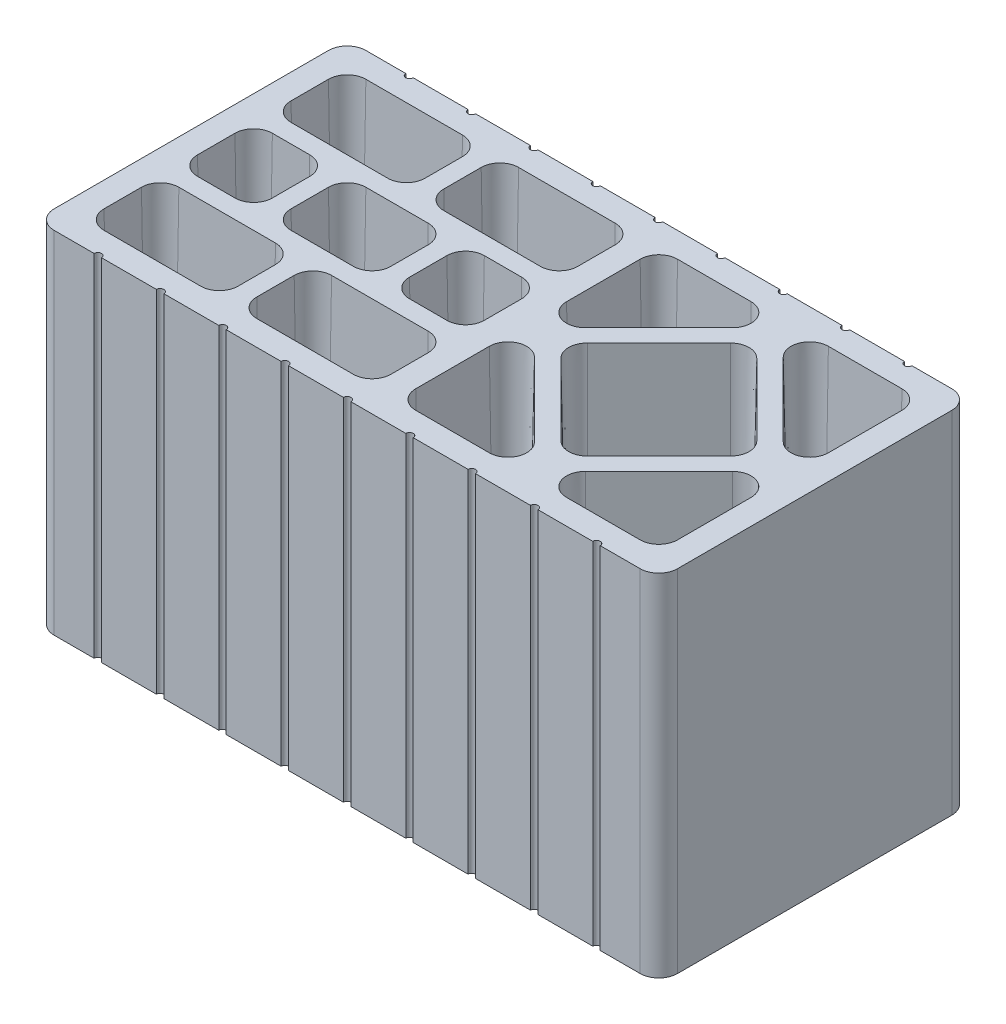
ISO-10303-21;
HEADER;
FILE_DESCRIPTION(('STEP AP214'),'2;1');
FILE_NAME('part.step','',(''),(''),'','','');
FILE_SCHEMA(('AUTOMOTIVE_DESIGN { 1 0 10303 214 1 1 1 1 }'));
ENDSEC;
DATA;
#1=APPLICATION_CONTEXT('core data for automotive mechanical design processes');
#2=APPLICATION_PROTOCOL_DEFINITION('international standard','automotive_design',2000,#1);
#3=PRODUCT_CONTEXT('',#1,'mechanical');
#4=PRODUCT('Part','Part','',(#3));
#5=PRODUCT_RELATED_PRODUCT_CATEGORY('part','',(#4));
#6=PRODUCT_DEFINITION_FORMATION('','',#4);
#7=PRODUCT_DEFINITION_CONTEXT('part definition',#1,'design');
#8=PRODUCT_DEFINITION('design','',#6,#7);
#9=PRODUCT_DEFINITION_SHAPE('','',#8);
#10=(LENGTH_UNIT() NAMED_UNIT(*) SI_UNIT(.MILLI.,.METRE.));
#11=(NAMED_UNIT(*) PLANE_ANGLE_UNIT() SI_UNIT($,.RADIAN.));
#12=(NAMED_UNIT(*) SI_UNIT($,.STERADIAN.) SOLID_ANGLE_UNIT());
#13=UNCERTAINTY_MEASURE_WITH_UNIT(LENGTH_MEASURE(1.E-05),#10,'distance_accuracy_value','');
#14=(GEOMETRIC_REPRESENTATION_CONTEXT(3) GLOBAL_UNCERTAINTY_ASSIGNED_CONTEXT((#13)) GLOBAL_UNIT_ASSIGNED_CONTEXT((#10,
#11,#12)) REPRESENTATION_CONTEXT('',''));
#15=CARTESIAN_POINT('',(0.,0.,0.));
#16=DIRECTION('',(0.,0.,1.));
#17=DIRECTION('',(1.,0.,0.));
#18=AXIS2_PLACEMENT_3D('',#15,#16,#17);
#19=CARTESIAN_POINT('',(40.,28.125,-25.));
#20=DIRECTION('',(0.,-1.,0.));
#21=DIRECTION('',(0.,0.,-1.));
#22=AXIS2_PLACEMENT_3D('',#19,#20,#21);
#23=PLANE('',#22);
#24=CARTESIAN_POINT('',(34.3994949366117,28.125,-3.5));
#25=DIRECTION('',(0.,1.,0.));
#26=DIRECTION('',(0.,0.,-1.));
#27=AXIS2_PLACEMENT_3D('',#24,#25,#26);
#28=CIRCLE('',#27,1.5);
#29=CARTESIAN_POINT('',(34.3994949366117,28.125,-2.));
#30=VERTEX_POINT('',#29);
#31=CARTESIAN_POINT('',(35.4601551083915,28.125,-4.56066017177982));
#32=VERTEX_POINT('',#31);
#33=EDGE_CURVE('E487',#30,#32,#28,.T.);
#34=ORIENTED_EDGE('',*,*,#33,.F.);
#35=DIRECTION('',(1.,0.,0.));
#36=VECTOR('',#35,1.);
#37=CARTESIAN_POINT('',(34.3994949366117,28.125,-2.));
#38=LINE('',#37,#36);
#39=CARTESIAN_POINT('',(28.5,28.125,-2.00000000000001));
#40=VERTEX_POINT('',#39);
#41=EDGE_CURVE('E503',#40,#30,#38,.T.);
#42=ORIENTED_EDGE('',*,*,#41,.F.);
#43=CARTESIAN_POINT('',(28.5,28.125,-3.50000000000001));
#44=DIRECTION('',(0.,1.,0.));
#45=DIRECTION('',(0.,0.,1.));
#46=AXIS2_PLACEMENT_3D('',#43,#44,#45);
#47=CIRCLE('',#46,1.5);
#48=CARTESIAN_POINT('',(27.,28.125,-3.50000000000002));
#49=VERTEX_POINT('',#48);
#50=EDGE_CURVE('E1454',#49,#40,#47,.T.);
#51=ORIENTED_EDGE('',*,*,#50,.F.);
#52=DIRECTION('',(0.,0.,1.));
#53=VECTOR('',#52,1.);
#54=CARTESIAN_POINT('',(27.,28.125,-9.39949493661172));
#55=LINE('',#54,#53);
#56=CARTESIAN_POINT('',(27.,28.125,-9.39949493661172));
#57=VERTEX_POINT('',#56);
#58=EDGE_CURVE('E1457',#57,#49,#55,.T.);
#59=ORIENTED_EDGE('',*,*,#58,.F.);
#60=CARTESIAN_POINT('',(28.5,28.125,-9.39949493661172));
#61=DIRECTION('',(0.,1.,0.));
#62=DIRECTION('',(0.,0.,-1.));
#63=AXIS2_PLACEMENT_3D('',#60,#61,#62);
#64=CIRCLE('',#63,1.5);
#65=CARTESIAN_POINT('',(29.5606601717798,28.125,-10.4601551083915));
#66=VERTEX_POINT('',#65);
#67=EDGE_CURVE('E1460',#66,#57,#64,.T.);
#68=ORIENTED_EDGE('',*,*,#67,.F.);
#69=DIRECTION('',(-0.707106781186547,0.,-0.707106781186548));
#70=VECTOR('',#69,1.);
#71=CARTESIAN_POINT('',(35.4601551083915,28.125,-4.56066017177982));
#72=LINE('',#71,#70);
#73=EDGE_CURVE('E1463',#32,#66,#72,.T.);
#74=ORIENTED_EDGE('',*,*,#73,.F.);
#75=EDGE_LOOP('',(#34,#42,#51,#59,#68,#74));
#76=FACE_BOUND('',#75,.T.);
#77=CARTESIAN_POINT('',(43.2365440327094,28.125,-12.5));
#78=DIRECTION('',(0.,1.,0.));
#79=DIRECTION('',(0.,0.,1.));
#80=AXIS2_PLACEMENT_3D('',#77,#78,#79);
#81=CIRCLE('',#80,1.5);
#82=CARTESIAN_POINT('',(44.2972042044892,28.125,-11.4393398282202));
#83=VERTEX_POINT('',#82);
#84=CARTESIAN_POINT('',(44.2972042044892,28.125,-13.5606601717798));
#85=VERTEX_POINT('',#84);
#86=EDGE_CURVE('E446',#83,#85,#81,.T.);
#87=ORIENTED_EDGE('',*,*,#86,.F.);
#88=DIRECTION('',(0.707106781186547,0.,-0.707106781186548));
#89=VECTOR('',#88,1.);
#90=CARTESIAN_POINT('',(38.5606601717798,28.125,-5.70279579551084));
#91=LINE('',#90,#89);
#92=CARTESIAN_POINT('',(38.5606601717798,28.125,-5.70279579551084));
#93=VERTEX_POINT('',#92);
#94=EDGE_CURVE('E470',#93,#83,#91,.T.);
#95=ORIENTED_EDGE('',*,*,#94,.F.);
#96=CARTESIAN_POINT('',(37.5,28.125,-6.76345596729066));
#97=DIRECTION('',(0.,1.,0.));
#98=DIRECTION('',(0.,0.,-1.));
#99=AXIS2_PLACEMENT_3D('',#96,#97,#98);
#100=CIRCLE('',#99,1.5);
#101=CARTESIAN_POINT('',(36.4393398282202,28.125,-5.70279579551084));
#102=VERTEX_POINT('',#101);
#103=EDGE_CURVE('E1416',#102,#93,#100,.T.);
#104=ORIENTED_EDGE('',*,*,#103,.F.);
#105=DIRECTION('',(0.707106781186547,0.,0.707106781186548));
#106=VECTOR('',#105,1.);
#107=CARTESIAN_POINT('',(36.4393398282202,28.125,-5.70279579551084));
#108=LINE('',#107,#106);
#109=CARTESIAN_POINT('',(30.7027957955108,28.125,-11.4393398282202));
#110=VERTEX_POINT('',#109);
#111=EDGE_CURVE('E1419',#110,#102,#108,.T.);
#112=ORIENTED_EDGE('',*,*,#111,.F.);
#113=CARTESIAN_POINT('',(31.7634559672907,28.125,-12.5));
#114=DIRECTION('',(0.,1.,0.));
#115=DIRECTION('',(0.,0.,-1.));
#116=AXIS2_PLACEMENT_3D('',#113,#114,#115);
#117=CIRCLE('',#116,1.5);
#118=CARTESIAN_POINT('',(30.7027957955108,28.125,-13.5606601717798));
#119=VERTEX_POINT('',#118);
#120=EDGE_CURVE('E1422',#119,#110,#117,.T.);
#121=ORIENTED_EDGE('',*,*,#120,.F.);
#122=DIRECTION('',(-0.707106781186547,0.,0.707106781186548));
#123=VECTOR('',#122,1.);
#124=CARTESIAN_POINT('',(36.4393398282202,28.125,-19.2972042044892));
#125=LINE('',#124,#123);
#126=CARTESIAN_POINT('',(36.4393398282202,28.125,-19.2972042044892));
#127=VERTEX_POINT('',#126);
#128=EDGE_CURVE('E1425',#127,#119,#125,.T.);
#129=ORIENTED_EDGE('',*,*,#128,.F.);
#130=CARTESIAN_POINT('',(37.5,28.125,-18.2365440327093));
#131=DIRECTION('',(0.,1.,0.));
#132=DIRECTION('',(0.,0.,-1.));
#133=AXIS2_PLACEMENT_3D('',#130,#131,#132);
#134=CIRCLE('',#133,1.5);
#135=CARTESIAN_POINT('',(38.5606601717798,28.125,-19.2972042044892));
#136=VERTEX_POINT('',#135);
#137=EDGE_CURVE('E1428',#136,#127,#134,.T.);
#138=ORIENTED_EDGE('',*,*,#137,.F.);
#139=DIRECTION('',(-0.707106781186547,0.,-0.707106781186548));
#140=VECTOR('',#139,1.);
#141=CARTESIAN_POINT('',(38.5606601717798,28.125,-19.2972042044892));
#142=LINE('',#141,#140);
#143=EDGE_CURVE('E1431',#85,#136,#142,.T.);
#144=ORIENTED_EDGE('',*,*,#143,.F.);
#145=EDGE_LOOP('',(#87,#95,#104,#112,#121,#129,#138,#144));
#146=FACE_BOUND('',#145,.T.);
#147=CARTESIAN_POINT('',(20.5,28.125,-14.));
#148=DIRECTION('',(0.,1.,0.));
#149=DIRECTION('',(0.,0.,1.));
#150=AXIS2_PLACEMENT_3D('',#147,#148,#149);
#151=CIRCLE('',#150,1.5);
#152=CARTESIAN_POINT('',(20.5,28.125,-15.5));
#153=VERTEX_POINT('',#152);
#154=CARTESIAN_POINT('',(19.,28.125,-14.));
#155=VERTEX_POINT('',#154);
#156=EDGE_CURVE('E562',#153,#155,#151,.T.);
#157=ORIENTED_EDGE('',*,*,#156,.F.);
#158=DIRECTION('',(-1.,0.,0.));
#159=VECTOR('',#158,1.);
#160=CARTESIAN_POINT('',(23.5,28.125,-15.5));
#161=LINE('',#160,#159);
#162=CARTESIAN_POINT('',(23.5,28.125,-15.5));
#163=VERTEX_POINT('',#162);
#164=EDGE_CURVE('E602',#163,#153,#161,.T.);
#165=ORIENTED_EDGE('',*,*,#164,.F.);
#166=CARTESIAN_POINT('',(23.5,28.125,-14.));
#167=DIRECTION('',(0.,1.,0.));
#168=DIRECTION('',(0.,0.,-1.));
#169=AXIS2_PLACEMENT_3D('',#166,#167,#168);
#170=CIRCLE('',#169,1.5);
#171=CARTESIAN_POINT('',(25.,28.125,-14.));
#172=VERTEX_POINT('',#171);
#173=EDGE_CURVE('E1372',#172,#163,#170,.T.);
#174=ORIENTED_EDGE('',*,*,#173,.F.);
#175=DIRECTION('',(0.,0.,-1.));
#176=VECTOR('',#175,1.);
#177=CARTESIAN_POINT('',(25.,28.125,-14.));
#178=LINE('',#177,#176);
#179=CARTESIAN_POINT('',(25.,28.125,-11.));
#180=VERTEX_POINT('',#179);
#181=EDGE_CURVE('E1375',#180,#172,#178,.T.);
#182=ORIENTED_EDGE('',*,*,#181,.F.);
#183=CARTESIAN_POINT('',(23.5,28.125,-11.));
#184=DIRECTION('',(0.,1.,0.));
#185=DIRECTION('',(0.,0.,1.));
#186=AXIS2_PLACEMENT_3D('',#183,#184,#185);
#187=CIRCLE('',#186,1.5);
#188=CARTESIAN_POINT('',(23.5,28.125,-9.5));
#189=VERTEX_POINT('',#188);
#190=EDGE_CURVE('E1378',#189,#180,#187,.T.);
#191=ORIENTED_EDGE('',*,*,#190,.F.);
#192=DIRECTION('',(1.,0.,0.));
#193=VECTOR('',#192,1.);
#194=CARTESIAN_POINT('',(23.5,28.125,-9.5));
#195=LINE('',#194,#193);
#196=CARTESIAN_POINT('',(20.5,28.125,-9.5));
#197=VERTEX_POINT('',#196);
#198=EDGE_CURVE('E1381',#197,#189,#195,.T.);
#199=ORIENTED_EDGE('',*,*,#198,.F.);
#200=CARTESIAN_POINT('',(20.5,28.125,-11.));
#201=DIRECTION('',(0.,1.,0.));
#202=DIRECTION('',(0.,0.,1.));
#203=AXIS2_PLACEMENT_3D('',#200,#201,#202);
#204=CIRCLE('',#203,1.5);
#205=CARTESIAN_POINT('',(19.,28.125,-11.));
#206=VERTEX_POINT('',#205);
#207=EDGE_CURVE('E1384',#206,#197,#204,.T.);
#208=ORIENTED_EDGE('',*,*,#207,.F.);
#209=DIRECTION('',(0.,0.,1.));
#210=VECTOR('',#209,1.);
#211=CARTESIAN_POINT('',(19.,28.125,-11.));
#212=LINE('',#211,#210);
#213=EDGE_CURVE('E1387',#155,#206,#212,.T.);
#214=ORIENTED_EDGE('',*,*,#213,.F.);
#215=EDGE_LOOP('',(#157,#165,#174,#182,#191,#199,#208,#214));
#216=FACE_BOUND('',#215,.T.);
#217=CARTESIAN_POINT('',(15.75,28.125,-21.5));
#218=DIRECTION('',(0.,1.,0.));
#219=DIRECTION('',(0.,0.,1.));
#220=AXIS2_PLACEMENT_3D('',#217,#218,#219);
#221=CIRCLE('',#220,1.5);
#222=CARTESIAN_POINT('',(15.75,28.125,-23.));
#223=VERTEX_POINT('',#222);
#224=CARTESIAN_POINT('',(14.25,28.125,-21.5));
#225=VERTEX_POINT('',#224);
#226=EDGE_CURVE('E626',#223,#225,#221,.T.);
#227=ORIENTED_EDGE('',*,*,#226,.F.);
#228=DIRECTION('',(-1.,0.,0.));
#229=VECTOR('',#228,1.);
#230=CARTESIAN_POINT('',(15.75,28.125,-23.));
#231=LINE('',#230,#229);
#232=CARTESIAN_POINT('',(23.5,28.125,-23.));
#233=VERTEX_POINT('',#232);
#234=EDGE_CURVE('E633',#233,#223,#231,.T.);
#235=ORIENTED_EDGE('',*,*,#234,.F.);
#236=CARTESIAN_POINT('',(23.5,28.125,-21.5));
#237=DIRECTION('',(0.,1.,0.));
#238=DIRECTION('',(0.,0.,1.));
#239=AXIS2_PLACEMENT_3D('',#236,#237,#238);
#240=CIRCLE('',#239,1.5);
#241=CARTESIAN_POINT('',(25.,28.125,-21.5));
#242=VERTEX_POINT('',#241);
#243=EDGE_CURVE('E1328',#242,#233,#240,.T.);
#244=ORIENTED_EDGE('',*,*,#243,.F.);
#245=DIRECTION('',(0.,0.,-1.));
#246=VECTOR('',#245,1.);
#247=CARTESIAN_POINT('',(25.,28.125,-18.5));
#248=LINE('',#247,#246);
#249=CARTESIAN_POINT('',(25.,28.125,-18.5));
#250=VERTEX_POINT('',#249);
#251=EDGE_CURVE('E1331',#250,#242,#248,.T.);
#252=ORIENTED_EDGE('',*,*,#251,.F.);
#253=CARTESIAN_POINT('',(23.5,28.125,-18.5));
#254=DIRECTION('',(0.,1.,0.));
#255=DIRECTION('',(0.,0.,-1.));
#256=AXIS2_PLACEMENT_3D('',#253,#254,#255);
#257=CIRCLE('',#256,1.5);
#258=CARTESIAN_POINT('',(23.5,28.125,-17.));
#259=VERTEX_POINT('',#258);
#260=EDGE_CURVE('E1334',#259,#250,#257,.T.);
#261=ORIENTED_EDGE('',*,*,#260,.F.);
#262=DIRECTION('',(1.,0.,0.));
#263=VECTOR('',#262,1.);
#264=CARTESIAN_POINT('',(15.75,28.125,-17.));
#265=LINE('',#264,#263);
#266=CARTESIAN_POINT('',(15.75,28.125,-17.));
#267=VERTEX_POINT('',#266);
#268=EDGE_CURVE('E1337',#267,#259,#265,.T.);
#269=ORIENTED_EDGE('',*,*,#268,.F.);
#270=CARTESIAN_POINT('',(15.75,28.125,-18.5));
#271=DIRECTION('',(0.,1.,0.));
#272=DIRECTION('',(0.,0.,1.));
#273=AXIS2_PLACEMENT_3D('',#270,#271,#272);
#274=CIRCLE('',#273,1.5);
#275=CARTESIAN_POINT('',(14.25,28.125,-18.5));
#276=VERTEX_POINT('',#275);
#277=EDGE_CURVE('E1340',#276,#267,#274,.T.);
#278=ORIENTED_EDGE('',*,*,#277,.F.);
#279=DIRECTION('',(0.,0.,1.));
#280=VECTOR('',#279,1.);
#281=CARTESIAN_POINT('',(14.25,28.125,-18.5));
#282=LINE('',#281,#280);
#283=EDGE_CURVE('E1343',#225,#276,#282,.T.);
#284=ORIENTED_EDGE('',*,*,#283,.F.);
#285=EDGE_LOOP('',(#227,#235,#244,#252,#261,#269,#278,#284));
#286=FACE_BOUND('',#285,.T.);
#287=CARTESIAN_POINT('',(3.5,28.125,-11.));
#288=DIRECTION('',(0.,1.,0.));
#289=DIRECTION('',(0.,0.,1.));
#290=AXIS2_PLACEMENT_3D('',#287,#288,#289);
#291=CIRCLE('',#290,1.5);
#292=CARTESIAN_POINT('',(2.,28.125,-11.));
#293=VERTEX_POINT('',#292);
#294=CARTESIAN_POINT('',(3.50000000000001,28.125,-9.5));
#295=VERTEX_POINT('',#294);
#296=EDGE_CURVE('E752',#293,#295,#291,.T.);
#297=ORIENTED_EDGE('',*,*,#296,.F.);
#298=DIRECTION('',(0.,0.,1.));
#299=VECTOR('',#298,1.);
#300=CARTESIAN_POINT('',(2.,28.125,-14.));
#301=LINE('',#300,#299);
#302=CARTESIAN_POINT('',(2.,28.125,-14.));
#303=VERTEX_POINT('',#302);
#304=EDGE_CURVE('E769',#303,#293,#301,.T.);
#305=ORIENTED_EDGE('',*,*,#304,.F.);
#306=CARTESIAN_POINT('',(3.5,28.125,-14.));
#307=DIRECTION('',(0.,1.,0.));
#308=DIRECTION('',(0.,0.,1.));
#309=AXIS2_PLACEMENT_3D('',#306,#307,#308);
#310=CIRCLE('',#309,1.5);
#311=CARTESIAN_POINT('',(3.50000000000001,28.125,-15.5));
#312=VERTEX_POINT('',#311);
#313=EDGE_CURVE('E1284',#312,#303,#310,.T.);
#314=ORIENTED_EDGE('',*,*,#313,.F.);
#315=DIRECTION('',(-1.,0.,0.));
#316=VECTOR('',#315,1.);
#317=CARTESIAN_POINT('',(3.50000000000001,28.125,-15.5));
#318=LINE('',#317,#316);
#319=CARTESIAN_POINT('',(6.49999999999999,28.125,-15.5));
#320=VERTEX_POINT('',#319);
#321=EDGE_CURVE('E1287',#320,#312,#318,.T.);
#322=ORIENTED_EDGE('',*,*,#321,.F.);
#323=CARTESIAN_POINT('',(6.5,28.125,-14.));
#324=DIRECTION('',(0.,1.,0.));
#325=DIRECTION('',(0.,0.,-1.));
#326=AXIS2_PLACEMENT_3D('',#323,#324,#325);
#327=CIRCLE('',#326,1.5);
#328=CARTESIAN_POINT('',(8.,28.125,-14.));
#329=VERTEX_POINT('',#328);
#330=EDGE_CURVE('E1290',#329,#320,#327,.T.);
#331=ORIENTED_EDGE('',*,*,#330,.F.);
#332=DIRECTION('',(0.,0.,-1.));
#333=VECTOR('',#332,1.);
#334=CARTESIAN_POINT('',(8.,28.125,-11.));
#335=LINE('',#334,#333);
#336=CARTESIAN_POINT('',(8.,28.125,-11.));
#337=VERTEX_POINT('',#336);
#338=EDGE_CURVE('E1293',#337,#329,#335,.T.);
#339=ORIENTED_EDGE('',*,*,#338,.F.);
#340=CARTESIAN_POINT('',(6.5,28.125,-11.));
#341=DIRECTION('',(0.,1.,0.));
#342=DIRECTION('',(0.,0.,1.));
#343=AXIS2_PLACEMENT_3D('',#340,#341,#342);
#344=CIRCLE('',#343,1.5);
#345=CARTESIAN_POINT('',(6.49999999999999,28.125,-9.5));
#346=VERTEX_POINT('',#345);
#347=EDGE_CURVE('E1296',#346,#337,#344,.T.);
#348=ORIENTED_EDGE('',*,*,#347,.F.);
#349=DIRECTION('',(1.,0.,0.));
#350=VECTOR('',#349,1.);
#351=CARTESIAN_POINT('',(3.50000000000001,28.125,-9.5));
#352=LINE('',#351,#350);
#353=EDGE_CURVE('E1299',#295,#346,#352,.T.);
#354=ORIENTED_EDGE('',*,*,#353,.F.);
#355=EDGE_LOOP('',(#297,#305,#314,#322,#331,#339,#348,#354));
#356=FACE_BOUND('',#355,.T.);
#357=CARTESIAN_POINT('',(46.5,28.125,-9.39949493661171));
#358=DIRECTION('',(0.,1.,0.));
#359=DIRECTION('',(0.,0.,1.));
#360=AXIS2_PLACEMENT_3D('',#357,#358,#359);
#361=CIRCLE('',#360,1.5);
#362=CARTESIAN_POINT('',(48.,28.125,-9.39949493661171));
#363=VERTEX_POINT('',#362);
#364=CARTESIAN_POINT('',(45.4393398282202,28.125,-10.4601551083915));
#365=VERTEX_POINT('',#364);
#366=EDGE_CURVE('E402',#363,#365,#361,.T.);
#367=ORIENTED_EDGE('',*,*,#366,.F.);
#368=DIRECTION('',(0.,0.,-1.));
#369=VECTOR('',#368,1.);
#370=CARTESIAN_POINT('',(48.,28.125,-9.39949493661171));
#371=LINE('',#370,#369);
#372=CARTESIAN_POINT('',(48.,28.125,-3.50000000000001));
#373=VERTEX_POINT('',#372);
#374=EDGE_CURVE('E434',#373,#363,#371,.T.);
#375=ORIENTED_EDGE('',*,*,#374,.F.);
#376=CARTESIAN_POINT('',(46.5,28.125,-3.5));
#377=DIRECTION('',(0.,1.,0.));
#378=DIRECTION('',(0.,0.,-1.));
#379=AXIS2_PLACEMENT_3D('',#376,#377,#378);
#380=CIRCLE('',#379,1.5);
#381=CARTESIAN_POINT('',(46.5,28.125,-2.));
#382=VERTEX_POINT('',#381);
#383=EDGE_CURVE('E1246',#382,#373,#380,.T.);
#384=ORIENTED_EDGE('',*,*,#383,.F.);
#385=DIRECTION('',(1.,0.,0.));
#386=VECTOR('',#385,1.);
#387=CARTESIAN_POINT('',(40.6005050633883,28.125,-2.));
#388=LINE('',#387,#386);
#389=CARTESIAN_POINT('',(40.6005050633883,28.125,-2.));
#390=VERTEX_POINT('',#389);
#391=EDGE_CURVE('E1249',#390,#382,#388,.T.);
#392=ORIENTED_EDGE('',*,*,#391,.F.);
#393=CARTESIAN_POINT('',(40.6005050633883,28.125,-3.5));
#394=DIRECTION('',(0.,1.,0.));
#395=DIRECTION('',(0.,0.,1.));
#396=AXIS2_PLACEMENT_3D('',#393,#394,#395);
#397=CIRCLE('',#396,1.5);
#398=CARTESIAN_POINT('',(39.5398448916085,28.125,-4.56066017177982));
#399=VERTEX_POINT('',#398);
#400=EDGE_CURVE('E1252',#399,#390,#397,.T.);
#401=ORIENTED_EDGE('',*,*,#400,.F.);
#402=DIRECTION('',(-0.707106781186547,0.,0.707106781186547));
#403=VECTOR('',#402,1.);
#404=CARTESIAN_POINT('',(39.5398448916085,28.125,-4.56066017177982));
#405=LINE('',#404,#403);
#406=EDGE_CURVE('E1255',#365,#399,#405,.T.);
#407=ORIENTED_EDGE('',*,*,#406,.F.);
#408=EDGE_LOOP('',(#367,#375,#384,#392,#401,#407));
#409=FACE_BOUND('',#408,.T.);
#410=CARTESIAN_POINT('',(40.,28.125,-25.));
#411=DIRECTION('',(0.,-1.,0.));
#412=DIRECTION('',(0.,0.,-1.));
#413=AXIS2_PLACEMENT_3D('',#410,#411,#412);
#414=CIRCLE('',#413,0.299999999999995);
#415=CARTESIAN_POINT('',(40.3,28.125,-25.));
#416=VERTEX_POINT('',#415);
#417=CARTESIAN_POINT('',(39.7,28.125,-25.));
#418=VERTEX_POINT('',#417);
#419=EDGE_CURVE('E985',#416,#418,#414,.T.);
#420=ORIENTED_EDGE('',*,*,#419,.T.);
#421=DIRECTION('',(-1.,0.,0.));
#422=VECTOR('',#421,1.);
#423=CARTESIAN_POINT('',(35.3,28.125,-25.));
#424=LINE('',#423,#422);
#425=CARTESIAN_POINT('',(35.3,28.125,-25.));
#426=VERTEX_POINT('',#425);
#427=EDGE_CURVE('E1239',#418,#426,#424,.T.);
#428=ORIENTED_EDGE('',*,*,#427,.T.);
#429=CARTESIAN_POINT('',(35.,28.125,-25.));
#430=DIRECTION('',(0.,-1.,0.));
#431=DIRECTION('',(0.,0.,-1.));
#432=AXIS2_PLACEMENT_3D('',#429,#430,#431);
#433=CIRCLE('',#432,0.299999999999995);
#434=CARTESIAN_POINT('',(34.7,28.125,-25.));
#435=VERTEX_POINT('',#434);
#436=EDGE_CURVE('E1236',#426,#435,#433,.T.);
#437=ORIENTED_EDGE('',*,*,#436,.T.);
#438=DIRECTION('',(-1.,0.,0.));
#439=VECTOR('',#438,1.);
#440=CARTESIAN_POINT('',(30.3,28.125,-25.));
#441=LINE('',#440,#439);
#442=CARTESIAN_POINT('',(30.3,28.125,-25.));
#443=VERTEX_POINT('',#442);
#444=EDGE_CURVE('E1233',#435,#443,#441,.T.);
#445=ORIENTED_EDGE('',*,*,#444,.T.);
#446=CARTESIAN_POINT('',(30.,28.125,-25.));
#447=DIRECTION('',(0.,-1.,0.));
#448=DIRECTION('',(0.,0.,-1.));
#449=AXIS2_PLACEMENT_3D('',#446,#447,#448);
#450=CIRCLE('',#449,0.299999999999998);
#451=CARTESIAN_POINT('',(29.7,28.125,-25.));
#452=VERTEX_POINT('',#451);
#453=EDGE_CURVE('E1230',#443,#452,#450,.T.);
#454=ORIENTED_EDGE('',*,*,#453,.T.);
#455=DIRECTION('',(-1.,0.,0.));
#456=VECTOR('',#455,1.);
#457=CARTESIAN_POINT('',(25.3,28.125,-25.));
#458=LINE('',#457,#456);
#459=CARTESIAN_POINT('',(25.3,28.125,-25.));
#460=VERTEX_POINT('',#459);
#461=EDGE_CURVE('E1227',#452,#460,#458,.T.);
#462=ORIENTED_EDGE('',*,*,#461,.T.);
#463=CARTESIAN_POINT('',(25.,28.125,-25.));
#464=DIRECTION('',(0.,-1.,0.));
#465=DIRECTION('',(0.,0.,-1.));
#466=AXIS2_PLACEMENT_3D('',#463,#464,#465);
#467=CIRCLE('',#466,0.299999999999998);
#468=CARTESIAN_POINT('',(24.7,28.125,-25.));
#469=VERTEX_POINT('',#468);
#470=EDGE_CURVE('E1224',#460,#469,#467,.T.);
#471=ORIENTED_EDGE('',*,*,#470,.T.);
#472=DIRECTION('',(-1.,0.,0.));
#473=VECTOR('',#472,1.);
#474=CARTESIAN_POINT('',(20.3,28.125,-25.));
#475=LINE('',#474,#473);
#476=CARTESIAN_POINT('',(20.3,28.125,-25.));
#477=VERTEX_POINT('',#476);
#478=EDGE_CURVE('E1221',#469,#477,#475,.T.);
#479=ORIENTED_EDGE('',*,*,#478,.T.);
#480=CARTESIAN_POINT('',(20.,28.125,-25.));
#481=DIRECTION('',(0.,-1.,0.));
#482=DIRECTION('',(0.,0.,-1.));
#483=AXIS2_PLACEMENT_3D('',#480,#481,#482);
#484=CIRCLE('',#483,0.299999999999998);
#485=CARTESIAN_POINT('',(19.7,28.125,-25.));
#486=VERTEX_POINT('',#485);
#487=EDGE_CURVE('E1218',#477,#486,#484,.T.);
#488=ORIENTED_EDGE('',*,*,#487,.T.);
#489=DIRECTION('',(-1.,0.,0.));
#490=VECTOR('',#489,1.);
#491=CARTESIAN_POINT('',(15.3,28.125,-25.));
#492=LINE('',#491,#490);
#493=CARTESIAN_POINT('',(15.3,28.125,-25.));
#494=VERTEX_POINT('',#493);
#495=EDGE_CURVE('E1215',#486,#494,#492,.T.);
#496=ORIENTED_EDGE('',*,*,#495,.T.);
#497=CARTESIAN_POINT('',(15.,28.125,-25.));
#498=DIRECTION('',(0.,-1.,0.));
#499=DIRECTION('',(0.,0.,-1.));
#500=AXIS2_PLACEMENT_3D('',#497,#498,#499);
#501=CIRCLE('',#500,0.3);
#502=CARTESIAN_POINT('',(14.7,28.125,-25.));
#503=VERTEX_POINT('',#502);
#504=EDGE_CURVE('E1212',#494,#503,#501,.T.);
#505=ORIENTED_EDGE('',*,*,#504,.T.);
#506=DIRECTION('',(-1.,0.,0.));
#507=VECTOR('',#506,1.);
#508=CARTESIAN_POINT('',(10.3,28.125,-25.));
#509=LINE('',#508,#507);
#510=CARTESIAN_POINT('',(10.3,28.125,-25.));
#511=VERTEX_POINT('',#510);
#512=EDGE_CURVE('E1209',#503,#511,#509,.T.);
#513=ORIENTED_EDGE('',*,*,#512,.T.);
#514=CARTESIAN_POINT('',(10.,28.125,-25.));
#515=DIRECTION('',(0.,-1.,0.));
#516=DIRECTION('',(0.,0.,-1.));
#517=AXIS2_PLACEMENT_3D('',#514,#515,#516);
#518=CIRCLE('',#517,0.3);
#519=CARTESIAN_POINT('',(9.7,28.125,-25.));
#520=VERTEX_POINT('',#519);
#521=EDGE_CURVE('E1206',#511,#520,#518,.T.);
#522=ORIENTED_EDGE('',*,*,#521,.T.);
#523=DIRECTION('',(-1.,0.,0.));
#524=VECTOR('',#523,1.);
#525=CARTESIAN_POINT('',(5.3,28.125,-25.));
#526=LINE('',#525,#524);
#527=CARTESIAN_POINT('',(5.3,28.125,-25.));
#528=VERTEX_POINT('',#527);
#529=EDGE_CURVE('E1203',#520,#528,#526,.T.);
#530=ORIENTED_EDGE('',*,*,#529,.T.);
#531=CARTESIAN_POINT('',(5.,28.125,-25.));
#532=DIRECTION('',(0.,-1.,0.));
#533=DIRECTION('',(0.,0.,-1.));
#534=AXIS2_PLACEMENT_3D('',#531,#532,#533);
#535=CIRCLE('',#534,0.3);
#536=CARTESIAN_POINT('',(4.7,28.125,-25.));
#537=VERTEX_POINT('',#536);
#538=EDGE_CURVE('E1200',#528,#537,#535,.T.);
#539=ORIENTED_EDGE('',*,*,#538,.T.);
#540=DIRECTION('',(-1.,0.,0.));
#541=VECTOR('',#540,1.);
#542=CARTESIAN_POINT('',(1.50000000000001,28.125,-25.));
#543=LINE('',#542,#541);
#544=CARTESIAN_POINT('',(1.50000000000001,28.125,-25.));
#545=VERTEX_POINT('',#544);
#546=EDGE_CURVE('E1197',#537,#545,#543,.T.);
#547=ORIENTED_EDGE('',*,*,#546,.T.);
#548=CARTESIAN_POINT('',(1.5,28.125,-23.5));
#549=DIRECTION('',(0.,1.,0.));
#550=DIRECTION('',(0.,0.,-1.));
#551=AXIS2_PLACEMENT_3D('',#548,#549,#550);
#552=CIRCLE('',#551,1.5);
#553=CARTESIAN_POINT('',(0.,28.125,-23.5));
#554=VERTEX_POINT('',#553);
#555=EDGE_CURVE('E1194',#545,#554,#552,.T.);
#556=ORIENTED_EDGE('',*,*,#555,.T.);
#557=DIRECTION('',(0.,0.,1.));
#558=VECTOR('',#557,1.);
#559=CARTESIAN_POINT('',(0.,28.125,-1.50000000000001));
#560=LINE('',#559,#558);
#561=CARTESIAN_POINT('',(0.,28.125,-1.50000000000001));
#562=VERTEX_POINT('',#561);
#563=EDGE_CURVE('E1191',#554,#562,#560,.T.);
#564=ORIENTED_EDGE('',*,*,#563,.T.);
#565=CARTESIAN_POINT('',(1.5,28.125,-1.5));
#566=DIRECTION('',(0.,1.,0.));
#567=DIRECTION('',(0.,0.,-1.));
#568=AXIS2_PLACEMENT_3D('',#565,#566,#567);
#569=CIRCLE('',#568,1.5);
#570=CARTESIAN_POINT('',(1.50000000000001,28.125,0.));
#571=VERTEX_POINT('',#570);
#572=EDGE_CURVE('E1188',#562,#571,#569,.T.);
#573=ORIENTED_EDGE('',*,*,#572,.T.);
#574=DIRECTION('',(1.,0.,0.));
#575=VECTOR('',#574,1.);
#576=CARTESIAN_POINT('',(1.50000000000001,28.125,0.));
#577=LINE('',#576,#575);
#578=CARTESIAN_POINT('',(4.7,28.125,0.));
#579=VERTEX_POINT('',#578);
#580=EDGE_CURVE('E1185',#571,#579,#577,.T.);
#581=ORIENTED_EDGE('',*,*,#580,.T.);
#582=CARTESIAN_POINT('',(5.,28.125,0.));
#583=DIRECTION('',(0.,-1.,0.));
#584=DIRECTION('',(0.,0.,1.));
#585=AXIS2_PLACEMENT_3D('',#582,#583,#584);
#586=CIRCLE('',#585,0.3);
#587=CARTESIAN_POINT('',(5.3,28.125,0.));
#588=VERTEX_POINT('',#587);
#589=EDGE_CURVE('E1182',#579,#588,#586,.T.);
#590=ORIENTED_EDGE('',*,*,#589,.T.);
#591=DIRECTION('',(1.,0.,0.));
#592=VECTOR('',#591,1.);
#593=CARTESIAN_POINT('',(5.3,28.125,0.));
#594=LINE('',#593,#592);
#595=CARTESIAN_POINT('',(9.7,28.125,0.));
#596=VERTEX_POINT('',#595);
#597=EDGE_CURVE('E1179',#588,#596,#594,.T.);
#598=ORIENTED_EDGE('',*,*,#597,.T.);
#599=CARTESIAN_POINT('',(10.,28.125,0.));
#600=DIRECTION('',(0.,-1.,0.));
#601=DIRECTION('',(0.,0.,1.));
#602=AXIS2_PLACEMENT_3D('',#599,#600,#601);
#603=CIRCLE('',#602,0.3);
#604=CARTESIAN_POINT('',(10.3,28.125,0.));
#605=VERTEX_POINT('',#604);
#606=EDGE_CURVE('E1176',#596,#605,#603,.T.);
#607=ORIENTED_EDGE('',*,*,#606,.T.);
#608=DIRECTION('',(1.,0.,0.));
#609=VECTOR('',#608,1.);
#610=CARTESIAN_POINT('',(10.3,28.125,0.));
#611=LINE('',#610,#609);
#612=CARTESIAN_POINT('',(14.7,28.125,0.));
#613=VERTEX_POINT('',#612);
#614=EDGE_CURVE('E1173',#605,#613,#611,.T.);
#615=ORIENTED_EDGE('',*,*,#614,.T.);
#616=CARTESIAN_POINT('',(15.,28.125,0.));
#617=DIRECTION('',(0.,-1.,0.));
#618=DIRECTION('',(0.,0.,1.));
#619=AXIS2_PLACEMENT_3D('',#616,#617,#618);
#620=CIRCLE('',#619,0.3);
#621=CARTESIAN_POINT('',(15.3,28.125,0.));
#622=VERTEX_POINT('',#621);
#623=EDGE_CURVE('E1170',#613,#622,#620,.T.);
#624=ORIENTED_EDGE('',*,*,#623,.T.);
#625=DIRECTION('',(1.,0.,0.));
#626=VECTOR('',#625,1.);
#627=CARTESIAN_POINT('',(15.3,28.125,0.));
#628=LINE('',#627,#626);
#629=CARTESIAN_POINT('',(19.7,28.125,0.));
#630=VERTEX_POINT('',#629);
#631=EDGE_CURVE('E1167',#622,#630,#628,.T.);
#632=ORIENTED_EDGE('',*,*,#631,.T.);
#633=CARTESIAN_POINT('',(20.,28.125,0.));
#634=DIRECTION('',(0.,-1.,0.));
#635=DIRECTION('',(0.,0.,1.));
#636=AXIS2_PLACEMENT_3D('',#633,#634,#635);
#637=CIRCLE('',#636,0.300000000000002);
#638=CARTESIAN_POINT('',(20.3,28.125,0.));
#639=VERTEX_POINT('',#638);
#640=EDGE_CURVE('E1164',#630,#639,#637,.T.);
#641=ORIENTED_EDGE('',*,*,#640,.T.);
#642=DIRECTION('',(1.,0.,0.));
#643=VECTOR('',#642,1.);
#644=CARTESIAN_POINT('',(20.3,28.125,0.));
#645=LINE('',#644,#643);
#646=CARTESIAN_POINT('',(24.7,28.125,0.));
#647=VERTEX_POINT('',#646);
#648=EDGE_CURVE('E1161',#639,#647,#645,.T.);
#649=ORIENTED_EDGE('',*,*,#648,.T.);
#650=CARTESIAN_POINT('',(25.,28.125,0.));
#651=DIRECTION('',(0.,-1.,0.));
#652=DIRECTION('',(0.,0.,1.));
#653=AXIS2_PLACEMENT_3D('',#650,#651,#652);
#654=CIRCLE('',#653,0.300000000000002);
#655=CARTESIAN_POINT('',(25.3,28.125,0.));
#656=VERTEX_POINT('',#655);
#657=EDGE_CURVE('E1158',#647,#656,#654,.T.);
#658=ORIENTED_EDGE('',*,*,#657,.T.);
#659=DIRECTION('',(1.,0.,0.));
#660=VECTOR('',#659,1.);
#661=CARTESIAN_POINT('',(25.3,28.125,0.));
#662=LINE('',#661,#660);
#663=CARTESIAN_POINT('',(29.7,28.125,0.));
#664=VERTEX_POINT('',#663);
#665=EDGE_CURVE('E1155',#656,#664,#662,.T.);
#666=ORIENTED_EDGE('',*,*,#665,.T.);
#667=CARTESIAN_POINT('',(30.,28.125,0.));
#668=DIRECTION('',(0.,-1.,0.));
#669=DIRECTION('',(0.,0.,1.));
#670=AXIS2_PLACEMENT_3D('',#667,#668,#669);
#671=CIRCLE('',#670,0.300000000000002);
#672=CARTESIAN_POINT('',(30.3,28.125,0.));
#673=VERTEX_POINT('',#672);
#674=EDGE_CURVE('E1152',#664,#673,#671,.T.);
#675=ORIENTED_EDGE('',*,*,#674,.T.);
#676=DIRECTION('',(1.,0.,0.));
#677=VECTOR('',#676,1.);
#678=CARTESIAN_POINT('',(30.3,28.125,0.));
#679=LINE('',#678,#677);
#680=CARTESIAN_POINT('',(34.7,28.125,0.));
#681=VERTEX_POINT('',#680);
#682=EDGE_CURVE('E1149',#673,#681,#679,.T.);
#683=ORIENTED_EDGE('',*,*,#682,.T.);
#684=CARTESIAN_POINT('',(35.,28.125,0.));
#685=DIRECTION('',(0.,-1.,0.));
#686=DIRECTION('',(0.,0.,1.));
#687=AXIS2_PLACEMENT_3D('',#684,#685,#686);
#688=CIRCLE('',#687,0.299999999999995);
#689=CARTESIAN_POINT('',(35.3,28.125,0.));
#690=VERTEX_POINT('',#689);
#691=EDGE_CURVE('E1146',#681,#690,#688,.T.);
#692=ORIENTED_EDGE('',*,*,#691,.T.);
#693=DIRECTION('',(1.,0.,0.));
#694=VECTOR('',#693,1.);
#695=CARTESIAN_POINT('',(35.3,28.125,0.));
#696=LINE('',#695,#694);
#697=CARTESIAN_POINT('',(39.7,28.125,0.));
#698=VERTEX_POINT('',#697);
#699=EDGE_CURVE('E1143',#690,#698,#696,.T.);
#700=ORIENTED_EDGE('',*,*,#699,.T.);
#701=CARTESIAN_POINT('',(40.,28.125,0.));
#702=DIRECTION('',(0.,-1.,0.));
#703=DIRECTION('',(0.,0.,1.));
#704=AXIS2_PLACEMENT_3D('',#701,#702,#703);
#705=CIRCLE('',#704,0.299999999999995);
#706=CARTESIAN_POINT('',(40.3,28.125,0.));
#707=VERTEX_POINT('',#706);
#708=EDGE_CURVE('E1140',#698,#707,#705,.T.);
#709=ORIENTED_EDGE('',*,*,#708,.T.);
#710=DIRECTION('',(1.,0.,0.));
#711=VECTOR('',#710,1.);
#712=CARTESIAN_POINT('',(40.3,28.125,0.));
#713=LINE('',#712,#711);
#714=CARTESIAN_POINT('',(44.7,28.125,0.));
#715=VERTEX_POINT('',#714);
#716=EDGE_CURVE('E1137',#707,#715,#713,.T.);
#717=ORIENTED_EDGE('',*,*,#716,.T.);
#718=CARTESIAN_POINT('',(45.,28.125,0.));
#719=DIRECTION('',(0.,-1.,0.));
#720=DIRECTION('',(0.,0.,1.));
#721=AXIS2_PLACEMENT_3D('',#718,#719,#720);
#722=CIRCLE('',#721,0.299999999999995);
#723=CARTESIAN_POINT('',(45.3,28.125,0.));
#724=VERTEX_POINT('',#723);
#725=EDGE_CURVE('E1134',#715,#724,#722,.T.);
#726=ORIENTED_EDGE('',*,*,#725,.T.);
#727=DIRECTION('',(1.,0.,0.));
#728=VECTOR('',#727,1.);
#729=CARTESIAN_POINT('',(45.3,28.125,0.));
#730=LINE('',#729,#728);
#731=CARTESIAN_POINT('',(48.5,28.125,0.));
#732=VERTEX_POINT('',#731);
#733=EDGE_CURVE('E1131',#724,#732,#730,.T.);
#734=ORIENTED_EDGE('',*,*,#733,.T.);
#735=CARTESIAN_POINT('',(48.5,28.125,-1.5));
#736=DIRECTION('',(0.,1.,0.));
#737=DIRECTION('',(0.,0.,1.));
#738=AXIS2_PLACEMENT_3D('',#735,#736,#737);
#739=CIRCLE('',#738,1.5);
#740=CARTESIAN_POINT('',(50.,28.125,-1.50000000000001));
#741=VERTEX_POINT('',#740);
#742=EDGE_CURVE('E1128',#732,#741,#739,.T.);
#743=ORIENTED_EDGE('',*,*,#742,.T.);
#744=DIRECTION('',(0.,0.,-1.));
#745=VECTOR('',#744,1.);
#746=CARTESIAN_POINT('',(50.,28.125,-1.50000000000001));
#747=LINE('',#746,#745);
#748=CARTESIAN_POINT('',(50.,28.125,-23.5));
#749=VERTEX_POINT('',#748);
#750=EDGE_CURVE('E1125',#741,#749,#747,.T.);
#751=ORIENTED_EDGE('',*,*,#750,.T.);
#752=CARTESIAN_POINT('',(48.5,28.125,-23.5));
#753=DIRECTION('',(0.,1.,0.));
#754=DIRECTION('',(0.,0.,-1.));
#755=AXIS2_PLACEMENT_3D('',#752,#753,#754);
#756=CIRCLE('',#755,1.5);
#757=CARTESIAN_POINT('',(48.5,28.125,-25.));
#758=VERTEX_POINT('',#757);
#759=EDGE_CURVE('E1122',#749,#758,#756,.T.);
#760=ORIENTED_EDGE('',*,*,#759,.T.);
#761=DIRECTION('',(-1.,0.,0.));
#762=VECTOR('',#761,1.);
#763=CARTESIAN_POINT('',(45.3,28.125,-25.));
#764=LINE('',#763,#762);
#765=CARTESIAN_POINT('',(45.3,28.125,-25.));
#766=VERTEX_POINT('',#765);
#767=EDGE_CURVE('E1119',#758,#766,#764,.T.);
#768=ORIENTED_EDGE('',*,*,#767,.T.);
#769=CARTESIAN_POINT('',(45.,28.125,-25.));
#770=DIRECTION('',(0.,-1.,0.));
#771=DIRECTION('',(0.,0.,-1.));
#772=AXIS2_PLACEMENT_3D('',#769,#770,#771);
#773=CIRCLE('',#772,0.299999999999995);
#774=CARTESIAN_POINT('',(44.7,28.125,-25.));
#775=VERTEX_POINT('',#774);
#776=EDGE_CURVE('E1116',#766,#775,#773,.T.);
#777=ORIENTED_EDGE('',*,*,#776,.T.);
#778=DIRECTION('',(-1.,0.,0.));
#779=VECTOR('',#778,1.);
#780=CARTESIAN_POINT('',(40.3,28.125,-25.));
#781=LINE('',#780,#779);
#782=EDGE_CURVE('E981',#775,#416,#781,.T.);
#783=ORIENTED_EDGE('',*,*,#782,.T.);
#784=EDGE_LOOP('',(#420,#428,#437,#445,#454,#462,#471,#479,#488,#496,#505,#513,#522,#530,#539,
#547,#556,#564,#573,#581,#590,#598,#607,#615,#624,#632,#641,#649,#658,#666,#675,#683,#692,#700,
#709,#717,#726,#734,#743,#751,#760,#768,#777,#783));
#785=FACE_BOUND('',#784,.T.);
#786=CARTESIAN_POINT('',(3.5,28.125,-3.5));
#787=DIRECTION('',(0.,1.,0.));
#788=DIRECTION('',(0.,0.,1.));
#789=AXIS2_PLACEMENT_3D('',#786,#787,#788);
#790=CIRCLE('',#789,1.5);
#791=CARTESIAN_POINT('',(2.,28.125,-3.50000000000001));
#792=VERTEX_POINT('',#791);
#793=CARTESIAN_POINT('',(3.50000000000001,28.125,-2.));
#794=VERTEX_POINT('',#793);
#795=EDGE_CURVE('E708',#792,#794,#790,.T.);
#796=ORIENTED_EDGE('',*,*,#795,.F.);
#797=DIRECTION('',(0.,0.,1.));
#798=VECTOR('',#797,1.);
#799=CARTESIAN_POINT('',(2.,28.125,-6.49999999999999));
#800=LINE('',#799,#798);
#801=CARTESIAN_POINT('',(2.,28.125,-6.49999999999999));
#802=VERTEX_POINT('',#801);
#803=EDGE_CURVE('E725',#802,#792,#800,.T.);
#804=ORIENTED_EDGE('',*,*,#803,.F.);
#805=CARTESIAN_POINT('',(3.5,28.125,-6.5));
#806=DIRECTION('',(0.,1.,0.));
#807=DIRECTION('',(0.,0.,1.));
#808=AXIS2_PLACEMENT_3D('',#805,#806,#807);
#809=CIRCLE('',#808,1.5);
#810=CARTESIAN_POINT('',(3.50000000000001,28.125,-8.));
#811=VERTEX_POINT('',#810);
#812=EDGE_CURVE('E1262',#811,#802,#809,.T.);
#813=ORIENTED_EDGE('',*,*,#812,.F.);
#814=DIRECTION('',(-1.,0.,0.));
#815=VECTOR('',#814,1.);
#816=CARTESIAN_POINT('',(3.50000000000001,28.125,-8.));
#817=LINE('',#816,#815);
#818=CARTESIAN_POINT('',(11.25,28.125,-8.));
#819=VERTEX_POINT('',#818);
#820=EDGE_CURVE('E1265',#819,#811,#817,.T.);
#821=ORIENTED_EDGE('',*,*,#820,.F.);
#822=CARTESIAN_POINT('',(11.25,28.125,-6.5));
#823=DIRECTION('',(0.,1.,0.));
#824=DIRECTION('',(0.,0.,-1.));
#825=AXIS2_PLACEMENT_3D('',#822,#823,#824);
#826=CIRCLE('',#825,1.5);
#827=CARTESIAN_POINT('',(12.75,28.125,-6.49999999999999));
#828=VERTEX_POINT('',#827);
#829=EDGE_CURVE('E1268',#828,#819,#826,.T.);
#830=ORIENTED_EDGE('',*,*,#829,.F.);
#831=DIRECTION('',(0.,0.,-1.));
#832=VECTOR('',#831,1.);
#833=CARTESIAN_POINT('',(12.75,28.125,-6.49999999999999));
#834=LINE('',#833,#832);
#835=CARTESIAN_POINT('',(12.75,28.125,-3.50000000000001));
#836=VERTEX_POINT('',#835);
#837=EDGE_CURVE('E1271',#836,#828,#834,.T.);
#838=ORIENTED_EDGE('',*,*,#837,.F.);
#839=CARTESIAN_POINT('',(11.25,28.125,-3.5));
#840=DIRECTION('',(0.,1.,0.));
#841=DIRECTION('',(0.,0.,1.));
#842=AXIS2_PLACEMENT_3D('',#839,#840,#841);
#843=CIRCLE('',#842,1.5);
#844=CARTESIAN_POINT('',(11.25,28.125,-2.));
#845=VERTEX_POINT('',#844);
#846=EDGE_CURVE('E1274',#845,#836,#843,.T.);
#847=ORIENTED_EDGE('',*,*,#846,.F.);
#848=DIRECTION('',(1.,0.,0.));
#849=VECTOR('',#848,1.);
#850=CARTESIAN_POINT('',(3.50000000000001,28.125,-2.));
#851=LINE('',#850,#849);
#852=EDGE_CURVE('E1277',#794,#845,#851,.T.);
#853=ORIENTED_EDGE('',*,*,#852,.F.);
#854=EDGE_LOOP('',(#796,#804,#813,#821,#830,#838,#847,#853));
#855=FACE_BOUND('',#854,.T.);
#856=CARTESIAN_POINT('',(3.5,28.125,-18.5));
#857=DIRECTION('',(0.,1.,0.));
#858=DIRECTION('',(0.,0.,1.));
#859=AXIS2_PLACEMENT_3D('',#856,#857,#858);
#860=CIRCLE('',#859,1.5);
#861=CARTESIAN_POINT('',(2.,28.125,-18.5));
#862=VERTEX_POINT('',#861);
#863=CARTESIAN_POINT('',(3.50000000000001,28.125,-17.));
#864=VERTEX_POINT('',#863);
#865=EDGE_CURVE('E794',#862,#864,#860,.T.);
#866=ORIENTED_EDGE('',*,*,#865,.F.);
#867=DIRECTION('',(0.,0.,1.));
#868=VECTOR('',#867,1.);
#869=CARTESIAN_POINT('',(2.,28.125,-18.5));
#870=LINE('',#869,#868);
#871=CARTESIAN_POINT('',(2.,28.125,-21.5));
#872=VERTEX_POINT('',#871);
#873=EDGE_CURVE('E814',#872,#862,#870,.T.);
#874=ORIENTED_EDGE('',*,*,#873,.F.);
#875=CARTESIAN_POINT('',(3.5,28.125,-21.5));
#876=DIRECTION('',(0.,1.,0.));
#877=DIRECTION('',(0.,0.,1.));
#878=AXIS2_PLACEMENT_3D('',#875,#876,#877);
#879=CIRCLE('',#878,1.5);
#880=CARTESIAN_POINT('',(3.50000000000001,28.125,-23.));
#881=VERTEX_POINT('',#880);
#882=EDGE_CURVE('E1306',#881,#872,#879,.T.);
#883=ORIENTED_EDGE('',*,*,#882,.F.);
#884=DIRECTION('',(-1.,0.,0.));
#885=VECTOR('',#884,1.);
#886=CARTESIAN_POINT('',(3.50000000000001,28.125,-23.));
#887=LINE('',#886,#885);
#888=CARTESIAN_POINT('',(11.25,28.125,-23.));
#889=VERTEX_POINT('',#888);
#890=EDGE_CURVE('E1309',#889,#881,#887,.T.);
#891=ORIENTED_EDGE('',*,*,#890,.F.);
#892=CARTESIAN_POINT('',(11.25,28.125,-21.5));
#893=DIRECTION('',(0.,1.,0.));
#894=DIRECTION('',(0.,0.,1.));
#895=AXIS2_PLACEMENT_3D('',#892,#893,#894);
#896=CIRCLE('',#895,1.5);
#897=CARTESIAN_POINT('',(12.75,28.125,-21.5));
#898=VERTEX_POINT('',#897);
#899=EDGE_CURVE('E1312',#898,#889,#896,.T.);
#900=ORIENTED_EDGE('',*,*,#899,.F.);
#901=DIRECTION('',(0.,0.,-1.));
#902=VECTOR('',#901,1.);
#903=CARTESIAN_POINT('',(12.75,28.125,-18.5));
#904=LINE('',#903,#902);
#905=CARTESIAN_POINT('',(12.75,28.125,-18.5));
#906=VERTEX_POINT('',#905);
#907=EDGE_CURVE('E1315',#906,#898,#904,.T.);
#908=ORIENTED_EDGE('',*,*,#907,.F.);
#909=CARTESIAN_POINT('',(11.25,28.125,-18.5));
#910=DIRECTION('',(0.,1.,0.));
#911=DIRECTION('',(0.,0.,-1.));
#912=AXIS2_PLACEMENT_3D('',#909,#910,#911);
#913=CIRCLE('',#912,1.5);
#914=CARTESIAN_POINT('',(11.25,28.125,-17.));
#915=VERTEX_POINT('',#914);
#916=EDGE_CURVE('E1318',#915,#906,#913,.T.);
#917=ORIENTED_EDGE('',*,*,#916,.F.);
#918=DIRECTION('',(1.,0.,0.));
#919=VECTOR('',#918,1.);
#920=CARTESIAN_POINT('',(3.50000000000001,28.125,-17.));
#921=LINE('',#920,#919);
#922=EDGE_CURVE('E1321',#864,#915,#921,.T.);
#923=ORIENTED_EDGE('',*,*,#922,.F.);
#924=EDGE_LOOP('',(#866,#874,#883,#891,#900,#908,#917,#923));
#925=FACE_BOUND('',#924,.T.);
#926=CARTESIAN_POINT('',(11.,28.125,-14.));
#927=DIRECTION('',(0.,1.,0.));
#928=DIRECTION('',(0.,0.,1.));
#929=AXIS2_PLACEMENT_3D('',#926,#927,#928);
#930=CIRCLE('',#929,1.5);
#931=CARTESIAN_POINT('',(11.,28.125,-15.5));
#932=VERTEX_POINT('',#931);
#933=CARTESIAN_POINT('',(9.5,28.125,-14.));
#934=VERTEX_POINT('',#933);
#935=EDGE_CURVE('E670',#932,#934,#930,.T.);
#936=ORIENTED_EDGE('',*,*,#935,.F.);
#937=DIRECTION('',(-1.,0.,0.));
#938=VECTOR('',#937,1.);
#939=CARTESIAN_POINT('',(11.,28.125,-15.5));
#940=LINE('',#939,#938);
#941=CARTESIAN_POINT('',(16.,28.125,-15.5));
#942=VERTEX_POINT('',#941);
#943=EDGE_CURVE('E677',#942,#932,#940,.T.);
#944=ORIENTED_EDGE('',*,*,#943,.F.);
#945=CARTESIAN_POINT('',(16.,28.125,-14.));
#946=DIRECTION('',(0.,1.,0.));
#947=DIRECTION('',(0.,0.,-1.));
#948=AXIS2_PLACEMENT_3D('',#945,#946,#947);
#949=CIRCLE('',#948,1.5);
#950=CARTESIAN_POINT('',(17.5,28.125,-14.));
#951=VERTEX_POINT('',#950);
#952=EDGE_CURVE('E1350',#951,#942,#949,.T.);
#953=ORIENTED_EDGE('',*,*,#952,.F.);
#954=DIRECTION('',(0.,0.,-1.));
#955=VECTOR('',#954,1.);
#956=CARTESIAN_POINT('',(17.5,28.125,-14.));
#957=LINE('',#956,#955);
#958=CARTESIAN_POINT('',(17.5,28.125,-11.));
#959=VERTEX_POINT('',#958);
#960=EDGE_CURVE('E1353',#959,#951,#957,.T.);
#961=ORIENTED_EDGE('',*,*,#960,.F.);
#962=CARTESIAN_POINT('',(16.,28.125,-11.));
#963=DIRECTION('',(0.,1.,0.));
#964=DIRECTION('',(0.,0.,-1.));
#965=AXIS2_PLACEMENT_3D('',#962,#963,#964);
#966=CIRCLE('',#965,1.5);
#967=CARTESIAN_POINT('',(16.,28.125,-9.5));
#968=VERTEX_POINT('',#967);
#969=EDGE_CURVE('E1356',#968,#959,#966,.T.);
#970=ORIENTED_EDGE('',*,*,#969,.F.);
#971=DIRECTION('',(1.,0.,0.));
#972=VECTOR('',#971,1.);
#973=CARTESIAN_POINT('',(11.,28.125,-9.5));
#974=LINE('',#973,#972);
#975=CARTESIAN_POINT('',(11.,28.125,-9.5));
#976=VERTEX_POINT('',#975);
#977=EDGE_CURVE('E1359',#976,#968,#974,.T.);
#978=ORIENTED_EDGE('',*,*,#977,.F.);
#979=CARTESIAN_POINT('',(11.,28.125,-11.));
#980=DIRECTION('',(0.,1.,0.));
#981=DIRECTION('',(0.,0.,1.));
#982=AXIS2_PLACEMENT_3D('',#979,#980,#981);
#983=CIRCLE('',#982,1.5);
#984=CARTESIAN_POINT('',(9.5,28.125,-11.));
#985=VERTEX_POINT('',#984);
#986=EDGE_CURVE('E1362',#985,#976,#983,.T.);
#987=ORIENTED_EDGE('',*,*,#986,.F.);
#988=DIRECTION('',(0.,0.,1.));
#989=VECTOR('',#988,1.);
#990=CARTESIAN_POINT('',(9.5,28.125,-14.));
#991=LINE('',#990,#989);
#992=EDGE_CURVE('E1365',#934,#985,#991,.T.);
#993=ORIENTED_EDGE('',*,*,#992,.F.);
#994=EDGE_LOOP('',(#936,#944,#953,#961,#970,#978,#987,#993));
#995=FACE_BOUND('',#994,.T.);
#996=CARTESIAN_POINT('',(15.75,28.125,-3.5));
#997=DIRECTION('',(0.,1.,0.));
#998=DIRECTION('',(0.,0.,1.));
#999=AXIS2_PLACEMENT_3D('',#996,#997,#998);
#1000=CIRCLE('',#999,1.5);
#1001=CARTESIAN_POINT('',(14.25,28.125,-3.50000000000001));
#1002=VERTEX_POINT('',#1001);
#1003=CARTESIAN_POINT('',(15.75,28.125,-2.));
#1004=VERTEX_POINT('',#1003);
#1005=EDGE_CURVE('E530',#1002,#1004,#1000,.T.);
#1006=ORIENTED_EDGE('',*,*,#1005,.F.);
#1007=DIRECTION('',(0.,0.,1.));
#1008=VECTOR('',#1007,1.);
#1009=CARTESIAN_POINT('',(14.25,28.125,-6.49999999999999));
#1010=LINE('',#1009,#1008);
#1011=CARTESIAN_POINT('',(14.25,28.125,-6.49999999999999));
#1012=VERTEX_POINT('',#1011);
#1013=EDGE_CURVE('E547',#1012,#1002,#1010,.T.);
#1014=ORIENTED_EDGE('',*,*,#1013,.F.);
#1015=CARTESIAN_POINT('',(15.75,28.125,-6.5));
#1016=DIRECTION('',(0.,1.,0.));
#1017=DIRECTION('',(0.,0.,1.));
#1018=AXIS2_PLACEMENT_3D('',#1015,#1016,#1017);
#1019=CIRCLE('',#1018,1.5);
#1020=CARTESIAN_POINT('',(15.75,28.125,-8.));
#1021=VERTEX_POINT('',#1020);
#1022=EDGE_CURVE('E1394',#1021,#1012,#1019,.T.);
#1023=ORIENTED_EDGE('',*,*,#1022,.F.);
#1024=DIRECTION('',(-1.,0.,0.));
#1025=VECTOR('',#1024,1.);
#1026=CARTESIAN_POINT('',(15.75,28.125,-8.));
#1027=LINE('',#1026,#1025);
#1028=CARTESIAN_POINT('',(23.5,28.125,-8.));
#1029=VERTEX_POINT('',#1028);
#1030=EDGE_CURVE('E1397',#1029,#1021,#1027,.T.);
#1031=ORIENTED_EDGE('',*,*,#1030,.F.);
#1032=CARTESIAN_POINT('',(23.5,28.125,-6.5));
#1033=DIRECTION('',(0.,1.,0.));
#1034=DIRECTION('',(0.,0.,-1.));
#1035=AXIS2_PLACEMENT_3D('',#1032,#1033,#1034);
#1036=CIRCLE('',#1035,1.5);
#1037=CARTESIAN_POINT('',(25.,28.125,-6.49999999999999));
#1038=VERTEX_POINT('',#1037);
#1039=EDGE_CURVE('E1400',#1038,#1029,#1036,.T.);
#1040=ORIENTED_EDGE('',*,*,#1039,.F.);
#1041=DIRECTION('',(0.,0.,-1.));
#1042=VECTOR('',#1041,1.);
#1043=CARTESIAN_POINT('',(25.,28.125,-6.49999999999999));
#1044=LINE('',#1043,#1042);
#1045=CARTESIAN_POINT('',(25.,28.125,-3.50000000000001));
#1046=VERTEX_POINT('',#1045);
#1047=EDGE_CURVE('E1403',#1046,#1038,#1044,.T.);
#1048=ORIENTED_EDGE('',*,*,#1047,.F.);
#1049=CARTESIAN_POINT('',(23.5,28.125,-3.5));
#1050=DIRECTION('',(0.,1.,0.));
#1051=DIRECTION('',(0.,0.,1.));
#1052=AXIS2_PLACEMENT_3D('',#1049,#1050,#1051);
#1053=CIRCLE('',#1052,1.5);
#1054=CARTESIAN_POINT('',(23.5,28.125,-2.));
#1055=VERTEX_POINT('',#1054);
#1056=EDGE_CURVE('E1406',#1055,#1046,#1053,.T.);
#1057=ORIENTED_EDGE('',*,*,#1056,.F.);
#1058=DIRECTION('',(1.,0.,0.));
#1059=VECTOR('',#1058,1.);
#1060=CARTESIAN_POINT('',(15.75,28.125,-2.));
#1061=LINE('',#1060,#1059);
#1062=EDGE_CURVE('E1409',#1004,#1055,#1061,.T.);
#1063=ORIENTED_EDGE('',*,*,#1062,.F.);
#1064=EDGE_LOOP('',(#1006,#1014,#1023,#1031,#1040,#1048,#1057,#1063));
#1065=FACE_BOUND('',#1064,.T.);
#1066=CARTESIAN_POINT('',(40.6005050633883,28.125,-21.5));
#1067=DIRECTION('',(0.,1.,0.));
#1068=DIRECTION('',(0.,0.,-1.));
#1069=AXIS2_PLACEMENT_3D('',#1066,#1067,#1068);
#1070=CIRCLE('',#1069,1.5);
#1071=CARTESIAN_POINT('',(40.6005050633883,28.125,-23.));
#1072=VERTEX_POINT('',#1071);
#1073=CARTESIAN_POINT('',(39.5398448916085,28.125,-20.4393398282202));
#1074=VERTEX_POINT('',#1073);
#1075=EDGE_CURVE('E833',#1072,#1074,#1070,.T.);
#1076=ORIENTED_EDGE('',*,*,#1075,.F.);
#1077=DIRECTION('',(-1.,0.,0.));
#1078=VECTOR('',#1077,1.);
#1079=CARTESIAN_POINT('',(40.6005050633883,28.125,-23.));
#1080=LINE('',#1079,#1078);
#1081=CARTESIAN_POINT('',(46.5,28.125,-23.));
#1082=VERTEX_POINT('',#1081);
#1083=EDGE_CURVE('E848',#1082,#1072,#1080,.T.);
#1084=ORIENTED_EDGE('',*,*,#1083,.F.);
#1085=CARTESIAN_POINT('',(46.5,28.125,-21.5));
#1086=DIRECTION('',(0.,1.,0.));
#1087=DIRECTION('',(0.,0.,1.));
#1088=AXIS2_PLACEMENT_3D('',#1085,#1086,#1087);
#1089=CIRCLE('',#1088,1.5);
#1090=CARTESIAN_POINT('',(48.,28.125,-21.5));
#1091=VERTEX_POINT('',#1090);
#1092=EDGE_CURVE('E1438',#1091,#1082,#1089,.T.);
#1093=ORIENTED_EDGE('',*,*,#1092,.F.);
#1094=DIRECTION('',(0.,0.,-1.));
#1095=VECTOR('',#1094,1.);
#1096=CARTESIAN_POINT('',(48.,28.125,-15.6005050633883));
#1097=LINE('',#1096,#1095);
#1098=CARTESIAN_POINT('',(48.,28.125,-15.6005050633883));
#1099=VERTEX_POINT('',#1098);
#1100=EDGE_CURVE('E1441',#1099,#1091,#1097,.T.);
#1101=ORIENTED_EDGE('',*,*,#1100,.F.);
#1102=CARTESIAN_POINT('',(46.5,28.125,-15.6005050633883));
#1103=DIRECTION('',(0.,1.,0.));
#1104=DIRECTION('',(0.,0.,-1.));
#1105=AXIS2_PLACEMENT_3D('',#1102,#1103,#1104);
#1106=CIRCLE('',#1105,1.5);
#1107=CARTESIAN_POINT('',(45.4393398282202,28.125,-14.5398448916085));
#1108=VERTEX_POINT('',#1107);
#1109=EDGE_CURVE('E1444',#1108,#1099,#1106,.T.);
#1110=ORIENTED_EDGE('',*,*,#1109,.F.);
#1111=DIRECTION('',(0.707106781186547,0.,0.707106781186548));
#1112=VECTOR('',#1111,1.);
#1113=CARTESIAN_POINT('',(39.5398448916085,28.125,-20.4393398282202));
#1114=LINE('',#1113,#1112);
#1115=EDGE_CURVE('E1447',#1074,#1108,#1114,.T.);
#1116=ORIENTED_EDGE('',*,*,#1115,.F.);
#1117=EDGE_LOOP('',(#1076,#1084,#1093,#1101,#1110,#1116));
#1118=FACE_BOUND('',#1117,.T.);
#1119=CARTESIAN_POINT('',(28.5,28.125,-15.6005050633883));
#1120=DIRECTION('',(0.,1.,0.));
#1121=DIRECTION('',(0.,0.,1.));
#1122=AXIS2_PLACEMENT_3D('',#1119,#1120,#1121);
#1123=CIRCLE('',#1122,1.5);
#1124=CARTESIAN_POINT('',(27.,28.125,-15.6005050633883));
#1125=VERTEX_POINT('',#1124);
#1126=CARTESIAN_POINT('',(29.5606601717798,28.125,-14.5398448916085));
#1127=VERTEX_POINT('',#1126);
#1128=EDGE_CURVE('E385',#1125,#1127,#1123,.T.);
#1129=ORIENTED_EDGE('',*,*,#1128,.F.);
#1130=DIRECTION('',(0.,0.,1.));
#1131=VECTOR('',#1130,1.);
#1132=CARTESIAN_POINT('',(27.,28.125,-15.6005050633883));
#1133=LINE('',#1132,#1131);
#1134=CARTESIAN_POINT('',(27.,28.125,-21.5));
#1135=VERTEX_POINT('',#1134);
#1136=EDGE_CURVE('E390',#1135,#1125,#1133,.T.);
#1137=ORIENTED_EDGE('',*,*,#1136,.F.);
#1138=CARTESIAN_POINT('',(28.5,28.125,-21.5));
#1139=DIRECTION('',(0.,1.,0.));
#1140=DIRECTION('',(0.,0.,-1.));
#1141=AXIS2_PLACEMENT_3D('',#1138,#1139,#1140);
#1142=CIRCLE('',#1141,1.5);
#1143=CARTESIAN_POINT('',(28.5,28.125,-23.));
#1144=VERTEX_POINT('',#1143);
#1145=EDGE_CURVE('E1469',#1144,#1135,#1142,.T.);
#1146=ORIENTED_EDGE('',*,*,#1145,.F.);
#1147=DIRECTION('',(-1.,0.,0.));
#1148=VECTOR('',#1147,1.);
#1149=CARTESIAN_POINT('',(34.3994949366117,28.125,-23.));
#1150=LINE('',#1149,#1148);
#1151=CARTESIAN_POINT('',(34.3994949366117,28.125,-23.));
#1152=VERTEX_POINT('',#1151);
#1153=EDGE_CURVE('E365',#1152,#1144,#1150,.T.);
#1154=ORIENTED_EDGE('',*,*,#1153,.F.);
#1155=CARTESIAN_POINT('',(34.3994949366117,28.125,-21.5));
#1156=DIRECTION('',(0.,1.,0.));
#1157=DIRECTION('',(0.,0.,1.));
#1158=AXIS2_PLACEMENT_3D('',#1155,#1156,#1157);
#1159=CIRCLE('',#1158,1.5);
#1160=CARTESIAN_POINT('',(35.4601551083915,28.125,-20.4393398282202));
#1161=VERTEX_POINT('',#1160);
#1162=EDGE_CURVE('E1472',#1161,#1152,#1159,.T.);
#1163=ORIENTED_EDGE('',*,*,#1162,.F.);
#1164=DIRECTION('',(0.707106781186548,0.,-0.707106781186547));
#1165=VECTOR('',#1164,1.);
#1166=CARTESIAN_POINT('',(35.4601551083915,28.125,-20.4393398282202));
#1167=LINE('',#1166,#1165);
#1168=EDGE_CURVE('E1474',#1127,#1161,#1167,.T.);
#1169=ORIENTED_EDGE('',*,*,#1168,.F.);
#1170=EDGE_LOOP('',(#1129,#1137,#1146,#1154,#1163,#1169));
#1171=FACE_BOUND('',#1170,.T.);
#1172=ADVANCED_FACE('F32',(#76,#146,#216,#286,#356,#409,#785,#855,#925,#995,#1065,#1118,#1171),
#23,.F.);
#1173=CARTESIAN_POINT('',(40.,0.,-25.));
#1174=DIRECTION('',(0.,-1.,0.));
#1175=DIRECTION('',(0.,0.,-1.));
#1176=AXIS2_PLACEMENT_3D('',#1173,#1174,#1175);
#1177=PLANE('',#1176);
#1178=DIRECTION('',(1.,0.,0.));
#1179=VECTOR('',#1178,1.);
#1180=CARTESIAN_POINT('',(40.,0.,-2.49092370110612));
#1181=LINE('',#1180,#1179);
#1182=CARTESIAN_POINT('',(28.5,0.,-2.49092370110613));
#1183=VERTEX_POINT('',#1182);
#1184=CARTESIAN_POINT('',(34.3994949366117,0.,-2.49092370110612));
#1185=VERTEX_POINT('',#1184);
#1186=EDGE_CURVE('E484',#1183,#1185,#1181,.T.);
#1187=ORIENTED_EDGE('',*,*,#1186,.T.);
#1188=CARTESIAN_POINT('',(34.3994949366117,0.,-3.5));
#1189=DIRECTION('',(0.,-1.,0.));
#1190=DIRECTION('',(0.,0.,-1.));
#1191=AXIS2_PLACEMENT_3D('',#1188,#1189,#1190);
#1192=CIRCLE('',#1191,1.00907629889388);
#1193=CARTESIAN_POINT('',(35.1130196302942,0.,-4.21352469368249));
#1194=VERTEX_POINT('',#1193);
#1195=EDGE_CURVE('E394',#1185,#1194,#1192,.F.);
#1196=ORIENTED_EDGE('',*,*,#1195,.T.);
#1197=DIRECTION('',(-0.707106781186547,0.,-0.707106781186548));
#1198=VECTOR('',#1197,1.);
#1199=CARTESIAN_POINT('',(27.1632721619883,0.,-12.1632721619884));
#1200=LINE('',#1199,#1198);
#1201=CARTESIAN_POINT('',(29.2135246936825,0.,-10.1130196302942));
#1202=VERTEX_POINT('',#1201);
#1203=EDGE_CURVE('E483',#1194,#1202,#1200,.T.);
#1204=ORIENTED_EDGE('',*,*,#1203,.T.);
#1205=CARTESIAN_POINT('',(28.5,0.,-9.39949493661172));
#1206=DIRECTION('',(0.,-1.,0.));
#1207=DIRECTION('',(0.,0.,-1.));
#1208=AXIS2_PLACEMENT_3D('',#1205,#1206,#1207);
#1209=CIRCLE('',#1208,1.00907629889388);
#1210=CARTESIAN_POINT('',(27.4909237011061,0.,-9.39949493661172));
#1211=VERTEX_POINT('',#1210);
#1212=EDGE_CURVE('E494',#1202,#1211,#1209,.F.);
#1213=ORIENTED_EDGE('',*,*,#1212,.T.);
#1214=DIRECTION('',(0.,0.,1.));
#1215=VECTOR('',#1214,1.);
#1216=CARTESIAN_POINT('',(27.4909237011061,0.,-25.));
#1217=LINE('',#1216,#1215);
#1218=CARTESIAN_POINT('',(27.4909237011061,0.,-3.50000000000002));
#1219=VERTEX_POINT('',#1218);
#1220=EDGE_CURVE('E491',#1211,#1219,#1217,.T.);
#1221=ORIENTED_EDGE('',*,*,#1220,.T.);
#1222=CARTESIAN_POINT('',(28.5,0.,-3.50000000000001));
#1223=DIRECTION('',(0.,-1.,0.));
#1224=DIRECTION('',(0.,0.,-1.));
#1225=AXIS2_PLACEMENT_3D('',#1222,#1223,#1224);
#1226=CIRCLE('',#1225,1.00907629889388);
#1227=EDGE_CURVE('E488',#1219,#1183,#1226,.F.);
#1228=ORIENTED_EDGE('',*,*,#1227,.T.);
#1229=EDGE_LOOP('',(#1187,#1196,#1204,#1213,#1221,#1228));
#1230=FACE_BOUND('',#1229,.T.);
#1231=DIRECTION('',(0.707106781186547,0.,-0.707106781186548));
#1232=VECTOR('',#1231,1.);
#1233=CARTESIAN_POINT('',(48.5817967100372,0.,-16.4182032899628));
#1234=LINE('',#1233,#1232);
#1235=CARTESIAN_POINT('',(38.2135246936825,0.,-6.04993127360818));
#1236=VERTEX_POINT('',#1235);
#1237=CARTESIAN_POINT('',(43.9500687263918,0.,-11.7864753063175));
#1238=VERTEX_POINT('',#1237);
#1239=EDGE_CURVE('E443',#1236,#1238,#1234,.T.);
#1240=ORIENTED_EDGE('',*,*,#1239,.T.);
#1241=CARTESIAN_POINT('',(43.2365440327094,0.,-12.5));
#1242=DIRECTION('',(0.,-1.,0.));
#1243=DIRECTION('',(0.,0.,-1.));
#1244=AXIS2_PLACEMENT_3D('',#1241,#1242,#1243);
#1245=CIRCLE('',#1244,1.00907629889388);
#1246=CARTESIAN_POINT('',(43.9500687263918,0.,-13.2135246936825));
#1247=VERTEX_POINT('',#1246);
#1248=EDGE_CURVE('E439',#1238,#1247,#1245,.F.);
#1249=ORIENTED_EDGE('',*,*,#1248,.T.);
#1250=DIRECTION('',(-0.707106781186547,0.,-0.707106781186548));
#1251=VECTOR('',#1250,1.);
#1252=CARTESIAN_POINT('',(36.0817967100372,0.,-21.0817967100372));
#1253=LINE('',#1252,#1251);
#1254=CARTESIAN_POINT('',(38.2135246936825,0.,-18.9500687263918));
#1255=VERTEX_POINT('',#1254);
#1256=EDGE_CURVE('E435',#1247,#1255,#1253,.T.);
#1257=ORIENTED_EDGE('',*,*,#1256,.T.);
#1258=CARTESIAN_POINT('',(37.5,0.,-18.2365440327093));
#1259=DIRECTION('',(0.,-1.,0.));
#1260=DIRECTION('',(0.,0.,-1.));
#1261=AXIS2_PLACEMENT_3D('',#1258,#1259,#1260);
#1262=CIRCLE('',#1261,1.00907629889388);
#1263=CARTESIAN_POINT('',(36.7864753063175,0.,-18.9500687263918));
#1264=VERTEX_POINT('',#1263);
#1265=EDGE_CURVE('E438',#1255,#1264,#1262,.F.);
#1266=ORIENTED_EDGE('',*,*,#1265,.T.);
#1267=DIRECTION('',(-0.707106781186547,0.,0.707106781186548));
#1268=VECTOR('',#1267,1.);
#1269=CARTESIAN_POINT('',(41.4182032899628,0.,-23.5817967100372));
#1270=LINE('',#1269,#1268);
#1271=CARTESIAN_POINT('',(31.0499312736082,0.,-13.2135246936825));
#1272=VERTEX_POINT('',#1271);
#1273=EDGE_CURVE('E456',#1264,#1272,#1270,.T.);
#1274=ORIENTED_EDGE('',*,*,#1273,.T.);
#1275=CARTESIAN_POINT('',(31.7634559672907,0.,-12.5));
#1276=DIRECTION('',(0.,-1.,0.));
#1277=DIRECTION('',(0.,0.,-1.));
#1278=AXIS2_PLACEMENT_3D('',#1275,#1276,#1277);
#1279=CIRCLE('',#1278,1.00907629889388);
#1280=CARTESIAN_POINT('',(31.0499312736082,0.,-11.7864753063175));
#1281=VERTEX_POINT('',#1280);
#1282=EDGE_CURVE('E453',#1272,#1281,#1279,.F.);
#1283=ORIENTED_EDGE('',*,*,#1282,.T.);
#1284=DIRECTION('',(0.707106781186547,0.,0.707106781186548));
#1285=VECTOR('',#1284,1.);
#1286=CARTESIAN_POINT('',(28.9182032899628,0.,-13.9182032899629));
#1287=LINE('',#1286,#1285);
#1288=CARTESIAN_POINT('',(36.7864753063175,0.,-6.04993127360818));
#1289=VERTEX_POINT('',#1288);
#1290=EDGE_CURVE('E450',#1281,#1289,#1287,.T.);
#1291=ORIENTED_EDGE('',*,*,#1290,.T.);
#1292=CARTESIAN_POINT('',(37.5,0.,-6.76345596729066));
#1293=DIRECTION('',(0.,-1.,0.));
#1294=DIRECTION('',(0.,0.,-1.));
#1295=AXIS2_PLACEMENT_3D('',#1292,#1293,#1294);
#1296=CIRCLE('',#1295,1.00907629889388);
#1297=EDGE_CURVE('E447',#1289,#1236,#1296,.F.);
#1298=ORIENTED_EDGE('',*,*,#1297,.T.);
#1299=EDGE_LOOP('',(#1240,#1249,#1257,#1266,#1274,#1283,#1291,#1298));
#1300=FACE_BOUND('',#1299,.T.);
#1301=DIRECTION('',(-1.,0.,0.));
#1302=VECTOR('',#1301,1.);
#1303=CARTESIAN_POINT('',(40.,0.,-15.0090762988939));
#1304=LINE('',#1303,#1302);
#1305=CARTESIAN_POINT('',(23.5,0.,-15.0090762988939));
#1306=VERTEX_POINT('',#1305);
#1307=CARTESIAN_POINT('',(20.5,0.,-15.0090762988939));
#1308=VERTEX_POINT('',#1307);
#1309=EDGE_CURVE('E559',#1306,#1308,#1304,.T.);
#1310=ORIENTED_EDGE('',*,*,#1309,.T.);
#1311=CARTESIAN_POINT('',(20.5,0.,-14.));
#1312=DIRECTION('',(0.,-1.,0.));
#1313=DIRECTION('',(0.,0.,-1.));
#1314=AXIS2_PLACEMENT_3D('',#1311,#1312,#1313);
#1315=CIRCLE('',#1314,1.00907629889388);
#1316=CARTESIAN_POINT('',(19.4909237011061,0.,-14.));
#1317=VERTEX_POINT('',#1316);
#1318=EDGE_CURVE('E551',#1308,#1317,#1315,.F.);
#1319=ORIENTED_EDGE('',*,*,#1318,.T.);
#1320=DIRECTION('',(0.,0.,1.));
#1321=VECTOR('',#1320,1.);
#1322=CARTESIAN_POINT('',(19.4909237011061,0.,-25.));
#1323=LINE('',#1322,#1321);
#1324=CARTESIAN_POINT('',(19.4909237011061,0.,-11.));
#1325=VERTEX_POINT('',#1324);
#1326=EDGE_CURVE('E578',#1317,#1325,#1323,.T.);
#1327=ORIENTED_EDGE('',*,*,#1326,.T.);
#1328=CARTESIAN_POINT('',(20.5,0.,-11.));
#1329=DIRECTION('',(0.,-1.,0.));
#1330=DIRECTION('',(0.,0.,-1.));
#1331=AXIS2_PLACEMENT_3D('',#1328,#1329,#1330);
#1332=CIRCLE('',#1331,1.00907629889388);
#1333=CARTESIAN_POINT('',(20.5,0.,-9.99092370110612));
#1334=VERTEX_POINT('',#1333);
#1335=EDGE_CURVE('E575',#1325,#1334,#1332,.F.);
#1336=ORIENTED_EDGE('',*,*,#1335,.T.);
#1337=DIRECTION('',(1.,0.,0.));
#1338=VECTOR('',#1337,1.);
#1339=CARTESIAN_POINT('',(40.,0.,-9.99092370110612));
#1340=LINE('',#1339,#1338);
#1341=CARTESIAN_POINT('',(23.5,0.,-9.99092370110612));
#1342=VERTEX_POINT('',#1341);
#1343=EDGE_CURVE('E572',#1334,#1342,#1340,.T.);
#1344=ORIENTED_EDGE('',*,*,#1343,.T.);
#1345=CARTESIAN_POINT('',(23.5,0.,-11.));
#1346=DIRECTION('',(0.,-1.,0.));
#1347=DIRECTION('',(0.,0.,-1.));
#1348=AXIS2_PLACEMENT_3D('',#1345,#1346,#1347);
#1349=CIRCLE('',#1348,1.00907629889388);
#1350=CARTESIAN_POINT('',(24.5090762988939,0.,-11.));
#1351=VERTEX_POINT('',#1350);
#1352=EDGE_CURVE('E569',#1342,#1351,#1349,.F.);
#1353=ORIENTED_EDGE('',*,*,#1352,.T.);
#1354=DIRECTION('',(0.,0.,-1.));
#1355=VECTOR('',#1354,1.);
#1356=CARTESIAN_POINT('',(24.5090762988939,0.,-25.));
#1357=LINE('',#1356,#1355);
#1358=CARTESIAN_POINT('',(24.5090762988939,0.,-14.));
#1359=VERTEX_POINT('',#1358);
#1360=EDGE_CURVE('E566',#1351,#1359,#1357,.T.);
#1361=ORIENTED_EDGE('',*,*,#1360,.T.);
#1362=CARTESIAN_POINT('',(23.5,0.,-14.));
#1363=DIRECTION('',(0.,-1.,0.));
#1364=DIRECTION('',(0.,0.,-1.));
#1365=AXIS2_PLACEMENT_3D('',#1362,#1363,#1364);
#1366=CIRCLE('',#1365,1.00907629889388);
#1367=EDGE_CURVE('E563',#1359,#1306,#1366,.F.);
#1368=ORIENTED_EDGE('',*,*,#1367,.T.);
#1369=EDGE_LOOP('',(#1310,#1319,#1327,#1336,#1344,#1353,#1361,#1368));
#1370=FACE_BOUND('',#1369,.T.);
#1371=DIRECTION('',(-1.,0.,0.));
#1372=VECTOR('',#1371,1.);
#1373=CARTESIAN_POINT('',(40.,0.,-22.5090762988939));
#1374=LINE('',#1373,#1372);
#1375=CARTESIAN_POINT('',(23.5,0.,-22.5090762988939));
#1376=VERTEX_POINT('',#1375);
#1377=CARTESIAN_POINT('',(15.75,0.,-22.5090762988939));
#1378=VERTEX_POINT('',#1377);
#1379=EDGE_CURVE('E623',#1376,#1378,#1374,.T.);
#1380=ORIENTED_EDGE('',*,*,#1379,.T.);
#1381=CARTESIAN_POINT('',(15.75,0.,-21.5));
#1382=DIRECTION('',(0.,-1.,0.));
#1383=DIRECTION('',(0.,0.,-1.));
#1384=AXIS2_PLACEMENT_3D('',#1381,#1382,#1383);
#1385=CIRCLE('',#1384,1.00907629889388);
#1386=CARTESIAN_POINT('',(14.7409237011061,0.,-21.5));
#1387=VERTEX_POINT('',#1386);
#1388=EDGE_CURVE('E619',#1378,#1387,#1385,.F.);
#1389=ORIENTED_EDGE('',*,*,#1388,.T.);
#1390=DIRECTION('',(0.,0.,1.));
#1391=VECTOR('',#1390,1.);
#1392=CARTESIAN_POINT('',(14.7409237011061,0.,-25.));
#1393=LINE('',#1392,#1391);
#1394=CARTESIAN_POINT('',(14.7409237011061,0.,-18.5));
#1395=VERTEX_POINT('',#1394);
#1396=EDGE_CURVE('E616',#1387,#1395,#1393,.T.);
#1397=ORIENTED_EDGE('',*,*,#1396,.T.);
#1398=CARTESIAN_POINT('',(15.75,0.,-18.5));
#1399=DIRECTION('',(0.,-1.,0.));
#1400=DIRECTION('',(0.,0.,-1.));
#1401=AXIS2_PLACEMENT_3D('',#1398,#1399,#1400);
#1402=CIRCLE('',#1401,1.00907629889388);
#1403=CARTESIAN_POINT('',(15.75,0.,-17.4909237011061));
#1404=VERTEX_POINT('',#1403);
#1405=EDGE_CURVE('E613',#1395,#1404,#1402,.F.);
#1406=ORIENTED_EDGE('',*,*,#1405,.T.);
#1407=DIRECTION('',(1.,0.,0.));
#1408=VECTOR('',#1407,1.);
#1409=CARTESIAN_POINT('',(40.,0.,-17.4909237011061));
#1410=LINE('',#1409,#1408);
#1411=CARTESIAN_POINT('',(23.5,0.,-17.4909237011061));
#1412=VERTEX_POINT('',#1411);
#1413=EDGE_CURVE('E610',#1404,#1412,#1410,.T.);
#1414=ORIENTED_EDGE('',*,*,#1413,.T.);
#1415=CARTESIAN_POINT('',(23.5,0.,-18.5));
#1416=DIRECTION('',(0.,-1.,0.));
#1417=DIRECTION('',(0.,0.,-1.));
#1418=AXIS2_PLACEMENT_3D('',#1415,#1416,#1417);
#1419=CIRCLE('',#1418,1.00907629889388);
#1420=CARTESIAN_POINT('',(24.5090762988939,0.,-18.5));
#1421=VERTEX_POINT('',#1420);
#1422=EDGE_CURVE('E607',#1412,#1421,#1419,.F.);
#1423=ORIENTED_EDGE('',*,*,#1422,.T.);
#1424=DIRECTION('',(0.,0.,-1.));
#1425=VECTOR('',#1424,1.);
#1426=CARTESIAN_POINT('',(24.5090762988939,0.,-25.));
#1427=LINE('',#1426,#1425);
#1428=CARTESIAN_POINT('',(24.5090762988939,0.,-21.5));
#1429=VERTEX_POINT('',#1428);
#1430=EDGE_CURVE('E603',#1421,#1429,#1427,.T.);
#1431=ORIENTED_EDGE('',*,*,#1430,.T.);
#1432=CARTESIAN_POINT('',(23.5,0.,-21.5));
#1433=DIRECTION('',(0.,-1.,0.));
#1434=DIRECTION('',(0.,0.,-1.));
#1435=AXIS2_PLACEMENT_3D('',#1432,#1433,#1434);
#1436=CIRCLE('',#1435,1.00907629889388);
#1437=EDGE_CURVE('E606',#1429,#1376,#1436,.F.);
#1438=ORIENTED_EDGE('',*,*,#1437,.T.);
#1439=EDGE_LOOP('',(#1380,#1389,#1397,#1406,#1414,#1423,#1431,#1438));
#1440=FACE_BOUND('',#1439,.T.);
#1441=DIRECTION('',(0.,0.,1.));
#1442=VECTOR('',#1441,1.);
#1443=CARTESIAN_POINT('',(2.49092370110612,0.,-25.));
#1444=LINE('',#1443,#1442);
#1445=CARTESIAN_POINT('',(2.49092370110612,0.,-14.));
#1446=VERTEX_POINT('',#1445);
#1447=CARTESIAN_POINT('',(2.49092370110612,0.,-11.));
#1448=VERTEX_POINT('',#1447);
#1449=EDGE_CURVE('E749',#1446,#1448,#1444,.T.);
#1450=ORIENTED_EDGE('',*,*,#1449,.T.);
#1451=CARTESIAN_POINT('',(3.5,0.,-11.));
#1452=DIRECTION('',(0.,-1.,0.));
#1453=DIRECTION('',(0.,0.,-1.));
#1454=AXIS2_PLACEMENT_3D('',#1451,#1452,#1453);
#1455=CIRCLE('',#1454,1.00907629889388);
#1456=CARTESIAN_POINT('',(3.50000000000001,0.,-9.99092370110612));
#1457=VERTEX_POINT('',#1456);
#1458=EDGE_CURVE('E745',#1448,#1457,#1455,.F.);
#1459=ORIENTED_EDGE('',*,*,#1458,.T.);
#1460=DIRECTION('',(1.,0.,0.));
#1461=VECTOR('',#1460,1.);
#1462=CARTESIAN_POINT('',(40.,0.,-9.99092370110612));
#1463=LINE('',#1462,#1461);
#1464=CARTESIAN_POINT('',(6.49999999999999,0.,-9.99092370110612));
#1465=VERTEX_POINT('',#1464);
#1466=EDGE_CURVE('E742',#1457,#1465,#1463,.T.);
#1467=ORIENTED_EDGE('',*,*,#1466,.T.);
#1468=CARTESIAN_POINT('',(6.5,0.,-11.));
#1469=DIRECTION('',(0.,-1.,0.));
#1470=DIRECTION('',(0.,0.,-1.));
#1471=AXIS2_PLACEMENT_3D('',#1468,#1469,#1470);
#1472=CIRCLE('',#1471,1.00907629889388);
#1473=CARTESIAN_POINT('',(7.50907629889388,0.,-11.));
#1474=VERTEX_POINT('',#1473);
#1475=EDGE_CURVE('E739',#1465,#1474,#1472,.F.);
#1476=ORIENTED_EDGE('',*,*,#1475,.T.);
#1477=DIRECTION('',(0.,0.,-1.));
#1478=VECTOR('',#1477,1.);
#1479=CARTESIAN_POINT('',(7.50907629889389,0.,-25.));
#1480=LINE('',#1479,#1478);
#1481=CARTESIAN_POINT('',(7.50907629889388,0.,-14.));
#1482=VERTEX_POINT('',#1481);
#1483=EDGE_CURVE('E735',#1474,#1482,#1480,.T.);
#1484=ORIENTED_EDGE('',*,*,#1483,.T.);
#1485=CARTESIAN_POINT('',(6.5,0.,-14.));
#1486=DIRECTION('',(0.,-1.,0.));
#1487=DIRECTION('',(0.,0.,-1.));
#1488=AXIS2_PLACEMENT_3D('',#1485,#1486,#1487);
#1489=CIRCLE('',#1488,1.00907629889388);
#1490=CARTESIAN_POINT('',(6.5,0.,-15.0090762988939));
#1491=VERTEX_POINT('',#1490);
#1492=EDGE_CURVE('E738',#1482,#1491,#1489,.F.);
#1493=ORIENTED_EDGE('',*,*,#1492,.T.);
#1494=DIRECTION('',(-1.,0.,0.));
#1495=VECTOR('',#1494,1.);
#1496=CARTESIAN_POINT('',(40.,0.,-15.0090762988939));
#1497=LINE('',#1496,#1495);
#1498=CARTESIAN_POINT('',(3.50000000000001,0.,-15.0090762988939));
#1499=VERTEX_POINT('',#1498);
#1500=EDGE_CURVE('E756',#1491,#1499,#1497,.T.);
#1501=ORIENTED_EDGE('',*,*,#1500,.T.);
#1502=CARTESIAN_POINT('',(3.5,0.,-14.));
#1503=DIRECTION('',(0.,-1.,0.));
#1504=DIRECTION('',(0.,0.,-1.));
#1505=AXIS2_PLACEMENT_3D('',#1502,#1503,#1504);
#1506=CIRCLE('',#1505,1.00907629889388);
#1507=EDGE_CURVE('E753',#1499,#1446,#1506,.F.);
#1508=ORIENTED_EDGE('',*,*,#1507,.T.);
#1509=EDGE_LOOP('',(#1450,#1459,#1467,#1476,#1484,#1493,#1501,#1508));
#1510=FACE_BOUND('',#1509,.T.);
#1511=DIRECTION('',(0.,0.,-1.));
#1512=VECTOR('',#1511,1.);
#1513=CARTESIAN_POINT('',(47.5090762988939,0.,-25.));
#1514=LINE('',#1513,#1512);
#1515=CARTESIAN_POINT('',(47.5090762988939,0.,-3.50000000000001));
#1516=VERTEX_POINT('',#1515);
#1517=CARTESIAN_POINT('',(47.5090762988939,0.,-9.39949493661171));
#1518=VERTEX_POINT('',#1517);
#1519=EDGE_CURVE('E399',#1516,#1518,#1514,.T.);
#1520=ORIENTED_EDGE('',*,*,#1519,.T.);
#1521=CARTESIAN_POINT('',(46.5,0.,-9.39949493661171));
#1522=DIRECTION('',(0.,-1.,0.));
#1523=DIRECTION('',(0.,0.,-1.));
#1524=AXIS2_PLACEMENT_3D('',#1521,#1522,#1523);
#1525=CIRCLE('',#1524,1.00907629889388);
#1526=CARTESIAN_POINT('',(45.7864753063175,0.,-10.1130196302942));
#1527=VERTEX_POINT('',#1526);
#1528=EDGE_CURVE('E415',#1518,#1527,#1525,.F.);
#1529=ORIENTED_EDGE('',*,*,#1528,.T.);
#1530=DIRECTION('',(-0.707106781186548,0.,0.707106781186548));
#1531=VECTOR('',#1530,1.);
#1532=CARTESIAN_POINT('',(50.3367278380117,0.,-14.6632721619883));
#1533=LINE('',#1532,#1531);
#1534=CARTESIAN_POINT('',(39.8869803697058,0.,-4.21352469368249));
#1535=VERTEX_POINT('',#1534);
#1536=EDGE_CURVE('E412',#1527,#1535,#1533,.T.);
#1537=ORIENTED_EDGE('',*,*,#1536,.T.);
#1538=CARTESIAN_POINT('',(40.6005050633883,0.,-3.5));
#1539=DIRECTION('',(0.,-1.,0.));
#1540=DIRECTION('',(0.,0.,-1.));
#1541=AXIS2_PLACEMENT_3D('',#1538,#1539,#1540);
#1542=CIRCLE('',#1541,1.00907629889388);
#1543=CARTESIAN_POINT('',(40.6005050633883,0.,-2.49092370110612));
#1544=VERTEX_POINT('',#1543);
#1545=EDGE_CURVE('E409',#1535,#1544,#1542,.F.);
#1546=ORIENTED_EDGE('',*,*,#1545,.T.);
#1547=DIRECTION('',(1.,0.,0.));
#1548=VECTOR('',#1547,1.);
#1549=CARTESIAN_POINT('',(40.,0.,-2.49092370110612));
#1550=LINE('',#1549,#1548);
#1551=CARTESIAN_POINT('',(46.5,0.,-2.49092370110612));
#1552=VERTEX_POINT('',#1551);
#1553=EDGE_CURVE('E406',#1544,#1552,#1550,.T.);
#1554=ORIENTED_EDGE('',*,*,#1553,.T.);
#1555=CARTESIAN_POINT('',(46.5,0.,-3.5));
#1556=DIRECTION('',(0.,-1.,0.));
#1557=DIRECTION('',(0.,0.,-1.));
#1558=AXIS2_PLACEMENT_3D('',#1555,#1556,#1557);
#1559=CIRCLE('',#1558,1.00907629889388);
#1560=EDGE_CURVE('E403',#1552,#1516,#1559,.F.);
#1561=ORIENTED_EDGE('',*,*,#1560,.T.);
#1562=EDGE_LOOP('',(#1520,#1529,#1537,#1546,#1554,#1561));
#1563=FACE_BOUND('',#1562,.T.);
#1564=CARTESIAN_POINT('',(40.,0.,-25.));
#1565=DIRECTION('',(0.,-1.,0.));
#1566=DIRECTION('',(0.,0.,-1.));
#1567=AXIS2_PLACEMENT_3D('',#1564,#1565,#1566);
#1568=CIRCLE('',#1567,0.299999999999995);
#1569=CARTESIAN_POINT('',(40.3,0.,-25.));
#1570=VERTEX_POINT('',#1569);
#1571=CARTESIAN_POINT('',(39.7,0.,-25.));
#1572=VERTEX_POINT('',#1571);
#1573=EDGE_CURVE('E431',#1570,#1572,#1568,.T.);
#1574=ORIENTED_EDGE('',*,*,#1573,.F.);
#1575=DIRECTION('',(-1.,0.,0.));
#1576=VECTOR('',#1575,1.);
#1577=CARTESIAN_POINT('',(40.3,0.,-25.));
#1578=LINE('',#1577,#1576);
#1579=CARTESIAN_POINT('',(44.7,0.,-25.));
#1580=VERTEX_POINT('',#1579);
#1581=EDGE_CURVE('E982',#1580,#1570,#1578,.T.);
#1582=ORIENTED_EDGE('',*,*,#1581,.F.);
#1583=CARTESIAN_POINT('',(45.,0.,-25.));
#1584=DIRECTION('',(0.,-1.,0.));
#1585=DIRECTION('',(0.,0.,-1.));
#1586=AXIS2_PLACEMENT_3D('',#1583,#1584,#1585);
#1587=CIRCLE('',#1586,0.299999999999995);
#1588=CARTESIAN_POINT('',(45.3,0.,-25.));
#1589=VERTEX_POINT('',#1588);
#1590=EDGE_CURVE('E986',#1589,#1580,#1587,.T.);
#1591=ORIENTED_EDGE('',*,*,#1590,.F.);
#1592=DIRECTION('',(-1.,0.,0.));
#1593=VECTOR('',#1592,1.);
#1594=CARTESIAN_POINT('',(45.3,0.,-25.));
#1595=LINE('',#1594,#1593);
#1596=CARTESIAN_POINT('',(48.5,0.,-25.));
#1597=VERTEX_POINT('',#1596);
#1598=EDGE_CURVE('E989',#1597,#1589,#1595,.T.);
#1599=ORIENTED_EDGE('',*,*,#1598,.F.);
#1600=CARTESIAN_POINT('',(48.5,0.,-23.5));
#1601=DIRECTION('',(0.,1.,0.));
#1602=DIRECTION('',(0.,0.,-1.));
#1603=AXIS2_PLACEMENT_3D('',#1600,#1601,#1602);
#1604=CIRCLE('',#1603,1.5);
#1605=CARTESIAN_POINT('',(50.,0.,-23.5));
#1606=VERTEX_POINT('',#1605);
#1607=EDGE_CURVE('E992',#1606,#1597,#1604,.T.);
#1608=ORIENTED_EDGE('',*,*,#1607,.F.);
#1609=DIRECTION('',(0.,0.,-1.));
#1610=VECTOR('',#1609,1.);
#1611=CARTESIAN_POINT('',(50.,0.,-1.50000000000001));
#1612=LINE('',#1611,#1610);
#1613=CARTESIAN_POINT('',(50.,0.,-1.50000000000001));
#1614=VERTEX_POINT('',#1613);
#1615=EDGE_CURVE('E995',#1614,#1606,#1612,.T.);
#1616=ORIENTED_EDGE('',*,*,#1615,.F.);
#1617=CARTESIAN_POINT('',(48.5,0.,-1.5));
#1618=DIRECTION('',(0.,1.,0.));
#1619=DIRECTION('',(0.,0.,1.));
#1620=AXIS2_PLACEMENT_3D('',#1617,#1618,#1619);
#1621=CIRCLE('',#1620,1.5);
#1622=CARTESIAN_POINT('',(48.5,0.,0.));
#1623=VERTEX_POINT('',#1622);
#1624=EDGE_CURVE('E998',#1623,#1614,#1621,.T.);
#1625=ORIENTED_EDGE('',*,*,#1624,.F.);
#1626=DIRECTION('',(1.,0.,0.));
#1627=VECTOR('',#1626,1.);
#1628=CARTESIAN_POINT('',(45.3,0.,0.));
#1629=LINE('',#1628,#1627);
#1630=CARTESIAN_POINT('',(45.3,0.,0.));
#1631=VERTEX_POINT('',#1630);
#1632=EDGE_CURVE('E1001',#1631,#1623,#1629,.T.);
#1633=ORIENTED_EDGE('',*,*,#1632,.F.);
#1634=CARTESIAN_POINT('',(45.,0.,0.));
#1635=DIRECTION('',(0.,-1.,0.));
#1636=DIRECTION('',(0.,0.,1.));
#1637=AXIS2_PLACEMENT_3D('',#1634,#1635,#1636);
#1638=CIRCLE('',#1637,0.299999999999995);
#1639=CARTESIAN_POINT('',(44.7,0.,0.));
#1640=VERTEX_POINT('',#1639);
#1641=EDGE_CURVE('E1004',#1640,#1631,#1638,.T.);
#1642=ORIENTED_EDGE('',*,*,#1641,.F.);
#1643=DIRECTION('',(1.,0.,0.));
#1644=VECTOR('',#1643,1.);
#1645=CARTESIAN_POINT('',(40.3,0.,0.));
#1646=LINE('',#1645,#1644);
#1647=CARTESIAN_POINT('',(40.3,0.,0.));
#1648=VERTEX_POINT('',#1647);
#1649=EDGE_CURVE('E1007',#1648,#1640,#1646,.T.);
#1650=ORIENTED_EDGE('',*,*,#1649,.F.);
#1651=CARTESIAN_POINT('',(40.,0.,0.));
#1652=DIRECTION('',(0.,-1.,0.));
#1653=DIRECTION('',(0.,0.,1.));
#1654=AXIS2_PLACEMENT_3D('',#1651,#1652,#1653);
#1655=CIRCLE('',#1654,0.299999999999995);
#1656=CARTESIAN_POINT('',(39.7,0.,0.));
#1657=VERTEX_POINT('',#1656);
#1658=EDGE_CURVE('E1010',#1657,#1648,#1655,.T.);
#1659=ORIENTED_EDGE('',*,*,#1658,.F.);
#1660=DIRECTION('',(1.,0.,0.));
#1661=VECTOR('',#1660,1.);
#1662=CARTESIAN_POINT('',(35.3,0.,0.));
#1663=LINE('',#1662,#1661);
#1664=CARTESIAN_POINT('',(35.3,0.,0.));
#1665=VERTEX_POINT('',#1664);
#1666=EDGE_CURVE('E1013',#1665,#1657,#1663,.T.);
#1667=ORIENTED_EDGE('',*,*,#1666,.F.);
#1668=CARTESIAN_POINT('',(35.,0.,0.));
#1669=DIRECTION('',(0.,-1.,0.));
#1670=DIRECTION('',(0.,0.,1.));
#1671=AXIS2_PLACEMENT_3D('',#1668,#1669,#1670);
#1672=CIRCLE('',#1671,0.299999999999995);
#1673=CARTESIAN_POINT('',(34.7,0.,0.));
#1674=VERTEX_POINT('',#1673);
#1675=EDGE_CURVE('E1016',#1674,#1665,#1672,.T.);
#1676=ORIENTED_EDGE('',*,*,#1675,.F.);
#1677=DIRECTION('',(1.,0.,0.));
#1678=VECTOR('',#1677,1.);
#1679=CARTESIAN_POINT('',(30.3,0.,0.));
#1680=LINE('',#1679,#1678);
#1681=CARTESIAN_POINT('',(30.3,0.,0.));
#1682=VERTEX_POINT('',#1681);
#1683=EDGE_CURVE('E1019',#1682,#1674,#1680,.T.);
#1684=ORIENTED_EDGE('',*,*,#1683,.F.);
#1685=CARTESIAN_POINT('',(30.,0.,0.));
#1686=DIRECTION('',(0.,-1.,0.));
#1687=DIRECTION('',(0.,0.,1.));
#1688=AXIS2_PLACEMENT_3D('',#1685,#1686,#1687);
#1689=CIRCLE('',#1688,0.300000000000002);
#1690=CARTESIAN_POINT('',(29.7,0.,0.));
#1691=VERTEX_POINT('',#1690);
#1692=EDGE_CURVE('E1022',#1691,#1682,#1689,.T.);
#1693=ORIENTED_EDGE('',*,*,#1692,.F.);
#1694=DIRECTION('',(1.,0.,0.));
#1695=VECTOR('',#1694,1.);
#1696=CARTESIAN_POINT('',(25.3,0.,0.));
#1697=LINE('',#1696,#1695);
#1698=CARTESIAN_POINT('',(25.3,0.,0.));
#1699=VERTEX_POINT('',#1698);
#1700=EDGE_CURVE('E1025',#1699,#1691,#1697,.T.);
#1701=ORIENTED_EDGE('',*,*,#1700,.F.);
#1702=CARTESIAN_POINT('',(25.,0.,0.));
#1703=DIRECTION('',(0.,-1.,0.));
#1704=DIRECTION('',(0.,0.,1.));
#1705=AXIS2_PLACEMENT_3D('',#1702,#1703,#1704);
#1706=CIRCLE('',#1705,0.300000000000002);
#1707=CARTESIAN_POINT('',(24.7,0.,0.));
#1708=VERTEX_POINT('',#1707);
#1709=EDGE_CURVE('E1028',#1708,#1699,#1706,.T.);
#1710=ORIENTED_EDGE('',*,*,#1709,.F.);
#1711=DIRECTION('',(1.,0.,0.));
#1712=VECTOR('',#1711,1.);
#1713=CARTESIAN_POINT('',(20.3,0.,0.));
#1714=LINE('',#1713,#1712);
#1715=CARTESIAN_POINT('',(20.3,0.,0.));
#1716=VERTEX_POINT('',#1715);
#1717=EDGE_CURVE('E1031',#1716,#1708,#1714,.T.);
#1718=ORIENTED_EDGE('',*,*,#1717,.F.);
#1719=CARTESIAN_POINT('',(20.,0.,0.));
#1720=DIRECTION('',(0.,-1.,0.));
#1721=DIRECTION('',(0.,0.,1.));
#1722=AXIS2_PLACEMENT_3D('',#1719,#1720,#1721);
#1723=CIRCLE('',#1722,0.300000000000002);
#1724=CARTESIAN_POINT('',(19.7,0.,0.));
#1725=VERTEX_POINT('',#1724);
#1726=EDGE_CURVE('E1034',#1725,#1716,#1723,.T.);
#1727=ORIENTED_EDGE('',*,*,#1726,.F.);
#1728=DIRECTION('',(1.,0.,0.));
#1729=VECTOR('',#1728,1.);
#1730=CARTESIAN_POINT('',(15.3,0.,0.));
#1731=LINE('',#1730,#1729);
#1732=CARTESIAN_POINT('',(15.3,0.,0.));
#1733=VERTEX_POINT('',#1732);
#1734=EDGE_CURVE('E1037',#1733,#1725,#1731,.T.);
#1735=ORIENTED_EDGE('',*,*,#1734,.F.);
#1736=CARTESIAN_POINT('',(15.,0.,0.));
#1737=DIRECTION('',(0.,-1.,0.));
#1738=DIRECTION('',(0.,0.,1.));
#1739=AXIS2_PLACEMENT_3D('',#1736,#1737,#1738);
#1740=CIRCLE('',#1739,0.3);
#1741=CARTESIAN_POINT('',(14.7,0.,0.));
#1742=VERTEX_POINT('',#1741);
#1743=EDGE_CURVE('E1040',#1742,#1733,#1740,.T.);
#1744=ORIENTED_EDGE('',*,*,#1743,.F.);
#1745=DIRECTION('',(1.,0.,0.));
#1746=VECTOR('',#1745,1.);
#1747=CARTESIAN_POINT('',(10.3,0.,0.));
#1748=LINE('',#1747,#1746);
#1749=CARTESIAN_POINT('',(10.3,0.,0.));
#1750=VERTEX_POINT('',#1749);
#1751=EDGE_CURVE('E1043',#1750,#1742,#1748,.T.);
#1752=ORIENTED_EDGE('',*,*,#1751,.F.);
#1753=CARTESIAN_POINT('',(10.,0.,0.));
#1754=DIRECTION('',(0.,-1.,0.));
#1755=DIRECTION('',(0.,0.,1.));
#1756=AXIS2_PLACEMENT_3D('',#1753,#1754,#1755);
#1757=CIRCLE('',#1756,0.3);
#1758=CARTESIAN_POINT('',(9.7,0.,0.));
#1759=VERTEX_POINT('',#1758);
#1760=EDGE_CURVE('E1046',#1759,#1750,#1757,.T.);
#1761=ORIENTED_EDGE('',*,*,#1760,.F.);
#1762=DIRECTION('',(1.,0.,0.));
#1763=VECTOR('',#1762,1.);
#1764=CARTESIAN_POINT('',(5.3,0.,0.));
#1765=LINE('',#1764,#1763);
#1766=CARTESIAN_POINT('',(5.3,0.,0.));
#1767=VERTEX_POINT('',#1766);
#1768=EDGE_CURVE('E1049',#1767,#1759,#1765,.T.);
#1769=ORIENTED_EDGE('',*,*,#1768,.F.);
#1770=CARTESIAN_POINT('',(5.,0.,0.));
#1771=DIRECTION('',(0.,-1.,0.));
#1772=DIRECTION('',(0.,0.,1.));
#1773=AXIS2_PLACEMENT_3D('',#1770,#1771,#1772);
#1774=CIRCLE('',#1773,0.3);
#1775=CARTESIAN_POINT('',(4.7,0.,0.));
#1776=VERTEX_POINT('',#1775);
#1777=EDGE_CURVE('E1052',#1776,#1767,#1774,.T.);
#1778=ORIENTED_EDGE('',*,*,#1777,.F.);
#1779=DIRECTION('',(1.,0.,0.));
#1780=VECTOR('',#1779,1.);
#1781=CARTESIAN_POINT('',(1.50000000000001,0.,0.));
#1782=LINE('',#1781,#1780);
#1783=CARTESIAN_POINT('',(1.50000000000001,0.,0.));
#1784=VERTEX_POINT('',#1783);
#1785=EDGE_CURVE('E1055',#1784,#1776,#1782,.T.);
#1786=ORIENTED_EDGE('',*,*,#1785,.F.);
#1787=CARTESIAN_POINT('',(1.5,0.,-1.5));
#1788=DIRECTION('',(0.,1.,0.));
#1789=DIRECTION('',(0.,0.,-1.));
#1790=AXIS2_PLACEMENT_3D('',#1787,#1788,#1789);
#1791=CIRCLE('',#1790,1.5);
#1792=CARTESIAN_POINT('',(0.,0.,-1.50000000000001));
#1793=VERTEX_POINT('',#1792);
#1794=EDGE_CURVE('E1058',#1793,#1784,#1791,.T.);
#1795=ORIENTED_EDGE('',*,*,#1794,.F.);
#1796=DIRECTION('',(0.,0.,1.));
#1797=VECTOR('',#1796,1.);
#1798=CARTESIAN_POINT('',(0.,0.,-1.50000000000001));
#1799=LINE('',#1798,#1797);
#1800=CARTESIAN_POINT('',(0.,0.,-23.5));
#1801=VERTEX_POINT('',#1800);
#1802=EDGE_CURVE('E1061',#1801,#1793,#1799,.T.);
#1803=ORIENTED_EDGE('',*,*,#1802,.F.);
#1804=CARTESIAN_POINT('',(1.5,0.,-23.5));
#1805=DIRECTION('',(0.,1.,0.));
#1806=DIRECTION('',(0.,0.,-1.));
#1807=AXIS2_PLACEMENT_3D('',#1804,#1805,#1806);
#1808=CIRCLE('',#1807,1.5);
#1809=CARTESIAN_POINT('',(1.50000000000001,0.,-25.));
#1810=VERTEX_POINT('',#1809);
#1811=EDGE_CURVE('E1064',#1810,#1801,#1808,.T.);
#1812=ORIENTED_EDGE('',*,*,#1811,.F.);
#1813=DIRECTION('',(-1.,0.,0.));
#1814=VECTOR('',#1813,1.);
#1815=CARTESIAN_POINT('',(1.50000000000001,0.,-25.));
#1816=LINE('',#1815,#1814);
#1817=CARTESIAN_POINT('',(4.7,0.,-25.));
#1818=VERTEX_POINT('',#1817);
#1819=EDGE_CURVE('E1067',#1818,#1810,#1816,.T.);
#1820=ORIENTED_EDGE('',*,*,#1819,.F.);
#1821=CARTESIAN_POINT('',(5.,0.,-25.));
#1822=DIRECTION('',(0.,-1.,0.));
#1823=DIRECTION('',(0.,0.,-1.));
#1824=AXIS2_PLACEMENT_3D('',#1821,#1822,#1823);
#1825=CIRCLE('',#1824,0.3);
#1826=CARTESIAN_POINT('',(5.3,0.,-25.));
#1827=VERTEX_POINT('',#1826);
#1828=EDGE_CURVE('E1070',#1827,#1818,#1825,.T.);
#1829=ORIENTED_EDGE('',*,*,#1828,.F.);
#1830=DIRECTION('',(-1.,0.,0.));
#1831=VECTOR('',#1830,1.);
#1832=CARTESIAN_POINT('',(5.3,0.,-25.));
#1833=LINE('',#1832,#1831);
#1834=CARTESIAN_POINT('',(9.7,0.,-25.));
#1835=VERTEX_POINT('',#1834);
#1836=EDGE_CURVE('E1073',#1835,#1827,#1833,.T.);
#1837=ORIENTED_EDGE('',*,*,#1836,.F.);
#1838=CARTESIAN_POINT('',(10.,0.,-25.));
#1839=DIRECTION('',(0.,-1.,0.));
#1840=DIRECTION('',(0.,0.,-1.));
#1841=AXIS2_PLACEMENT_3D('',#1838,#1839,#1840);
#1842=CIRCLE('',#1841,0.3);
#1843=CARTESIAN_POINT('',(10.3,0.,-25.));
#1844=VERTEX_POINT('',#1843);
#1845=EDGE_CURVE('E1076',#1844,#1835,#1842,.T.);
#1846=ORIENTED_EDGE('',*,*,#1845,.F.);
#1847=DIRECTION('',(-1.,0.,0.));
#1848=VECTOR('',#1847,1.);
#1849=CARTESIAN_POINT('',(10.3,0.,-25.));
#1850=LINE('',#1849,#1848);
#1851=CARTESIAN_POINT('',(14.7,0.,-25.));
#1852=VERTEX_POINT('',#1851);
#1853=EDGE_CURVE('E1079',#1852,#1844,#1850,.T.);
#1854=ORIENTED_EDGE('',*,*,#1853,.F.);
#1855=CARTESIAN_POINT('',(15.,0.,-25.));
#1856=DIRECTION('',(0.,-1.,0.));
#1857=DIRECTION('',(0.,0.,-1.));
#1858=AXIS2_PLACEMENT_3D('',#1855,#1856,#1857);
#1859=CIRCLE('',#1858,0.3);
#1860=CARTESIAN_POINT('',(15.3,0.,-25.));
#1861=VERTEX_POINT('',#1860);
#1862=EDGE_CURVE('E1082',#1861,#1852,#1859,.T.);
#1863=ORIENTED_EDGE('',*,*,#1862,.F.);
#1864=DIRECTION('',(-1.,0.,0.));
#1865=VECTOR('',#1864,1.);
#1866=CARTESIAN_POINT('',(15.3,0.,-25.));
#1867=LINE('',#1866,#1865);
#1868=CARTESIAN_POINT('',(19.7,0.,-25.));
#1869=VERTEX_POINT('',#1868);
#1870=EDGE_CURVE('E1085',#1869,#1861,#1867,.T.);
#1871=ORIENTED_EDGE('',*,*,#1870,.F.);
#1872=CARTESIAN_POINT('',(20.,0.,-25.));
#1873=DIRECTION('',(0.,-1.,0.));
#1874=DIRECTION('',(0.,0.,-1.));
#1875=AXIS2_PLACEMENT_3D('',#1872,#1873,#1874);
#1876=CIRCLE('',#1875,0.299999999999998);
#1877=CARTESIAN_POINT('',(20.3,0.,-25.));
#1878=VERTEX_POINT('',#1877);
#1879=EDGE_CURVE('E1088',#1878,#1869,#1876,.T.);
#1880=ORIENTED_EDGE('',*,*,#1879,.F.);
#1881=DIRECTION('',(-1.,0.,0.));
#1882=VECTOR('',#1881,1.);
#1883=CARTESIAN_POINT('',(20.3,0.,-25.));
#1884=LINE('',#1883,#1882);
#1885=CARTESIAN_POINT('',(24.7,0.,-25.));
#1886=VERTEX_POINT('',#1885);
#1887=EDGE_CURVE('E1091',#1886,#1878,#1884,.T.);
#1888=ORIENTED_EDGE('',*,*,#1887,.F.);
#1889=CARTESIAN_POINT('',(25.,0.,-25.));
#1890=DIRECTION('',(0.,-1.,0.));
#1891=DIRECTION('',(0.,0.,-1.));
#1892=AXIS2_PLACEMENT_3D('',#1889,#1890,#1891);
#1893=CIRCLE('',#1892,0.299999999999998);
#1894=CARTESIAN_POINT('',(25.3,0.,-25.));
#1895=VERTEX_POINT('',#1894);
#1896=EDGE_CURVE('E1094',#1895,#1886,#1893,.T.);
#1897=ORIENTED_EDGE('',*,*,#1896,.F.);
#1898=DIRECTION('',(-1.,0.,0.));
#1899=VECTOR('',#1898,1.);
#1900=CARTESIAN_POINT('',(25.3,0.,-25.));
#1901=LINE('',#1900,#1899);
#1902=CARTESIAN_POINT('',(29.7,0.,-25.));
#1903=VERTEX_POINT('',#1902);
#1904=EDGE_CURVE('E1097',#1903,#1895,#1901,.T.);
#1905=ORIENTED_EDGE('',*,*,#1904,.F.);
#1906=CARTESIAN_POINT('',(30.,0.,-25.));
#1907=DIRECTION('',(0.,-1.,0.));
#1908=DIRECTION('',(0.,0.,-1.));
#1909=AXIS2_PLACEMENT_3D('',#1906,#1907,#1908);
#1910=CIRCLE('',#1909,0.299999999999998);
#1911=CARTESIAN_POINT('',(30.3,0.,-25.));
#1912=VERTEX_POINT('',#1911);
#1913=EDGE_CURVE('E1100',#1912,#1903,#1910,.T.);
#1914=ORIENTED_EDGE('',*,*,#1913,.F.);
#1915=DIRECTION('',(-1.,0.,0.));
#1916=VECTOR('',#1915,1.);
#1917=CARTESIAN_POINT('',(30.3,0.,-25.));
#1918=LINE('',#1917,#1916);
#1919=CARTESIAN_POINT('',(34.7,0.,-25.));
#1920=VERTEX_POINT('',#1919);
#1921=EDGE_CURVE('E1103',#1920,#1912,#1918,.T.);
#1922=ORIENTED_EDGE('',*,*,#1921,.F.);
#1923=CARTESIAN_POINT('',(35.,0.,-25.));
#1924=DIRECTION('',(0.,-1.,0.));
#1925=DIRECTION('',(0.,0.,-1.));
#1926=AXIS2_PLACEMENT_3D('',#1923,#1924,#1925);
#1927=CIRCLE('',#1926,0.299999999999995);
#1928=CARTESIAN_POINT('',(35.3,0.,-25.));
#1929=VERTEX_POINT('',#1928);
#1930=EDGE_CURVE('E1106',#1929,#1920,#1927,.T.);
#1931=ORIENTED_EDGE('',*,*,#1930,.F.);
#1932=DIRECTION('',(-1.,0.,0.));
#1933=VECTOR('',#1932,1.);
#1934=CARTESIAN_POINT('',(35.3,0.,-25.));
#1935=LINE('',#1934,#1933);
#1936=EDGE_CURVE('E1109',#1572,#1929,#1935,.T.);
#1937=ORIENTED_EDGE('',*,*,#1936,.F.);
#1938=EDGE_LOOP('',(#1574,#1582,#1591,#1599,#1608,#1616,#1625,#1633,#1642,#1650,#1659,#1667,
#1676,#1684,#1693,#1701,#1710,#1718,#1727,#1735,#1744,#1752,#1761,#1769,#1778,#1786,#1795,#1803,
#1812,#1820,#1829,#1837,#1846,#1854,#1863,#1871,#1880,#1888,#1897,#1905,#1914,#1922,#1931,#1937));
#1939=FACE_BOUND('',#1938,.T.);
#1940=DIRECTION('',(0.,0.,1.));
#1941=VECTOR('',#1940,1.);
#1942=CARTESIAN_POINT('',(2.49092370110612,0.,-25.));
#1943=LINE('',#1942,#1941);
#1944=CARTESIAN_POINT('',(2.49092370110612,0.,-6.49999999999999));
#1945=VERTEX_POINT('',#1944);
#1946=CARTESIAN_POINT('',(2.49092370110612,0.,-3.50000000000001));
#1947=VERTEX_POINT('',#1946);
#1948=EDGE_CURVE('E705',#1945,#1947,#1943,.T.);
#1949=ORIENTED_EDGE('',*,*,#1948,.T.);
#1950=CARTESIAN_POINT('',(3.5,0.,-3.5));
#1951=DIRECTION('',(0.,-1.,0.));
#1952=DIRECTION('',(0.,0.,-1.));
#1953=AXIS2_PLACEMENT_3D('',#1950,#1951,#1952);
#1954=CIRCLE('',#1953,1.00907629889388);
#1955=CARTESIAN_POINT('',(3.50000000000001,0.,-2.49092370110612));
#1956=VERTEX_POINT('',#1955);
#1957=EDGE_CURVE('E701',#1947,#1956,#1954,.F.);
#1958=ORIENTED_EDGE('',*,*,#1957,.T.);
#1959=DIRECTION('',(1.,0.,0.));
#1960=VECTOR('',#1959,1.);
#1961=CARTESIAN_POINT('',(40.,0.,-2.49092370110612));
#1962=LINE('',#1961,#1960);
#1963=CARTESIAN_POINT('',(11.25,0.,-2.49092370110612));
#1964=VERTEX_POINT('',#1963);
#1965=EDGE_CURVE('E698',#1956,#1964,#1962,.T.);
#1966=ORIENTED_EDGE('',*,*,#1965,.T.);
#1967=CARTESIAN_POINT('',(11.25,0.,-3.5));
#1968=DIRECTION('',(0.,-1.,0.));
#1969=DIRECTION('',(0.,0.,-1.));
#1970=AXIS2_PLACEMENT_3D('',#1967,#1968,#1969);
#1971=CIRCLE('',#1970,1.00907629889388);
#1972=CARTESIAN_POINT('',(12.2590762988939,0.,-3.50000000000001));
#1973=VERTEX_POINT('',#1972);
#1974=EDGE_CURVE('E695',#1964,#1973,#1971,.F.);
#1975=ORIENTED_EDGE('',*,*,#1974,.T.);
#1976=DIRECTION('',(0.,0.,-1.));
#1977=VECTOR('',#1976,1.);
#1978=CARTESIAN_POINT('',(12.2590762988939,0.,-25.));
#1979=LINE('',#1978,#1977);
#1980=CARTESIAN_POINT('',(12.2590762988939,0.,-6.49999999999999));
#1981=VERTEX_POINT('',#1980);
#1982=EDGE_CURVE('E691',#1973,#1981,#1979,.T.);
#1983=ORIENTED_EDGE('',*,*,#1982,.T.);
#1984=CARTESIAN_POINT('',(11.25,0.,-6.5));
#1985=DIRECTION('',(0.,-1.,0.));
#1986=DIRECTION('',(0.,0.,-1.));
#1987=AXIS2_PLACEMENT_3D('',#1984,#1985,#1986);
#1988=CIRCLE('',#1987,1.00907629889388);
#1989=CARTESIAN_POINT('',(11.25,0.,-7.50907629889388));
#1990=VERTEX_POINT('',#1989);
#1991=EDGE_CURVE('E694',#1981,#1990,#1988,.F.);
#1992=ORIENTED_EDGE('',*,*,#1991,.T.);
#1993=DIRECTION('',(-1.,0.,0.));
#1994=VECTOR('',#1993,1.);
#1995=CARTESIAN_POINT('',(40.,0.,-7.50907629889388));
#1996=LINE('',#1995,#1994);
#1997=CARTESIAN_POINT('',(3.50000000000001,0.,-7.50907629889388));
#1998=VERTEX_POINT('',#1997);
#1999=EDGE_CURVE('E712',#1990,#1998,#1996,.T.);
#2000=ORIENTED_EDGE('',*,*,#1999,.T.);
#2001=CARTESIAN_POINT('',(3.5,0.,-6.5));
#2002=DIRECTION('',(0.,-1.,0.));
#2003=DIRECTION('',(0.,0.,-1.));
#2004=AXIS2_PLACEMENT_3D('',#2001,#2002,#2003);
#2005=CIRCLE('',#2004,1.00907629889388);
#2006=EDGE_CURVE('E709',#1998,#1945,#2005,.F.);
#2007=ORIENTED_EDGE('',*,*,#2006,.T.);
#2008=EDGE_LOOP('',(#1949,#1958,#1966,#1975,#1983,#1992,#2000,#2007));
#2009=FACE_BOUND('',#2008,.T.);
#2010=DIRECTION('',(0.,0.,1.));
#2011=VECTOR('',#2010,1.);
#2012=CARTESIAN_POINT('',(2.49092370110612,0.,-25.));
#2013=LINE('',#2012,#2011);
#2014=CARTESIAN_POINT('',(2.49092370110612,0.,-21.5));
#2015=VERTEX_POINT('',#2014);
#2016=CARTESIAN_POINT('',(2.49092370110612,0.,-18.5));
#2017=VERTEX_POINT('',#2016);
#2018=EDGE_CURVE('E791',#2015,#2017,#2013,.T.);
#2019=ORIENTED_EDGE('',*,*,#2018,.T.);
#2020=CARTESIAN_POINT('',(3.5,0.,-18.5));
#2021=DIRECTION('',(0.,-1.,0.));
#2022=DIRECTION('',(0.,0.,-1.));
#2023=AXIS2_PLACEMENT_3D('',#2020,#2021,#2022);
#2024=CIRCLE('',#2023,1.00907629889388);
#2025=CARTESIAN_POINT('',(3.50000000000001,0.,-17.4909237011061));
#2026=VERTEX_POINT('',#2025);
#2027=EDGE_CURVE('E637',#2017,#2026,#2024,.F.);
#2028=ORIENTED_EDGE('',*,*,#2027,.T.);
#2029=DIRECTION('',(1.,0.,0.));
#2030=VECTOR('',#2029,1.);
#2031=CARTESIAN_POINT('',(40.,0.,-17.4909237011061));
#2032=LINE('',#2031,#2030);
#2033=CARTESIAN_POINT('',(11.25,0.,-17.4909237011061));
#2034=VERTEX_POINT('',#2033);
#2035=EDGE_CURVE('E786',#2026,#2034,#2032,.T.);
#2036=ORIENTED_EDGE('',*,*,#2035,.T.);
#2037=CARTESIAN_POINT('',(11.25,0.,-18.5));
#2038=DIRECTION('',(0.,-1.,0.));
#2039=DIRECTION('',(0.,0.,-1.));
#2040=AXIS2_PLACEMENT_3D('',#2037,#2038,#2039);
#2041=CIRCLE('',#2040,1.00907629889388);
#2042=CARTESIAN_POINT('',(12.2590762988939,0.,-18.5));
#2043=VERTEX_POINT('',#2042);
#2044=EDGE_CURVE('E783',#2034,#2043,#2041,.F.);
#2045=ORIENTED_EDGE('',*,*,#2044,.T.);
#2046=DIRECTION('',(0.,0.,-1.));
#2047=VECTOR('',#2046,1.);
#2048=CARTESIAN_POINT('',(12.2590762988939,0.,-25.));
#2049=LINE('',#2048,#2047);
#2050=CARTESIAN_POINT('',(12.2590762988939,0.,-21.5));
#2051=VERTEX_POINT('',#2050);
#2052=EDGE_CURVE('E779',#2043,#2051,#2049,.T.);
#2053=ORIENTED_EDGE('',*,*,#2052,.T.);
#2054=CARTESIAN_POINT('',(11.25,0.,-21.5));
#2055=DIRECTION('',(0.,-1.,0.));
#2056=DIRECTION('',(0.,0.,-1.));
#2057=AXIS2_PLACEMENT_3D('',#2054,#2055,#2056);
#2058=CIRCLE('',#2057,1.00907629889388);
#2059=CARTESIAN_POINT('',(11.25,0.,-22.5090762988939));
#2060=VERTEX_POINT('',#2059);
#2061=EDGE_CURVE('E782',#2051,#2060,#2058,.F.);
#2062=ORIENTED_EDGE('',*,*,#2061,.T.);
#2063=DIRECTION('',(-1.,0.,0.));
#2064=VECTOR('',#2063,1.);
#2065=CARTESIAN_POINT('',(40.,0.,-22.5090762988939));
#2066=LINE('',#2065,#2064);
#2067=CARTESIAN_POINT('',(3.50000000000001,0.,-22.5090762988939));
#2068=VERTEX_POINT('',#2067);
#2069=EDGE_CURVE('E798',#2060,#2068,#2066,.T.);
#2070=ORIENTED_EDGE('',*,*,#2069,.T.);
#2071=CARTESIAN_POINT('',(3.5,0.,-21.5));
#2072=DIRECTION('',(0.,-1.,0.));
#2073=DIRECTION('',(0.,0.,-1.));
#2074=AXIS2_PLACEMENT_3D('',#2071,#2072,#2073);
#2075=CIRCLE('',#2074,1.00907629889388);
#2076=EDGE_CURVE('E795',#2068,#2015,#2075,.F.);
#2077=ORIENTED_EDGE('',*,*,#2076,.T.);
#2078=EDGE_LOOP('',(#2019,#2028,#2036,#2045,#2053,#2062,#2070,#2077));
#2079=FACE_BOUND('',#2078,.T.);
#2080=DIRECTION('',(-1.,0.,0.));
#2081=VECTOR('',#2080,1.);
#2082=CARTESIAN_POINT('',(40.,0.,-15.0090762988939));
#2083=LINE('',#2082,#2081);
#2084=CARTESIAN_POINT('',(16.,0.,-15.0090762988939));
#2085=VERTEX_POINT('',#2084);
#2086=CARTESIAN_POINT('',(11.,0.,-15.0090762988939));
#2087=VERTEX_POINT('',#2086);
#2088=EDGE_CURVE('E667',#2085,#2087,#2083,.T.);
#2089=ORIENTED_EDGE('',*,*,#2088,.T.);
#2090=CARTESIAN_POINT('',(11.,0.,-14.));
#2091=DIRECTION('',(0.,-1.,0.));
#2092=DIRECTION('',(0.,0.,-1.));
#2093=AXIS2_PLACEMENT_3D('',#2090,#2091,#2092);
#2094=CIRCLE('',#2093,1.00907629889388);
#2095=CARTESIAN_POINT('',(9.99092370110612,0.,-14.));
#2096=VERTEX_POINT('',#2095);
#2097=EDGE_CURVE('E599',#2087,#2096,#2094,.F.);
#2098=ORIENTED_EDGE('',*,*,#2097,.T.);
#2099=DIRECTION('',(0.,0.,1.));
#2100=VECTOR('',#2099,1.);
#2101=CARTESIAN_POINT('',(9.99092370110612,0.,-25.));
#2102=LINE('',#2101,#2100);
#2103=CARTESIAN_POINT('',(9.99092370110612,0.,-11.));
#2104=VERTEX_POINT('',#2103);
#2105=EDGE_CURVE('E662',#2096,#2104,#2102,.T.);
#2106=ORIENTED_EDGE('',*,*,#2105,.T.);
#2107=CARTESIAN_POINT('',(11.,0.,-11.));
#2108=DIRECTION('',(0.,-1.,0.));
#2109=DIRECTION('',(0.,0.,-1.));
#2110=AXIS2_PLACEMENT_3D('',#2107,#2108,#2109);
#2111=CIRCLE('',#2110,1.00907629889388);
#2112=CARTESIAN_POINT('',(11.,0.,-9.99092370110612));
#2113=VERTEX_POINT('',#2112);
#2114=EDGE_CURVE('E659',#2104,#2113,#2111,.F.);
#2115=ORIENTED_EDGE('',*,*,#2114,.T.);
#2116=DIRECTION('',(1.,0.,0.));
#2117=VECTOR('',#2116,1.);
#2118=CARTESIAN_POINT('',(40.,0.,-9.99092370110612));
#2119=LINE('',#2118,#2117);
#2120=CARTESIAN_POINT('',(16.,0.,-9.99092370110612));
#2121=VERTEX_POINT('',#2120);
#2122=EDGE_CURVE('E656',#2113,#2121,#2119,.T.);
#2123=ORIENTED_EDGE('',*,*,#2122,.T.);
#2124=CARTESIAN_POINT('',(16.,0.,-11.));
#2125=DIRECTION('',(0.,-1.,0.));
#2126=DIRECTION('',(0.,0.,-1.));
#2127=AXIS2_PLACEMENT_3D('',#2124,#2125,#2126);
#2128=CIRCLE('',#2127,1.00907629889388);
#2129=CARTESIAN_POINT('',(17.0090762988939,0.,-11.));
#2130=VERTEX_POINT('',#2129);
#2131=EDGE_CURVE('E653',#2121,#2130,#2128,.F.);
#2132=ORIENTED_EDGE('',*,*,#2131,.T.);
#2133=DIRECTION('',(0.,0.,-1.));
#2134=VECTOR('',#2133,1.);
#2135=CARTESIAN_POINT('',(17.0090762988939,0.,-25.));
#2136=LINE('',#2135,#2134);
#2137=CARTESIAN_POINT('',(17.0090762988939,0.,-14.));
#2138=VERTEX_POINT('',#2137);
#2139=EDGE_CURVE('E649',#2130,#2138,#2136,.T.);
#2140=ORIENTED_EDGE('',*,*,#2139,.T.);
#2141=CARTESIAN_POINT('',(16.,0.,-14.));
#2142=DIRECTION('',(0.,-1.,0.));
#2143=DIRECTION('',(0.,0.,-1.));
#2144=AXIS2_PLACEMENT_3D('',#2141,#2142,#2143);
#2145=CIRCLE('',#2144,1.00907629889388);
#2146=EDGE_CURVE('E652',#2138,#2085,#2145,.F.);
#2147=ORIENTED_EDGE('',*,*,#2146,.T.);
#2148=EDGE_LOOP('',(#2089,#2098,#2106,#2115,#2123,#2132,#2140,#2147));
#2149=FACE_BOUND('',#2148,.T.);
#2150=DIRECTION('',(0.,0.,1.));
#2151=VECTOR('',#2150,1.);
#2152=CARTESIAN_POINT('',(14.7409237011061,0.,-25.));
#2153=LINE('',#2152,#2151);
#2154=CARTESIAN_POINT('',(14.7409237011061,0.,-6.49999999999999));
#2155=VERTEX_POINT('',#2154);
#2156=CARTESIAN_POINT('',(14.7409237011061,0.,-3.50000000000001));
#2157=VERTEX_POINT('',#2156);
#2158=EDGE_CURVE('E527',#2155,#2157,#2153,.T.);
#2159=ORIENTED_EDGE('',*,*,#2158,.T.);
#2160=CARTESIAN_POINT('',(15.75,0.,-3.5));
#2161=DIRECTION('',(0.,-1.,0.));
#2162=DIRECTION('',(0.,0.,-1.));
#2163=AXIS2_PLACEMENT_3D('',#2160,#2161,#2162);
#2164=CIRCLE('',#2163,1.00907629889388);
#2165=CARTESIAN_POINT('',(15.75,0.,-2.49092370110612));
#2166=VERTEX_POINT('',#2165);
#2167=EDGE_CURVE('E464',#2157,#2166,#2164,.F.);
#2168=ORIENTED_EDGE('',*,*,#2167,.T.);
#2169=DIRECTION('',(1.,0.,0.));
#2170=VECTOR('',#2169,1.);
#2171=CARTESIAN_POINT('',(40.,0.,-2.49092370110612));
#2172=LINE('',#2171,#2170);
#2173=CARTESIAN_POINT('',(23.5,0.,-2.49092370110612));
#2174=VERTEX_POINT('',#2173);
#2175=EDGE_CURVE('E522',#2166,#2174,#2172,.T.);
#2176=ORIENTED_EDGE('',*,*,#2175,.T.);
#2177=CARTESIAN_POINT('',(23.5,0.,-3.5));
#2178=DIRECTION('',(0.,-1.,0.));
#2179=DIRECTION('',(0.,0.,-1.));
#2180=AXIS2_PLACEMENT_3D('',#2177,#2178,#2179);
#2181=CIRCLE('',#2180,1.00907629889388);
#2182=CARTESIAN_POINT('',(24.5090762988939,0.,-3.50000000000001));
#2183=VERTEX_POINT('',#2182);
#2184=EDGE_CURVE('E519',#2174,#2183,#2181,.F.);
#2185=ORIENTED_EDGE('',*,*,#2184,.T.);
#2186=DIRECTION('',(0.,0.,-1.));
#2187=VECTOR('',#2186,1.);
#2188=CARTESIAN_POINT('',(24.5090762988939,0.,-25.));
#2189=LINE('',#2188,#2187);
#2190=CARTESIAN_POINT('',(24.5090762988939,0.,-6.49999999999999));
#2191=VERTEX_POINT('',#2190);
#2192=EDGE_CURVE('E515',#2183,#2191,#2189,.T.);
#2193=ORIENTED_EDGE('',*,*,#2192,.T.);
#2194=CARTESIAN_POINT('',(23.5,0.,-6.5));
#2195=DIRECTION('',(0.,-1.,0.));
#2196=DIRECTION('',(0.,0.,-1.));
#2197=AXIS2_PLACEMENT_3D('',#2194,#2195,#2196);
#2198=CIRCLE('',#2197,1.00907629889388);
#2199=CARTESIAN_POINT('',(23.5,0.,-7.50907629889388));
#2200=VERTEX_POINT('',#2199);
#2201=EDGE_CURVE('E518',#2191,#2200,#2198,.F.);
#2202=ORIENTED_EDGE('',*,*,#2201,.T.);
#2203=DIRECTION('',(-1.,0.,0.));
#2204=VECTOR('',#2203,1.);
#2205=CARTESIAN_POINT('',(40.,0.,-7.50907629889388));
#2206=LINE('',#2205,#2204);
#2207=CARTESIAN_POINT('',(15.75,0.,-7.50907629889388));
#2208=VERTEX_POINT('',#2207);
#2209=EDGE_CURVE('E534',#2200,#2208,#2206,.T.);
#2210=ORIENTED_EDGE('',*,*,#2209,.T.);
#2211=CARTESIAN_POINT('',(15.75,0.,-6.5));
#2212=DIRECTION('',(0.,-1.,0.));
#2213=DIRECTION('',(0.,0.,-1.));
#2214=AXIS2_PLACEMENT_3D('',#2211,#2212,#2213);
#2215=CIRCLE('',#2214,1.00907629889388);
#2216=EDGE_CURVE('E531',#2208,#2155,#2215,.F.);
#2217=ORIENTED_EDGE('',*,*,#2216,.T.);
#2218=EDGE_LOOP('',(#2159,#2168,#2176,#2185,#2193,#2202,#2210,#2217));
#2219=FACE_BOUND('',#2218,.T.);
#2220=DIRECTION('',(-1.,0.,0.));
#2221=VECTOR('',#2220,1.);
#2222=CARTESIAN_POINT('',(40.,0.,-22.5090762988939));
#2223=LINE('',#2222,#2221);
#2224=CARTESIAN_POINT('',(46.5,0.,-22.5090762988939));
#2225=VERTEX_POINT('',#2224);
#2226=CARTESIAN_POINT('',(40.6005050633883,0.,-22.5090762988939));
#2227=VERTEX_POINT('',#2226);
#2228=EDGE_CURVE('E830',#2225,#2227,#2223,.T.);
#2229=ORIENTED_EDGE('',*,*,#2228,.T.);
#2230=CARTESIAN_POINT('',(40.6005050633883,0.,-21.5));
#2231=DIRECTION('',(0.,-1.,0.));
#2232=DIRECTION('',(0.,0.,-1.));
#2233=AXIS2_PLACEMENT_3D('',#2230,#2231,#2232);
#2234=CIRCLE('',#2233,1.00907629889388);
#2235=CARTESIAN_POINT('',(39.8869803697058,0.,-20.7864753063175));
#2236=VERTEX_POINT('',#2235);
#2237=EDGE_CURVE('E514',#2227,#2236,#2234,.F.);
#2238=ORIENTED_EDGE('',*,*,#2237,.T.);
#2239=DIRECTION('',(0.707106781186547,0.,0.707106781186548));
#2240=VECTOR('',#2239,1.);
#2241=CARTESIAN_POINT('',(37.8367278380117,0.,-22.8367278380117));
#2242=LINE('',#2241,#2240);
#2243=CARTESIAN_POINT('',(45.7864753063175,0.,-14.8869803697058));
#2244=VERTEX_POINT('',#2243);
#2245=EDGE_CURVE('E825',#2236,#2244,#2242,.T.);
#2246=ORIENTED_EDGE('',*,*,#2245,.T.);
#2247=CARTESIAN_POINT('',(46.5,0.,-15.6005050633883));
#2248=DIRECTION('',(0.,-1.,0.));
#2249=DIRECTION('',(0.,0.,-1.));
#2250=AXIS2_PLACEMENT_3D('',#2247,#2248,#2249);
#2251=CIRCLE('',#2250,1.00907629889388);
#2252=CARTESIAN_POINT('',(47.5090762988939,0.,-15.6005050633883));
#2253=VERTEX_POINT('',#2252);
#2254=EDGE_CURVE('E821',#2244,#2253,#2251,.F.);
#2255=ORIENTED_EDGE('',*,*,#2254,.T.);
#2256=DIRECTION('',(0.,0.,-1.));
#2257=VECTOR('',#2256,1.);
#2258=CARTESIAN_POINT('',(47.5090762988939,0.,-25.));
#2259=LINE('',#2258,#2257);
#2260=CARTESIAN_POINT('',(47.5090762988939,0.,-21.5));
#2261=VERTEX_POINT('',#2260);
#2262=EDGE_CURVE('E824',#2253,#2261,#2259,.T.);
#2263=ORIENTED_EDGE('',*,*,#2262,.T.);
#2264=CARTESIAN_POINT('',(46.5,0.,-21.5));
#2265=DIRECTION('',(0.,-1.,0.));
#2266=DIRECTION('',(0.,0.,-1.));
#2267=AXIS2_PLACEMENT_3D('',#2264,#2265,#2266);
#2268=CIRCLE('',#2267,1.00907629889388);
#2269=EDGE_CURVE('E834',#2261,#2225,#2268,.F.);
#2270=ORIENTED_EDGE('',*,*,#2269,.T.);
#2271=EDGE_LOOP('',(#2229,#2238,#2246,#2255,#2263,#2270));
#2272=FACE_BOUND('',#2271,.T.);
#2273=DIRECTION('',(0.,0.,1.));
#2274=VECTOR('',#2273,1.);
#2275=CARTESIAN_POINT('',(27.4909237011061,0.,-25.));
#2276=LINE('',#2275,#2274);
#2277=CARTESIAN_POINT('',(27.4909237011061,0.,-21.5));
#2278=VERTEX_POINT('',#2277);
#2279=CARTESIAN_POINT('',(27.4909237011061,0.,-15.6005050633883));
#2280=VERTEX_POINT('',#2279);
#2281=EDGE_CURVE('E374',#2278,#2280,#2276,.T.);
#2282=ORIENTED_EDGE('',*,*,#2281,.T.);
#2283=CARTESIAN_POINT('',(28.5,0.,-15.6005050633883));
#2284=DIRECTION('',(0.,-1.,0.));
#2285=DIRECTION('',(0.,0.,-1.));
#2286=AXIS2_PLACEMENT_3D('',#2283,#2284,#2285);
#2287=CIRCLE('',#2286,1.00907629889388);
#2288=CARTESIAN_POINT('',(29.2135246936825,0.,-14.8869803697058));
#2289=VERTEX_POINT('',#2288);
#2290=EDGE_CURVE('E380',#2280,#2289,#2287,.F.);
#2291=ORIENTED_EDGE('',*,*,#2290,.T.);
#2292=DIRECTION('',(0.707106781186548,0.,-0.707106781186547));
#2293=VECTOR('',#2292,1.);
#2294=CARTESIAN_POINT('',(39.6632721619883,0.,-25.3367278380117));
#2295=LINE('',#2294,#2293);
#2296=CARTESIAN_POINT('',(35.1130196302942,0.,-20.7864753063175));
#2297=VERTEX_POINT('',#2296);
#2298=EDGE_CURVE('E379',#2289,#2297,#2295,.T.);
#2299=ORIENTED_EDGE('',*,*,#2298,.T.);
#2300=CARTESIAN_POINT('',(34.3994949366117,0.,-21.5));
#2301=DIRECTION('',(0.,-1.,0.));
#2302=DIRECTION('',(0.,0.,-1.));
#2303=AXIS2_PLACEMENT_3D('',#2300,#2301,#2302);
#2304=CIRCLE('',#2303,1.00907629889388);
#2305=CARTESIAN_POINT('',(34.3994949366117,0.,-22.5090762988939));
#2306=VERTEX_POINT('',#2305);
#2307=EDGE_CURVE('E378',#2297,#2306,#2304,.F.);
#2308=ORIENTED_EDGE('',*,*,#2307,.T.);
#2309=DIRECTION('',(-1.,0.,0.));
#2310=VECTOR('',#2309,1.);
#2311=CARTESIAN_POINT('',(40.,0.,-22.5090762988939));
#2312=LINE('',#2311,#2310);
#2313=CARTESIAN_POINT('',(28.5,0.,-22.5090762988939));
#2314=VERTEX_POINT('',#2313);
#2315=EDGE_CURVE('E36',#2306,#2314,#2312,.T.);
#2316=ORIENTED_EDGE('',*,*,#2315,.T.);
#2317=CARTESIAN_POINT('',(28.5,0.,-21.5));
#2318=DIRECTION('',(0.,-1.,0.));
#2319=DIRECTION('',(0.,0.,-1.));
#2320=AXIS2_PLACEMENT_3D('',#2317,#2318,#2319);
#2321=CIRCLE('',#2320,1.00907629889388);
#2322=EDGE_CURVE('E370',#2314,#2278,#2321,.F.);
#2323=ORIENTED_EDGE('',*,*,#2322,.T.);
#2324=EDGE_LOOP('',(#2282,#2291,#2299,#2308,#2316,#2323));
#2325=FACE_BOUND('',#2324,.T.);
#2326=ADVANCED_FACE('F376',(#1230,#1300,#1370,#1440,#1510,#1563,#1939,#2009,#2079,#2149,#2219,
#2272,#2325),#1177,.T.);
#2327=CARTESIAN_POINT('',(40.,28.125,-25.));
#2328=DIRECTION('',(0.,-1.,0.));
#2329=DIRECTION('',(0.,0.,-1.));
#2330=AXIS2_PLACEMENT_3D('',#2327,#2328,#2329);
#2331=CYLINDRICAL_SURFACE('',#2330,0.299999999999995);
#2332=ORIENTED_EDGE('',*,*,#1573,.T.);
#2333=DIRECTION('',(0.,-1.,0.));
#2334=VECTOR('',#2333,1.);
#2335=CARTESIAN_POINT('',(39.7,28.125,-25.));
#2336=LINE('',#2335,#2334);
#2337=EDGE_CURVE('E11',#418,#1572,#2336,.T.);
#2338=ORIENTED_EDGE('',*,*,#2337,.F.);
#2339=ORIENTED_EDGE('',*,*,#419,.F.);
#2340=DIRECTION('',(0.,-1.,0.));
#2341=VECTOR('',#2340,1.);
#2342=CARTESIAN_POINT('',(40.3,28.125,-25.));
#2343=LINE('',#2342,#2341);
#2344=EDGE_CURVE('E978',#416,#1570,#2343,.T.);
#2345=ORIENTED_EDGE('',*,*,#2344,.T.);
#2346=EDGE_LOOP('',(#2332,#2338,#2339,#2345));
#2347=FACE_BOUND('',#2346,.T.);
#2348=ADVANCED_FACE('F1859',(#2347),#2331,.F.);
#2349=CARTESIAN_POINT('',(35.3,28.125,-25.));
#2350=DIRECTION('',(0.,0.,1.));
#2351=DIRECTION('',(1.,0.,0.));
#2352=AXIS2_PLACEMENT_3D('',#2349,#2350,#2351);
#2353=PLANE('',#2352);
#2354=ORIENTED_EDGE('',*,*,#1936,.T.);
#2355=DIRECTION('',(0.,-1.,0.));
#2356=VECTOR('',#2355,1.);
#2357=CARTESIAN_POINT('',(35.3,28.125,-25.));
#2358=LINE('',#2357,#2356);
#2359=EDGE_CURVE('E42',#426,#1929,#2358,.T.);
#2360=ORIENTED_EDGE('',*,*,#2359,.F.);
#2361=ORIENTED_EDGE('',*,*,#427,.F.);
#2362=ORIENTED_EDGE('',*,*,#2337,.T.);
#2363=EDGE_LOOP('',(#2354,#2360,#2361,#2362));
#2364=FACE_BOUND('',#2363,.T.);
#2365=ADVANCED_FACE('F2033',(#2364),#2353,.F.);
#2366=CARTESIAN_POINT('',(35.,28.125,-25.));
#2367=DIRECTION('',(0.,-1.,0.));
#2368=DIRECTION('',(0.,0.,-1.));
#2369=AXIS2_PLACEMENT_3D('',#2366,#2367,#2368);
#2370=CYLINDRICAL_SURFACE('',#2369,0.299999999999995);
#2371=ORIENTED_EDGE('',*,*,#1930,.T.);
#2372=DIRECTION('',(0.,-1.,0.));
#2373=VECTOR('',#2372,1.);
#2374=CARTESIAN_POINT('',(34.7,28.125,-25.));
#2375=LINE('',#2374,#2373);
#2376=EDGE_CURVE('E855',#435,#1920,#2375,.T.);
#2377=ORIENTED_EDGE('',*,*,#2376,.F.);
#2378=ORIENTED_EDGE('',*,*,#436,.F.);
#2379=ORIENTED_EDGE('',*,*,#2359,.T.);
#2380=EDGE_LOOP('',(#2371,#2377,#2378,#2379));
#2381=FACE_BOUND('',#2380,.T.);
#2382=ADVANCED_FACE('F2029',(#2381),#2370,.F.);
#2383=CARTESIAN_POINT('',(30.3,28.125,-25.));
#2384=DIRECTION('',(0.,0.,1.));
#2385=DIRECTION('',(1.,0.,0.));
#2386=AXIS2_PLACEMENT_3D('',#2383,#2384,#2385);
#2387=PLANE('',#2386);
#2388=ORIENTED_EDGE('',*,*,#1921,.T.);
#2389=DIRECTION('',(0.,-1.,0.));
#2390=VECTOR('',#2389,1.);
#2391=CARTESIAN_POINT('',(30.3,28.125,-25.));
#2392=LINE('',#2391,#2390);
#2393=EDGE_CURVE('E858',#443,#1912,#2392,.T.);
#2394=ORIENTED_EDGE('',*,*,#2393,.F.);
#2395=ORIENTED_EDGE('',*,*,#444,.F.);
#2396=ORIENTED_EDGE('',*,*,#2376,.T.);
#2397=EDGE_LOOP('',(#2388,#2394,#2395,#2396));
#2398=FACE_BOUND('',#2397,.T.);
#2399=ADVANCED_FACE('F2025',(#2398),#2387,.F.);
#2400=CARTESIAN_POINT('',(30.,28.125,-25.));
#2401=DIRECTION('',(0.,-1.,0.));
#2402=DIRECTION('',(0.,0.,-1.));
#2403=AXIS2_PLACEMENT_3D('',#2400,#2401,#2402);
#2404=CYLINDRICAL_SURFACE('',#2403,0.299999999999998);
#2405=ORIENTED_EDGE('',*,*,#1913,.T.);
#2406=DIRECTION('',(0.,-1.,0.));
#2407=VECTOR('',#2406,1.);
#2408=CARTESIAN_POINT('',(29.7,28.125,-25.));
#2409=LINE('',#2408,#2407);
#2410=EDGE_CURVE('E861',#452,#1903,#2409,.T.);
#2411=ORIENTED_EDGE('',*,*,#2410,.F.);
#2412=ORIENTED_EDGE('',*,*,#453,.F.);
#2413=ORIENTED_EDGE('',*,*,#2393,.T.);
#2414=EDGE_LOOP('',(#2405,#2411,#2412,#2413));
#2415=FACE_BOUND('',#2414,.T.);
#2416=ADVANCED_FACE('F2021',(#2415),#2404,.F.);
#2417=CARTESIAN_POINT('',(25.3,28.125,-25.));
#2418=DIRECTION('',(0.,0.,1.));
#2419=DIRECTION('',(1.,0.,0.));
#2420=AXIS2_PLACEMENT_3D('',#2417,#2418,#2419);
#2421=PLANE('',#2420);
#2422=ORIENTED_EDGE('',*,*,#1904,.T.);
#2423=DIRECTION('',(0.,-1.,0.));
#2424=VECTOR('',#2423,1.);
#2425=CARTESIAN_POINT('',(25.3,28.125,-25.));
#2426=LINE('',#2425,#2424);
#2427=EDGE_CURVE('E864',#460,#1895,#2426,.T.);
#2428=ORIENTED_EDGE('',*,*,#2427,.F.);
#2429=ORIENTED_EDGE('',*,*,#461,.F.);
#2430=ORIENTED_EDGE('',*,*,#2410,.T.);
#2431=EDGE_LOOP('',(#2422,#2428,#2429,#2430));
#2432=FACE_BOUND('',#2431,.T.);
#2433=ADVANCED_FACE('F2017',(#2432),#2421,.F.);
#2434=CARTESIAN_POINT('',(25.,28.125,-25.));
#2435=DIRECTION('',(0.,-1.,0.));
#2436=DIRECTION('',(0.,0.,-1.));
#2437=AXIS2_PLACEMENT_3D('',#2434,#2435,#2436);
#2438=CYLINDRICAL_SURFACE('',#2437,0.299999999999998);
#2439=ORIENTED_EDGE('',*,*,#1896,.T.);
#2440=DIRECTION('',(0.,-1.,0.));
#2441=VECTOR('',#2440,1.);
#2442=CARTESIAN_POINT('',(24.7,28.125,-25.));
#2443=LINE('',#2442,#2441);
#2444=EDGE_CURVE('E867',#469,#1886,#2443,.T.);
#2445=ORIENTED_EDGE('',*,*,#2444,.F.);
#2446=ORIENTED_EDGE('',*,*,#470,.F.);
#2447=ORIENTED_EDGE('',*,*,#2427,.T.);
#2448=EDGE_LOOP('',(#2439,#2445,#2446,#2447));
#2449=FACE_BOUND('',#2448,.T.);
#2450=ADVANCED_FACE('F2013',(#2449),#2438,.F.);
#2451=CARTESIAN_POINT('',(20.3,28.125,-25.));
#2452=DIRECTION('',(0.,0.,1.));
#2453=DIRECTION('',(1.,0.,0.));
#2454=AXIS2_PLACEMENT_3D('',#2451,#2452,#2453);
#2455=PLANE('',#2454);
#2456=ORIENTED_EDGE('',*,*,#1887,.T.);
#2457=DIRECTION('',(0.,-1.,0.));
#2458=VECTOR('',#2457,1.);
#2459=CARTESIAN_POINT('',(20.3,28.125,-25.));
#2460=LINE('',#2459,#2458);
#2461=EDGE_CURVE('E870',#477,#1878,#2460,.T.);
#2462=ORIENTED_EDGE('',*,*,#2461,.F.);
#2463=ORIENTED_EDGE('',*,*,#478,.F.);
#2464=ORIENTED_EDGE('',*,*,#2444,.T.);
#2465=EDGE_LOOP('',(#2456,#2462,#2463,#2464));
#2466=FACE_BOUND('',#2465,.T.);
#2467=ADVANCED_FACE('F2009',(#2466),#2455,.F.);
#2468=CARTESIAN_POINT('',(20.,28.125,-25.));
#2469=DIRECTION('',(0.,-1.,0.));
#2470=DIRECTION('',(0.,0.,-1.));
#2471=AXIS2_PLACEMENT_3D('',#2468,#2469,#2470);
#2472=CYLINDRICAL_SURFACE('',#2471,0.299999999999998);
#2473=ORIENTED_EDGE('',*,*,#1879,.T.);
#2474=DIRECTION('',(0.,-1.,0.));
#2475=VECTOR('',#2474,1.);
#2476=CARTESIAN_POINT('',(19.7,28.125,-25.));
#2477=LINE('',#2476,#2475);
#2478=EDGE_CURVE('E873',#486,#1869,#2477,.T.);
#2479=ORIENTED_EDGE('',*,*,#2478,.F.);
#2480=ORIENTED_EDGE('',*,*,#487,.F.);
#2481=ORIENTED_EDGE('',*,*,#2461,.T.);
#2482=EDGE_LOOP('',(#2473,#2479,#2480,#2481));
#2483=FACE_BOUND('',#2482,.T.);
#2484=ADVANCED_FACE('F2005',(#2483),#2472,.F.);
#2485=CARTESIAN_POINT('',(15.3,28.125,-25.));
#2486=DIRECTION('',(0.,0.,1.));
#2487=DIRECTION('',(1.,0.,0.));
#2488=AXIS2_PLACEMENT_3D('',#2485,#2486,#2487);
#2489=PLANE('',#2488);
#2490=ORIENTED_EDGE('',*,*,#1870,.T.);
#2491=DIRECTION('',(0.,-1.,0.));
#2492=VECTOR('',#2491,1.);
#2493=CARTESIAN_POINT('',(15.3,28.125,-25.));
#2494=LINE('',#2493,#2492);
#2495=EDGE_CURVE('E876',#494,#1861,#2494,.T.);
#2496=ORIENTED_EDGE('',*,*,#2495,.F.);
#2497=ORIENTED_EDGE('',*,*,#495,.F.);
#2498=ORIENTED_EDGE('',*,*,#2478,.T.);
#2499=EDGE_LOOP('',(#2490,#2496,#2497,#2498));
#2500=FACE_BOUND('',#2499,.T.);
#2501=ADVANCED_FACE('F2001',(#2500),#2489,.F.);
#2502=CARTESIAN_POINT('',(15.,28.125,-25.));
#2503=DIRECTION('',(0.,-1.,0.));
#2504=DIRECTION('',(0.,0.,-1.));
#2505=AXIS2_PLACEMENT_3D('',#2502,#2503,#2504);
#2506=CYLINDRICAL_SURFACE('',#2505,0.3);
#2507=ORIENTED_EDGE('',*,*,#1862,.T.);
#2508=DIRECTION('',(0.,-1.,0.));
#2509=VECTOR('',#2508,1.);
#2510=CARTESIAN_POINT('',(14.7,28.125,-25.));
#2511=LINE('',#2510,#2509);
#2512=EDGE_CURVE('E879',#503,#1852,#2511,.T.);
#2513=ORIENTED_EDGE('',*,*,#2512,.F.);
#2514=ORIENTED_EDGE('',*,*,#504,.F.);
#2515=ORIENTED_EDGE('',*,*,#2495,.T.);
#2516=EDGE_LOOP('',(#2507,#2513,#2514,#2515));
#2517=FACE_BOUND('',#2516,.T.);
#2518=ADVANCED_FACE('F1997',(#2517),#2506,.F.);
#2519=CARTESIAN_POINT('',(10.3,28.125,-25.));
#2520=DIRECTION('',(0.,0.,1.));
#2521=DIRECTION('',(1.,0.,0.));
#2522=AXIS2_PLACEMENT_3D('',#2519,#2520,#2521);
#2523=PLANE('',#2522);
#2524=ORIENTED_EDGE('',*,*,#1853,.T.);
#2525=DIRECTION('',(0.,-1.,0.));
#2526=VECTOR('',#2525,1.);
#2527=CARTESIAN_POINT('',(10.3,28.125,-25.));
#2528=LINE('',#2527,#2526);
#2529=EDGE_CURVE('E882',#511,#1844,#2528,.T.);
#2530=ORIENTED_EDGE('',*,*,#2529,.F.);
#2531=ORIENTED_EDGE('',*,*,#512,.F.);
#2532=ORIENTED_EDGE('',*,*,#2512,.T.);
#2533=EDGE_LOOP('',(#2524,#2530,#2531,#2532));
#2534=FACE_BOUND('',#2533,.T.);
#2535=ADVANCED_FACE('F1993',(#2534),#2523,.F.);
#2536=CARTESIAN_POINT('',(10.,28.125,-25.));
#2537=DIRECTION('',(0.,-1.,0.));
#2538=DIRECTION('',(0.,0.,-1.));
#2539=AXIS2_PLACEMENT_3D('',#2536,#2537,#2538);
#2540=CYLINDRICAL_SURFACE('',#2539,0.3);
#2541=ORIENTED_EDGE('',*,*,#1845,.T.);
#2542=DIRECTION('',(0.,-1.,0.));
#2543=VECTOR('',#2542,1.);
#2544=CARTESIAN_POINT('',(9.7,28.125,-25.));
#2545=LINE('',#2544,#2543);
#2546=EDGE_CURVE('E885',#520,#1835,#2545,.T.);
#2547=ORIENTED_EDGE('',*,*,#2546,.F.);
#2548=ORIENTED_EDGE('',*,*,#521,.F.);
#2549=ORIENTED_EDGE('',*,*,#2529,.T.);
#2550=EDGE_LOOP('',(#2541,#2547,#2548,#2549));
#2551=FACE_BOUND('',#2550,.T.);
#2552=ADVANCED_FACE('F1989',(#2551),#2540,.F.);
#2553=CARTESIAN_POINT('',(5.3,28.125,-25.));
#2554=DIRECTION('',(0.,0.,1.));
#2555=DIRECTION('',(1.,0.,0.));
#2556=AXIS2_PLACEMENT_3D('',#2553,#2554,#2555);
#2557=PLANE('',#2556);
#2558=ORIENTED_EDGE('',*,*,#1836,.T.);
#2559=DIRECTION('',(0.,-1.,0.));
#2560=VECTOR('',#2559,1.);
#2561=CARTESIAN_POINT('',(5.3,28.125,-25.));
#2562=LINE('',#2561,#2560);
#2563=EDGE_CURVE('E888',#528,#1827,#2562,.T.);
#2564=ORIENTED_EDGE('',*,*,#2563,.F.);
#2565=ORIENTED_EDGE('',*,*,#529,.F.);
#2566=ORIENTED_EDGE('',*,*,#2546,.T.);
#2567=EDGE_LOOP('',(#2558,#2564,#2565,#2566));
#2568=FACE_BOUND('',#2567,.T.);
#2569=ADVANCED_FACE('F1985',(#2568),#2557,.F.);
#2570=CARTESIAN_POINT('',(5.,28.125,-25.));
#2571=DIRECTION('',(0.,-1.,0.));
#2572=DIRECTION('',(0.,0.,-1.));
#2573=AXIS2_PLACEMENT_3D('',#2570,#2571,#2572);
#2574=CYLINDRICAL_SURFACE('',#2573,0.3);
#2575=ORIENTED_EDGE('',*,*,#1828,.T.);
#2576=DIRECTION('',(0.,-1.,0.));
#2577=VECTOR('',#2576,1.);
#2578=CARTESIAN_POINT('',(4.7,28.125,-25.));
#2579=LINE('',#2578,#2577);
#2580=EDGE_CURVE('E891',#537,#1818,#2579,.T.);
#2581=ORIENTED_EDGE('',*,*,#2580,.F.);
#2582=ORIENTED_EDGE('',*,*,#538,.F.);
#2583=ORIENTED_EDGE('',*,*,#2563,.T.);
#2584=EDGE_LOOP('',(#2575,#2581,#2582,#2583));
#2585=FACE_BOUND('',#2584,.T.);
#2586=ADVANCED_FACE('F1981',(#2585),#2574,.F.);
#2587=CARTESIAN_POINT('',(1.50000000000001,28.125,-25.));
#2588=DIRECTION('',(0.,0.,1.));
#2589=DIRECTION('',(1.,0.,0.));
#2590=AXIS2_PLACEMENT_3D('',#2587,#2588,#2589);
#2591=PLANE('',#2590);
#2592=ORIENTED_EDGE('',*,*,#1819,.T.);
#2593=DIRECTION('',(0.,-1.,0.));
#2594=VECTOR('',#2593,1.);
#2595=CARTESIAN_POINT('',(1.50000000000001,28.125,-25.));
#2596=LINE('',#2595,#2594);
#2597=EDGE_CURVE('E894',#545,#1810,#2596,.T.);
#2598=ORIENTED_EDGE('',*,*,#2597,.F.);
#2599=ORIENTED_EDGE('',*,*,#546,.F.);
#2600=ORIENTED_EDGE('',*,*,#2580,.T.);
#2601=EDGE_LOOP('',(#2592,#2598,#2599,#2600));
#2602=FACE_BOUND('',#2601,.T.);
#2603=ADVANCED_FACE('F1977',(#2602),#2591,.F.);
#2604=CARTESIAN_POINT('',(1.5,28.125,-23.5));
#2605=DIRECTION('',(0.,-1.,0.));
#2606=DIRECTION('',(0.,0.,-1.));
#2607=AXIS2_PLACEMENT_3D('',#2604,#2605,#2606);
#2608=CYLINDRICAL_SURFACE('',#2607,1.5);
#2609=ORIENTED_EDGE('',*,*,#1811,.T.);
#2610=DIRECTION('',(0.,-1.,0.));
#2611=VECTOR('',#2610,1.);
#2612=CARTESIAN_POINT('',(0.,28.125,-23.5));
#2613=LINE('',#2612,#2611);
#2614=EDGE_CURVE('E897',#554,#1801,#2613,.T.);
#2615=ORIENTED_EDGE('',*,*,#2614,.F.);
#2616=ORIENTED_EDGE('',*,*,#555,.F.);
#2617=ORIENTED_EDGE('',*,*,#2597,.T.);
#2618=EDGE_LOOP('',(#2609,#2615,#2616,#2617));
#2619=FACE_BOUND('',#2618,.T.);
#2620=ADVANCED_FACE('F1973',(#2619),#2608,.T.);
#2621=CARTESIAN_POINT('',(0.,28.125,-1.50000000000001));
#2622=DIRECTION('',(1.,0.,0.));
#2623=DIRECTION('',(0.,0.,-1.));
#2624=AXIS2_PLACEMENT_3D('',#2621,#2622,#2623);
#2625=PLANE('',#2624);
#2626=ORIENTED_EDGE('',*,*,#1802,.T.);
#2627=DIRECTION('',(0.,-1.,0.));
#2628=VECTOR('',#2627,1.);
#2629=CARTESIAN_POINT('',(0.,28.125,-1.50000000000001));
#2630=LINE('',#2629,#2628);
#2631=EDGE_CURVE('E900',#562,#1793,#2630,.T.);
#2632=ORIENTED_EDGE('',*,*,#2631,.F.);
#2633=ORIENTED_EDGE('',*,*,#563,.F.);
#2634=ORIENTED_EDGE('',*,*,#2614,.T.);
#2635=EDGE_LOOP('',(#2626,#2632,#2633,#2634));
#2636=FACE_BOUND('',#2635,.T.);
#2637=ADVANCED_FACE('F1969',(#2636),#2625,.F.);
#2638=CARTESIAN_POINT('',(1.5,28.125,-1.5));
#2639=DIRECTION('',(0.,-1.,0.));
#2640=DIRECTION('',(0.,0.,-1.));
#2641=AXIS2_PLACEMENT_3D('',#2638,#2639,#2640);
#2642=CYLINDRICAL_SURFACE('',#2641,1.5);
#2643=ORIENTED_EDGE('',*,*,#1794,.T.);
#2644=DIRECTION('',(0.,-1.,0.));
#2645=VECTOR('',#2644,1.);
#2646=CARTESIAN_POINT('',(1.50000000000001,28.125,0.));
#2647=LINE('',#2646,#2645);
#2648=EDGE_CURVE('E903',#571,#1784,#2647,.T.);
#2649=ORIENTED_EDGE('',*,*,#2648,.F.);
#2650=ORIENTED_EDGE('',*,*,#572,.F.);
#2651=ORIENTED_EDGE('',*,*,#2631,.T.);
#2652=EDGE_LOOP('',(#2643,#2649,#2650,#2651));
#2653=FACE_BOUND('',#2652,.T.);
#2654=ADVANCED_FACE('F1965',(#2653),#2642,.T.);
#2655=CARTESIAN_POINT('',(1.50000000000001,28.125,0.));
#2656=DIRECTION('',(0.,0.,-1.));
#2657=DIRECTION('',(-1.,0.,0.));
#2658=AXIS2_PLACEMENT_3D('',#2655,#2656,#2657);
#2659=PLANE('',#2658);
#2660=ORIENTED_EDGE('',*,*,#1785,.T.);
#2661=DIRECTION('',(0.,-1.,0.));
#2662=VECTOR('',#2661,1.);
#2663=CARTESIAN_POINT('',(4.7,28.125,0.));
#2664=LINE('',#2663,#2662);
#2665=EDGE_CURVE('E906',#579,#1776,#2664,.T.);
#2666=ORIENTED_EDGE('',*,*,#2665,.F.);
#2667=ORIENTED_EDGE('',*,*,#580,.F.);
#2668=ORIENTED_EDGE('',*,*,#2648,.T.);
#2669=EDGE_LOOP('',(#2660,#2666,#2667,#2668));
#2670=FACE_BOUND('',#2669,.T.);
#2671=ADVANCED_FACE('F1961',(#2670),#2659,.F.);
#2672=CARTESIAN_POINT('',(5.,28.125,0.));
#2673=DIRECTION('',(0.,-1.,0.));
#2674=DIRECTION('',(0.,0.,-1.));
#2675=AXIS2_PLACEMENT_3D('',#2672,#2673,#2674);
#2676=CYLINDRICAL_SURFACE('',#2675,0.3);
#2677=ORIENTED_EDGE('',*,*,#1777,.T.);
#2678=DIRECTION('',(0.,-1.,0.));
#2679=VECTOR('',#2678,1.);
#2680=CARTESIAN_POINT('',(5.3,28.125,0.));
#2681=LINE('',#2680,#2679);
#2682=EDGE_CURVE('E909',#588,#1767,#2681,.T.);
#2683=ORIENTED_EDGE('',*,*,#2682,.F.);
#2684=ORIENTED_EDGE('',*,*,#589,.F.);
#2685=ORIENTED_EDGE('',*,*,#2665,.T.);
#2686=EDGE_LOOP('',(#2677,#2683,#2684,#2685));
#2687=FACE_BOUND('',#2686,.T.);
#2688=ADVANCED_FACE('F1957',(#2687),#2676,.F.);
#2689=CARTESIAN_POINT('',(5.3,28.125,0.));
#2690=DIRECTION('',(0.,0.,-1.));
#2691=DIRECTION('',(-1.,0.,0.));
#2692=AXIS2_PLACEMENT_3D('',#2689,#2690,#2691);
#2693=PLANE('',#2692);
#2694=ORIENTED_EDGE('',*,*,#1768,.T.);
#2695=DIRECTION('',(0.,-1.,0.));
#2696=VECTOR('',#2695,1.);
#2697=CARTESIAN_POINT('',(9.7,28.125,0.));
#2698=LINE('',#2697,#2696);
#2699=EDGE_CURVE('E912',#596,#1759,#2698,.T.);
#2700=ORIENTED_EDGE('',*,*,#2699,.F.);
#2701=ORIENTED_EDGE('',*,*,#597,.F.);
#2702=ORIENTED_EDGE('',*,*,#2682,.T.);
#2703=EDGE_LOOP('',(#2694,#2700,#2701,#2702));
#2704=FACE_BOUND('',#2703,.T.);
#2705=ADVANCED_FACE('F1953',(#2704),#2693,.F.);
#2706=CARTESIAN_POINT('',(10.,28.125,0.));
#2707=DIRECTION('',(0.,-1.,0.));
#2708=DIRECTION('',(0.,0.,-1.));
#2709=AXIS2_PLACEMENT_3D('',#2706,#2707,#2708);
#2710=CYLINDRICAL_SURFACE('',#2709,0.3);
#2711=ORIENTED_EDGE('',*,*,#1760,.T.);
#2712=DIRECTION('',(0.,-1.,0.));
#2713=VECTOR('',#2712,1.);
#2714=CARTESIAN_POINT('',(10.3,28.125,0.));
#2715=LINE('',#2714,#2713);
#2716=EDGE_CURVE('E915',#605,#1750,#2715,.T.);
#2717=ORIENTED_EDGE('',*,*,#2716,.F.);
#2718=ORIENTED_EDGE('',*,*,#606,.F.);
#2719=ORIENTED_EDGE('',*,*,#2699,.T.);
#2720=EDGE_LOOP('',(#2711,#2717,#2718,#2719));
#2721=FACE_BOUND('',#2720,.T.);
#2722=ADVANCED_FACE('F1949',(#2721),#2710,.F.);
#2723=CARTESIAN_POINT('',(10.3,28.125,0.));
#2724=DIRECTION('',(0.,0.,-1.));
#2725=DIRECTION('',(-1.,0.,0.));
#2726=AXIS2_PLACEMENT_3D('',#2723,#2724,#2725);
#2727=PLANE('',#2726);
#2728=ORIENTED_EDGE('',*,*,#1751,.T.);
#2729=DIRECTION('',(0.,-1.,0.));
#2730=VECTOR('',#2729,1.);
#2731=CARTESIAN_POINT('',(14.7,28.125,0.));
#2732=LINE('',#2731,#2730);
#2733=EDGE_CURVE('E918',#613,#1742,#2732,.T.);
#2734=ORIENTED_EDGE('',*,*,#2733,.F.);
#2735=ORIENTED_EDGE('',*,*,#614,.F.);
#2736=ORIENTED_EDGE('',*,*,#2716,.T.);
#2737=EDGE_LOOP('',(#2728,#2734,#2735,#2736));
#2738=FACE_BOUND('',#2737,.T.);
#2739=ADVANCED_FACE('F1945',(#2738),#2727,.F.);
#2740=CARTESIAN_POINT('',(15.,28.125,0.));
#2741=DIRECTION('',(0.,-1.,0.));
#2742=DIRECTION('',(0.,0.,-1.));
#2743=AXIS2_PLACEMENT_3D('',#2740,#2741,#2742);
#2744=CYLINDRICAL_SURFACE('',#2743,0.3);
#2745=ORIENTED_EDGE('',*,*,#1743,.T.);
#2746=DIRECTION('',(0.,-1.,0.));
#2747=VECTOR('',#2746,1.);
#2748=CARTESIAN_POINT('',(15.3,28.125,0.));
#2749=LINE('',#2748,#2747);
#2750=EDGE_CURVE('E921',#622,#1733,#2749,.T.);
#2751=ORIENTED_EDGE('',*,*,#2750,.F.);
#2752=ORIENTED_EDGE('',*,*,#623,.F.);
#2753=ORIENTED_EDGE('',*,*,#2733,.T.);
#2754=EDGE_LOOP('',(#2745,#2751,#2752,#2753));
#2755=FACE_BOUND('',#2754,.T.);
#2756=ADVANCED_FACE('F1941',(#2755),#2744,.F.);
#2757=CARTESIAN_POINT('',(15.3,28.125,0.));
#2758=DIRECTION('',(0.,0.,-1.));
#2759=DIRECTION('',(-1.,0.,0.));
#2760=AXIS2_PLACEMENT_3D('',#2757,#2758,#2759);
#2761=PLANE('',#2760);
#2762=ORIENTED_EDGE('',*,*,#1734,.T.);
#2763=DIRECTION('',(0.,-1.,0.));
#2764=VECTOR('',#2763,1.);
#2765=CARTESIAN_POINT('',(19.7,28.125,0.));
#2766=LINE('',#2765,#2764);
#2767=EDGE_CURVE('E924',#630,#1725,#2766,.T.);
#2768=ORIENTED_EDGE('',*,*,#2767,.F.);
#2769=ORIENTED_EDGE('',*,*,#631,.F.);
#2770=ORIENTED_EDGE('',*,*,#2750,.T.);
#2771=EDGE_LOOP('',(#2762,#2768,#2769,#2770));
#2772=FACE_BOUND('',#2771,.T.);
#2773=ADVANCED_FACE('F1937',(#2772),#2761,.F.);
#2774=CARTESIAN_POINT('',(20.,28.125,0.));
#2775=DIRECTION('',(0.,-1.,0.));
#2776=DIRECTION('',(0.,0.,-1.));
#2777=AXIS2_PLACEMENT_3D('',#2774,#2775,#2776);
#2778=CYLINDRICAL_SURFACE('',#2777,0.300000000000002);
#2779=ORIENTED_EDGE('',*,*,#1726,.T.);
#2780=DIRECTION('',(0.,-1.,0.));
#2781=VECTOR('',#2780,1.);
#2782=CARTESIAN_POINT('',(20.3,28.125,0.));
#2783=LINE('',#2782,#2781);
#2784=EDGE_CURVE('E927',#639,#1716,#2783,.T.);
#2785=ORIENTED_EDGE('',*,*,#2784,.F.);
#2786=ORIENTED_EDGE('',*,*,#640,.F.);
#2787=ORIENTED_EDGE('',*,*,#2767,.T.);
#2788=EDGE_LOOP('',(#2779,#2785,#2786,#2787));
#2789=FACE_BOUND('',#2788,.T.);
#2790=ADVANCED_FACE('F1933',(#2789),#2778,.F.);
#2791=CARTESIAN_POINT('',(20.3,28.125,0.));
#2792=DIRECTION('',(0.,0.,-1.));
#2793=DIRECTION('',(-1.,0.,0.));
#2794=AXIS2_PLACEMENT_3D('',#2791,#2792,#2793);
#2795=PLANE('',#2794);
#2796=ORIENTED_EDGE('',*,*,#1717,.T.);
#2797=DIRECTION('',(0.,-1.,0.));
#2798=VECTOR('',#2797,1.);
#2799=CARTESIAN_POINT('',(24.7,28.125,0.));
#2800=LINE('',#2799,#2798);
#2801=EDGE_CURVE('E930',#647,#1708,#2800,.T.);
#2802=ORIENTED_EDGE('',*,*,#2801,.F.);
#2803=ORIENTED_EDGE('',*,*,#648,.F.);
#2804=ORIENTED_EDGE('',*,*,#2784,.T.);
#2805=EDGE_LOOP('',(#2796,#2802,#2803,#2804));
#2806=FACE_BOUND('',#2805,.T.);
#2807=ADVANCED_FACE('F1929',(#2806),#2795,.F.);
#2808=CARTESIAN_POINT('',(25.,28.125,0.));
#2809=DIRECTION('',(0.,-1.,0.));
#2810=DIRECTION('',(0.,0.,-1.));
#2811=AXIS2_PLACEMENT_3D('',#2808,#2809,#2810);
#2812=CYLINDRICAL_SURFACE('',#2811,0.300000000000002);
#2813=ORIENTED_EDGE('',*,*,#1709,.T.);
#2814=DIRECTION('',(0.,-1.,0.));
#2815=VECTOR('',#2814,1.);
#2816=CARTESIAN_POINT('',(25.3,28.125,0.));
#2817=LINE('',#2816,#2815);
#2818=EDGE_CURVE('E933',#656,#1699,#2817,.T.);
#2819=ORIENTED_EDGE('',*,*,#2818,.F.);
#2820=ORIENTED_EDGE('',*,*,#657,.F.);
#2821=ORIENTED_EDGE('',*,*,#2801,.T.);
#2822=EDGE_LOOP('',(#2813,#2819,#2820,#2821));
#2823=FACE_BOUND('',#2822,.T.);
#2824=ADVANCED_FACE('F1925',(#2823),#2812,.F.);
#2825=CARTESIAN_POINT('',(25.3,28.125,0.));
#2826=DIRECTION('',(0.,0.,-1.));
#2827=DIRECTION('',(-1.,0.,0.));
#2828=AXIS2_PLACEMENT_3D('',#2825,#2826,#2827);
#2829=PLANE('',#2828);
#2830=ORIENTED_EDGE('',*,*,#1700,.T.);
#2831=DIRECTION('',(0.,-1.,0.));
#2832=VECTOR('',#2831,1.);
#2833=CARTESIAN_POINT('',(29.7,28.125,0.));
#2834=LINE('',#2833,#2832);
#2835=EDGE_CURVE('E936',#664,#1691,#2834,.T.);
#2836=ORIENTED_EDGE('',*,*,#2835,.F.);
#2837=ORIENTED_EDGE('',*,*,#665,.F.);
#2838=ORIENTED_EDGE('',*,*,#2818,.T.);
#2839=EDGE_LOOP('',(#2830,#2836,#2837,#2838));
#2840=FACE_BOUND('',#2839,.T.);
#2841=ADVANCED_FACE('F1921',(#2840),#2829,.F.);
#2842=CARTESIAN_POINT('',(30.,28.125,0.));
#2843=DIRECTION('',(0.,-1.,0.));
#2844=DIRECTION('',(0.,0.,-1.));
#2845=AXIS2_PLACEMENT_3D('',#2842,#2843,#2844);
#2846=CYLINDRICAL_SURFACE('',#2845,0.300000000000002);
#2847=ORIENTED_EDGE('',*,*,#1692,.T.);
#2848=DIRECTION('',(0.,-1.,0.));
#2849=VECTOR('',#2848,1.);
#2850=CARTESIAN_POINT('',(30.3,28.125,0.));
#2851=LINE('',#2850,#2849);
#2852=EDGE_CURVE('E939',#673,#1682,#2851,.T.);
#2853=ORIENTED_EDGE('',*,*,#2852,.F.);
#2854=ORIENTED_EDGE('',*,*,#674,.F.);
#2855=ORIENTED_EDGE('',*,*,#2835,.T.);
#2856=EDGE_LOOP('',(#2847,#2853,#2854,#2855));
#2857=FACE_BOUND('',#2856,.T.);
#2858=ADVANCED_FACE('F1917',(#2857),#2846,.F.);
#2859=CARTESIAN_POINT('',(30.3,28.125,0.));
#2860=DIRECTION('',(0.,0.,-1.));
#2861=DIRECTION('',(-1.,0.,0.));
#2862=AXIS2_PLACEMENT_3D('',#2859,#2860,#2861);
#2863=PLANE('',#2862);
#2864=ORIENTED_EDGE('',*,*,#1683,.T.);
#2865=DIRECTION('',(0.,-1.,0.));
#2866=VECTOR('',#2865,1.);
#2867=CARTESIAN_POINT('',(34.7,28.125,0.));
#2868=LINE('',#2867,#2866);
#2869=EDGE_CURVE('E942',#681,#1674,#2868,.T.);
#2870=ORIENTED_EDGE('',*,*,#2869,.F.);
#2871=ORIENTED_EDGE('',*,*,#682,.F.);
#2872=ORIENTED_EDGE('',*,*,#2852,.T.);
#2873=EDGE_LOOP('',(#2864,#2870,#2871,#2872));
#2874=FACE_BOUND('',#2873,.T.);
#2875=ADVANCED_FACE('F1913',(#2874),#2863,.F.);
#2876=CARTESIAN_POINT('',(35.,28.125,0.));
#2877=DIRECTION('',(0.,-1.,0.));
#2878=DIRECTION('',(0.,0.,-1.));
#2879=AXIS2_PLACEMENT_3D('',#2876,#2877,#2878);
#2880=CYLINDRICAL_SURFACE('',#2879,0.299999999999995);
#2881=ORIENTED_EDGE('',*,*,#1675,.T.);
#2882=DIRECTION('',(0.,-1.,0.));
#2883=VECTOR('',#2882,1.);
#2884=CARTESIAN_POINT('',(35.3,28.125,0.));
#2885=LINE('',#2884,#2883);
#2886=EDGE_CURVE('E945',#690,#1665,#2885,.T.);
#2887=ORIENTED_EDGE('',*,*,#2886,.F.);
#2888=ORIENTED_EDGE('',*,*,#691,.F.);
#2889=ORIENTED_EDGE('',*,*,#2869,.T.);
#2890=EDGE_LOOP('',(#2881,#2887,#2888,#2889));
#2891=FACE_BOUND('',#2890,.T.);
#2892=ADVANCED_FACE('F1909',(#2891),#2880,.F.);
#2893=CARTESIAN_POINT('',(35.3,28.125,0.));
#2894=DIRECTION('',(0.,0.,-1.));
#2895=DIRECTION('',(-1.,0.,0.));
#2896=AXIS2_PLACEMENT_3D('',#2893,#2894,#2895);
#2897=PLANE('',#2896);
#2898=ORIENTED_EDGE('',*,*,#1666,.T.);
#2899=DIRECTION('',(0.,-1.,0.));
#2900=VECTOR('',#2899,1.);
#2901=CARTESIAN_POINT('',(39.7,28.125,0.));
#2902=LINE('',#2901,#2900);
#2903=EDGE_CURVE('E948',#698,#1657,#2902,.T.);
#2904=ORIENTED_EDGE('',*,*,#2903,.F.);
#2905=ORIENTED_EDGE('',*,*,#699,.F.);
#2906=ORIENTED_EDGE('',*,*,#2886,.T.);
#2907=EDGE_LOOP('',(#2898,#2904,#2905,#2906));
#2908=FACE_BOUND('',#2907,.T.);
#2909=ADVANCED_FACE('F1905',(#2908),#2897,.F.);
#2910=CARTESIAN_POINT('',(40.,28.125,0.));
#2911=DIRECTION('',(0.,-1.,0.));
#2912=DIRECTION('',(0.,0.,-1.));
#2913=AXIS2_PLACEMENT_3D('',#2910,#2911,#2912);
#2914=CYLINDRICAL_SURFACE('',#2913,0.299999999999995);
#2915=ORIENTED_EDGE('',*,*,#1658,.T.);
#2916=DIRECTION('',(0.,-1.,0.));
#2917=VECTOR('',#2916,1.);
#2918=CARTESIAN_POINT('',(40.3,28.125,0.));
#2919=LINE('',#2918,#2917);
#2920=EDGE_CURVE('E951',#707,#1648,#2919,.T.);
#2921=ORIENTED_EDGE('',*,*,#2920,.F.);
#2922=ORIENTED_EDGE('',*,*,#708,.F.);
#2923=ORIENTED_EDGE('',*,*,#2903,.T.);
#2924=EDGE_LOOP('',(#2915,#2921,#2922,#2923));
#2925=FACE_BOUND('',#2924,.T.);
#2926=ADVANCED_FACE('F1901',(#2925),#2914,.F.);
#2927=CARTESIAN_POINT('',(40.3,28.125,0.));
#2928=DIRECTION('',(0.,0.,-1.));
#2929=DIRECTION('',(-1.,0.,0.));
#2930=AXIS2_PLACEMENT_3D('',#2927,#2928,#2929);
#2931=PLANE('',#2930);
#2932=ORIENTED_EDGE('',*,*,#1649,.T.);
#2933=DIRECTION('',(0.,-1.,0.));
#2934=VECTOR('',#2933,1.);
#2935=CARTESIAN_POINT('',(44.7,28.125,0.));
#2936=LINE('',#2935,#2934);
#2937=EDGE_CURVE('E954',#715,#1640,#2936,.T.);
#2938=ORIENTED_EDGE('',*,*,#2937,.F.);
#2939=ORIENTED_EDGE('',*,*,#716,.F.);
#2940=ORIENTED_EDGE('',*,*,#2920,.T.);
#2941=EDGE_LOOP('',(#2932,#2938,#2939,#2940));
#2942=FACE_BOUND('',#2941,.T.);
#2943=ADVANCED_FACE('F1897',(#2942),#2931,.F.);
#2944=CARTESIAN_POINT('',(45.,28.125,0.));
#2945=DIRECTION('',(0.,-1.,0.));
#2946=DIRECTION('',(0.,0.,-1.));
#2947=AXIS2_PLACEMENT_3D('',#2944,#2945,#2946);
#2948=CYLINDRICAL_SURFACE('',#2947,0.299999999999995);
#2949=ORIENTED_EDGE('',*,*,#1641,.T.);
#2950=DIRECTION('',(0.,-1.,0.));
#2951=VECTOR('',#2950,1.);
#2952=CARTESIAN_POINT('',(45.3,28.125,0.));
#2953=LINE('',#2952,#2951);
#2954=EDGE_CURVE('E957',#724,#1631,#2953,.T.);
#2955=ORIENTED_EDGE('',*,*,#2954,.F.);
#2956=ORIENTED_EDGE('',*,*,#725,.F.);
#2957=ORIENTED_EDGE('',*,*,#2937,.T.);
#2958=EDGE_LOOP('',(#2949,#2955,#2956,#2957));
#2959=FACE_BOUND('',#2958,.T.);
#2960=ADVANCED_FACE('F1893',(#2959),#2948,.F.);
#2961=CARTESIAN_POINT('',(45.3,28.125,0.));
#2962=DIRECTION('',(0.,0.,-1.));
#2963=DIRECTION('',(-1.,0.,0.));
#2964=AXIS2_PLACEMENT_3D('',#2961,#2962,#2963);
#2965=PLANE('',#2964);
#2966=ORIENTED_EDGE('',*,*,#1632,.T.);
#2967=DIRECTION('',(0.,-1.,0.));
#2968=VECTOR('',#2967,1.);
#2969=CARTESIAN_POINT('',(48.5,28.125,0.));
#2970=LINE('',#2969,#2968);
#2971=EDGE_CURVE('E960',#732,#1623,#2970,.T.);
#2972=ORIENTED_EDGE('',*,*,#2971,.F.);
#2973=ORIENTED_EDGE('',*,*,#733,.F.);
#2974=ORIENTED_EDGE('',*,*,#2954,.T.);
#2975=EDGE_LOOP('',(#2966,#2972,#2973,#2974));
#2976=FACE_BOUND('',#2975,.T.);
#2977=ADVANCED_FACE('F1889',(#2976),#2965,.F.);
#2978=CARTESIAN_POINT('',(48.5,28.125,-1.5));
#2979=DIRECTION('',(0.,-1.,0.));
#2980=DIRECTION('',(0.,0.,-1.));
#2981=AXIS2_PLACEMENT_3D('',#2978,#2979,#2980);
#2982=CYLINDRICAL_SURFACE('',#2981,1.5);
#2983=ORIENTED_EDGE('',*,*,#1624,.T.);
#2984=DIRECTION('',(0.,-1.,0.));
#2985=VECTOR('',#2984,1.);
#2986=CARTESIAN_POINT('',(50.,28.125,-1.50000000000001));
#2987=LINE('',#2986,#2985);
#2988=EDGE_CURVE('E963',#741,#1614,#2987,.T.);
#2989=ORIENTED_EDGE('',*,*,#2988,.F.);
#2990=ORIENTED_EDGE('',*,*,#742,.F.);
#2991=ORIENTED_EDGE('',*,*,#2971,.T.);
#2992=EDGE_LOOP('',(#2983,#2989,#2990,#2991));
#2993=FACE_BOUND('',#2992,.T.);
#2994=ADVANCED_FACE('F1885',(#2993),#2982,.T.);
#2995=CARTESIAN_POINT('',(50.,28.125,-1.50000000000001));
#2996=DIRECTION('',(-1.,0.,0.));
#2997=DIRECTION('',(0.,0.,1.));
#2998=AXIS2_PLACEMENT_3D('',#2995,#2996,#2997);
#2999=PLANE('',#2998);
#3000=ORIENTED_EDGE('',*,*,#1615,.T.);
#3001=DIRECTION('',(0.,-1.,0.));
#3002=VECTOR('',#3001,1.);
#3003=CARTESIAN_POINT('',(50.,28.125,-23.5));
#3004=LINE('',#3003,#3002);
#3005=EDGE_CURVE('E966',#749,#1606,#3004,.T.);
#3006=ORIENTED_EDGE('',*,*,#3005,.F.);
#3007=ORIENTED_EDGE('',*,*,#750,.F.);
#3008=ORIENTED_EDGE('',*,*,#2988,.T.);
#3009=EDGE_LOOP('',(#3000,#3006,#3007,#3008));
#3010=FACE_BOUND('',#3009,.T.);
#3011=ADVANCED_FACE('F1881',(#3010),#2999,.F.);
#3012=CARTESIAN_POINT('',(48.5,28.125,-23.5));
#3013=DIRECTION('',(0.,-1.,0.));
#3014=DIRECTION('',(0.,0.,-1.));
#3015=AXIS2_PLACEMENT_3D('',#3012,#3013,#3014);
#3016=CYLINDRICAL_SURFACE('',#3015,1.5);
#3017=ORIENTED_EDGE('',*,*,#1607,.T.);
#3018=DIRECTION('',(0.,-1.,0.));
#3019=VECTOR('',#3018,1.);
#3020=CARTESIAN_POINT('',(48.5,28.125,-25.));
#3021=LINE('',#3020,#3019);
#3022=EDGE_CURVE('E969',#758,#1597,#3021,.T.);
#3023=ORIENTED_EDGE('',*,*,#3022,.F.);
#3024=ORIENTED_EDGE('',*,*,#759,.F.);
#3025=ORIENTED_EDGE('',*,*,#3005,.T.);
#3026=EDGE_LOOP('',(#3017,#3023,#3024,#3025));
#3027=FACE_BOUND('',#3026,.T.);
#3028=ADVANCED_FACE('F1877',(#3027),#3016,.T.);
#3029=CARTESIAN_POINT('',(45.3,28.125,-25.));
#3030=DIRECTION('',(0.,0.,1.));
#3031=DIRECTION('',(1.,0.,0.));
#3032=AXIS2_PLACEMENT_3D('',#3029,#3030,#3031);
#3033=PLANE('',#3032);
#3034=ORIENTED_EDGE('',*,*,#1598,.T.);
#3035=DIRECTION('',(0.,-1.,0.));
#3036=VECTOR('',#3035,1.);
#3037=CARTESIAN_POINT('',(45.3,28.125,-25.));
#3038=LINE('',#3037,#3036);
#3039=EDGE_CURVE('E972',#766,#1589,#3038,.T.);
#3040=ORIENTED_EDGE('',*,*,#3039,.F.);
#3041=ORIENTED_EDGE('',*,*,#767,.F.);
#3042=ORIENTED_EDGE('',*,*,#3022,.T.);
#3043=EDGE_LOOP('',(#3034,#3040,#3041,#3042));
#3044=FACE_BOUND('',#3043,.T.);
#3045=ADVANCED_FACE('F1873',(#3044),#3033,.F.);
#3046=CARTESIAN_POINT('',(45.,28.125,-25.));
#3047=DIRECTION('',(0.,-1.,0.));
#3048=DIRECTION('',(0.,0.,-1.));
#3049=AXIS2_PLACEMENT_3D('',#3046,#3047,#3048);
#3050=CYLINDRICAL_SURFACE('',#3049,0.299999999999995);
#3051=ORIENTED_EDGE('',*,*,#1590,.T.);
#3052=DIRECTION('',(0.,-1.,0.));
#3053=VECTOR('',#3052,1.);
#3054=CARTESIAN_POINT('',(44.7,28.125,-25.));
#3055=LINE('',#3054,#3053);
#3056=EDGE_CURVE('E975',#775,#1580,#3055,.T.);
#3057=ORIENTED_EDGE('',*,*,#3056,.F.);
#3058=ORIENTED_EDGE('',*,*,#776,.F.);
#3059=ORIENTED_EDGE('',*,*,#3039,.T.);
#3060=EDGE_LOOP('',(#3051,#3057,#3058,#3059));
#3061=FACE_BOUND('',#3060,.T.);
#3062=ADVANCED_FACE('F1869',(#3061),#3050,.F.);
#3063=CARTESIAN_POINT('',(40.3,28.125,-25.));
#3064=DIRECTION('',(0.,0.,1.));
#3065=DIRECTION('',(1.,0.,0.));
#3066=AXIS2_PLACEMENT_3D('',#3063,#3064,#3065);
#3067=PLANE('',#3066);
#3068=ORIENTED_EDGE('',*,*,#1581,.T.);
#3069=ORIENTED_EDGE('',*,*,#2344,.F.);
#3070=ORIENTED_EDGE('',*,*,#782,.F.);
#3071=ORIENTED_EDGE('',*,*,#3056,.T.);
#3072=EDGE_LOOP('',(#3068,#3069,#3070,#3071));
#3073=FACE_BOUND('',#3072,.T.);
#3074=ADVANCED_FACE('F1865',(#3073),#3067,.F.);
#3075=CARTESIAN_POINT('',(46.5,28.125,-9.39949493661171));
#3076=DIRECTION('',(0.,1.,0.));
#3077=DIRECTION('',(0.,0.,1.));
#3078=AXIS2_PLACEMENT_3D('',#3075,#3076,#3077);
#3079=CONICAL_SURFACE('',#3078,1.5,0.0174532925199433);
#3080=ORIENTED_EDGE('',*,*,#1528,.F.);
#3081=DIRECTION('',(-0.0174524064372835,-0.999847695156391,0.));
#3082=VECTOR('',#3081,1.);
#3083=CARTESIAN_POINT('',(48.,28.125,-9.39949493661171));
#3084=LINE('',#3083,#3082);
#3085=EDGE_CURVE('E422',#363,#1518,#3084,.T.);
#3086=ORIENTED_EDGE('',*,*,#3085,.F.);
#3087=ORIENTED_EDGE('',*,*,#366,.T.);
#3088=DIRECTION('',(0.012340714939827,-0.999847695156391,0.0123407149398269));
#3089=VECTOR('',#3088,1.);
#3090=CARTESIAN_POINT('',(45.4393398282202,28.125,-10.4601551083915));
#3091=LINE('',#3090,#3089);
#3092=EDGE_CURVE('E428',#365,#1527,#3091,.T.);
#3093=ORIENTED_EDGE('',*,*,#3092,.T.);
#3094=EDGE_LOOP('',(#3080,#3086,#3087,#3093));
#3095=FACE_BOUND('',#3094,.T.);
#3096=ADVANCED_FACE('F1868',(#3095),#3079,.F.);
#3097=CARTESIAN_POINT('',(39.5398448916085,28.125,-4.56066017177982));
#3098=DIRECTION('',(0.706999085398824,0.0174524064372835,0.706999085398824));
#3099=DIRECTION('',(0.707106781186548,0.,-0.707106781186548));
#3100=AXIS2_PLACEMENT_3D('',#3097,#3098,#3099);
#3101=PLANE('',#3100);
#3102=ORIENTED_EDGE('',*,*,#1536,.F.);
#3103=ORIENTED_EDGE('',*,*,#3092,.F.);
#3104=ORIENTED_EDGE('',*,*,#406,.T.);
#3105=DIRECTION('',(0.012340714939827,-0.999847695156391,0.012340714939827));
#3106=VECTOR('',#3105,1.);
#3107=CARTESIAN_POINT('',(39.5398448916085,28.125,-4.56066017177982));
#3108=LINE('',#3107,#3106);
#3109=EDGE_CURVE('E426',#399,#1535,#3108,.T.);
#3110=ORIENTED_EDGE('',*,*,#3109,.T.);
#3111=EDGE_LOOP('',(#3102,#3103,#3104,#3110));
#3112=FACE_BOUND('',#3111,.T.);
#3113=ADVANCED_FACE('F2050',(#3112),#3101,.T.);
#3114=CARTESIAN_POINT('',(40.6005050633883,28.125,-3.5));
#3115=DIRECTION('',(0.,1.,0.));
#3116=DIRECTION('',(0.,0.,1.));
#3117=AXIS2_PLACEMENT_3D('',#3114,#3115,#3116);
#3118=CONICAL_SURFACE('',#3117,1.5,0.0174532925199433);
#3119=ORIENTED_EDGE('',*,*,#1545,.F.);
#3120=ORIENTED_EDGE('',*,*,#3109,.F.);
#3121=ORIENTED_EDGE('',*,*,#400,.T.);
#3122=DIRECTION('',(0.,-0.999847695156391,-0.0174524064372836));
#3123=VECTOR('',#3122,1.);
#3124=CARTESIAN_POINT('',(40.6005050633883,28.125,-2.));
#3125=LINE('',#3124,#3123);
#3126=EDGE_CURVE('E424',#390,#1544,#3125,.T.);
#3127=ORIENTED_EDGE('',*,*,#3126,.T.);
#3128=EDGE_LOOP('',(#3119,#3120,#3121,#3127));
#3129=FACE_BOUND('',#3128,.T.);
#3130=ADVANCED_FACE('F2836',(#3129),#3118,.F.);
#3131=CARTESIAN_POINT('',(40.6005050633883,28.125,-2.));
#3132=DIRECTION('',(0.,0.0174524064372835,-0.999847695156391));
#3133=DIRECTION('',(0.,0.999847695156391,0.0174524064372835));
#3134=AXIS2_PLACEMENT_3D('',#3131,#3132,#3133);
#3135=PLANE('',#3134);
#3136=ORIENTED_EDGE('',*,*,#1553,.F.);
#3137=ORIENTED_EDGE('',*,*,#3126,.F.);
#3138=ORIENTED_EDGE('',*,*,#391,.T.);
#3139=DIRECTION('',(0.,-0.999847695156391,-0.0174524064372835));
#3140=VECTOR('',#3139,1.);
#3141=CARTESIAN_POINT('',(46.5,28.125,-2.));
#3142=LINE('',#3141,#3140);
#3143=EDGE_CURVE('E421',#382,#1552,#3142,.T.);
#3144=ORIENTED_EDGE('',*,*,#3143,.T.);
#3145=EDGE_LOOP('',(#3136,#3137,#3138,#3144));
#3146=FACE_BOUND('',#3145,.T.);
#3147=ADVANCED_FACE('F2828',(#3146),#3135,.T.);
#3148=CARTESIAN_POINT('',(46.5,28.125,-3.5));
#3149=DIRECTION('',(0.,1.,0.));
#3150=DIRECTION('',(0.,0.,-1.));
#3151=AXIS2_PLACEMENT_3D('',#3148,#3149,#3150);
#3152=CONICAL_SURFACE('',#3151,1.5,0.0174532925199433);
#3153=ORIENTED_EDGE('',*,*,#1560,.F.);
#3154=ORIENTED_EDGE('',*,*,#3143,.F.);
#3155=ORIENTED_EDGE('',*,*,#383,.T.);
#3156=DIRECTION('',(-0.0174524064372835,-0.999847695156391,0.));
#3157=VECTOR('',#3156,1.);
#3158=CARTESIAN_POINT('',(48.,28.125,-3.50000000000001));
#3159=LINE('',#3158,#3157);
#3160=EDGE_CURVE('E419',#373,#1516,#3159,.T.);
#3161=ORIENTED_EDGE('',*,*,#3160,.T.);
#3162=EDGE_LOOP('',(#3153,#3154,#3155,#3161));
#3163=FACE_BOUND('',#3162,.T.);
#3164=ADVANCED_FACE('F2256',(#3163),#3152,.F.);
#3165=CARTESIAN_POINT('',(48.,28.125,-9.39949493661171));
#3166=DIRECTION('',(-0.999847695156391,0.0174524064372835,0.));
#3167=DIRECTION('',(-0.0174524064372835,-0.999847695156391,0.));
#3168=AXIS2_PLACEMENT_3D('',#3165,#3166,#3167);
#3169=PLANE('',#3168);
#3170=ORIENTED_EDGE('',*,*,#1519,.F.);
#3171=ORIENTED_EDGE('',*,*,#3160,.F.);
#3172=ORIENTED_EDGE('',*,*,#374,.T.);
#3173=ORIENTED_EDGE('',*,*,#3085,.T.);
#3174=EDGE_LOOP('',(#3170,#3171,#3172,#3173));
#3175=FACE_BOUND('',#3174,.T.);
#3176=ADVANCED_FACE('F2170',(#3175),#3169,.T.);
#3177=CARTESIAN_POINT('',(3.5,28.125,-3.5));
#3178=DIRECTION('',(0.,1.,0.));
#3179=DIRECTION('',(0.,0.,1.));
#3180=AXIS2_PLACEMENT_3D('',#3177,#3178,#3179);
#3181=CONICAL_SURFACE('',#3180,1.5,0.0174532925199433);
#3182=ORIENTED_EDGE('',*,*,#1957,.F.);
#3183=DIRECTION('',(0.0174524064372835,-0.999847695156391,0.));
#3184=VECTOR('',#3183,1.);
#3185=CARTESIAN_POINT('',(2.,28.125,-3.50000000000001));
#3186=LINE('',#3185,#3184);
#3187=EDGE_CURVE('E722',#792,#1947,#3186,.T.);
#3188=ORIENTED_EDGE('',*,*,#3187,.F.);
#3189=ORIENTED_EDGE('',*,*,#795,.T.);
#3190=DIRECTION('',(0.,-0.999847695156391,-0.0174524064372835));
#3191=VECTOR('',#3190,1.);
#3192=CARTESIAN_POINT('',(3.50000000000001,28.125,-2.));
#3193=LINE('',#3192,#3191);
#3194=EDGE_CURVE('E418',#794,#1956,#3193,.T.);
#3195=ORIENTED_EDGE('',*,*,#3194,.T.);
#3196=EDGE_LOOP('',(#3182,#3188,#3189,#3195));
#3197=FACE_BOUND('',#3196,.T.);
#3198=ADVANCED_FACE('F2166',(#3197),#3181,.F.);
#3199=CARTESIAN_POINT('',(3.50000000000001,28.125,-2.));
#3200=DIRECTION('',(0.,0.0174524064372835,-0.999847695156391));
#3201=DIRECTION('',(0.,0.999847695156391,0.0174524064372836));
#3202=AXIS2_PLACEMENT_3D('',#3199,#3200,#3201);
#3203=PLANE('',#3202);
#3204=ORIENTED_EDGE('',*,*,#1965,.F.);
#3205=ORIENTED_EDGE('',*,*,#3194,.F.);
#3206=ORIENTED_EDGE('',*,*,#852,.T.);
#3207=DIRECTION('',(0.,-0.999847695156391,-0.0174524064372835));
#3208=VECTOR('',#3207,1.);
#3209=CARTESIAN_POINT('',(11.25,28.125,-2.));
#3210=LINE('',#3209,#3208);
#3211=EDGE_CURVE('E728',#845,#1964,#3210,.T.);
#3212=ORIENTED_EDGE('',*,*,#3211,.T.);
#3213=EDGE_LOOP('',(#3204,#3205,#3206,#3212));
#3214=FACE_BOUND('',#3213,.T.);
#3215=ADVANCED_FACE('F2169',(#3214),#3203,.T.);
#3216=CARTESIAN_POINT('',(11.25,28.125,-3.5));
#3217=DIRECTION('',(0.,1.,0.));
#3218=DIRECTION('',(0.,0.,1.));
#3219=AXIS2_PLACEMENT_3D('',#3216,#3217,#3218);
#3220=CONICAL_SURFACE('',#3219,1.5,0.0174532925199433);
#3221=ORIENTED_EDGE('',*,*,#1974,.F.);
#3222=ORIENTED_EDGE('',*,*,#3211,.F.);
#3223=ORIENTED_EDGE('',*,*,#846,.T.);
#3224=DIRECTION('',(-0.0174524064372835,-0.999847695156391,0.));
#3225=VECTOR('',#3224,1.);
#3226=CARTESIAN_POINT('',(12.75,28.125,-3.50000000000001));
#3227=LINE('',#3226,#3225);
#3228=EDGE_CURVE('E730',#836,#1973,#3227,.T.);
#3229=ORIENTED_EDGE('',*,*,#3228,.T.);
#3230=EDGE_LOOP('',(#3221,#3222,#3223,#3229));
#3231=FACE_BOUND('',#3230,.T.);
#3232=ADVANCED_FACE('F2172',(#3231),#3220,.F.);
#3233=CARTESIAN_POINT('',(12.75,28.125,-6.49999999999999));
#3234=DIRECTION('',(-0.999847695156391,0.0174524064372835,0.));
#3235=DIRECTION('',(-0.0174524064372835,-0.999847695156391,0.));
#3236=AXIS2_PLACEMENT_3D('',#3233,#3234,#3235);
#3237=PLANE('',#3236);
#3238=ORIENTED_EDGE('',*,*,#1982,.F.);
#3239=ORIENTED_EDGE('',*,*,#3228,.F.);
#3240=ORIENTED_EDGE('',*,*,#837,.T.);
#3241=DIRECTION('',(-0.0174524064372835,-0.999847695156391,0.));
#3242=VECTOR('',#3241,1.);
#3243=CARTESIAN_POINT('',(12.75,28.125,-6.49999999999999));
#3244=LINE('',#3243,#3242);
#3245=EDGE_CURVE('E732',#828,#1981,#3244,.T.);
#3246=ORIENTED_EDGE('',*,*,#3245,.T.);
#3247=EDGE_LOOP('',(#3238,#3239,#3240,#3246));
#3248=FACE_BOUND('',#3247,.T.);
#3249=ADVANCED_FACE('F2116',(#3248),#3237,.T.);
#3250=CARTESIAN_POINT('',(11.25,28.125,-6.5));
#3251=DIRECTION('',(0.,1.,0.));
#3252=DIRECTION('',(0.,0.,-1.));
#3253=AXIS2_PLACEMENT_3D('',#3250,#3251,#3252);
#3254=CONICAL_SURFACE('',#3253,1.5,0.0174532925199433);
#3255=ORIENTED_EDGE('',*,*,#1991,.F.);
#3256=ORIENTED_EDGE('',*,*,#3245,.F.);
#3257=ORIENTED_EDGE('',*,*,#829,.T.);
#3258=DIRECTION('',(0.,-0.999847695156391,0.0174524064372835));
#3259=VECTOR('',#3258,1.);
#3260=CARTESIAN_POINT('',(11.25,28.125,-8.));
#3261=LINE('',#3260,#3259);
#3262=EDGE_CURVE('E719',#819,#1990,#3261,.T.);
#3263=ORIENTED_EDGE('',*,*,#3262,.T.);
#3264=EDGE_LOOP('',(#3255,#3256,#3257,#3263));
#3265=FACE_BOUND('',#3264,.T.);
#3266=ADVANCED_FACE('F2112',(#3265),#3254,.F.);
#3267=CARTESIAN_POINT('',(3.50000000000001,28.125,-8.));
#3268=DIRECTION('',(0.,0.0174524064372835,0.999847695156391));
#3269=DIRECTION('',(0.,-0.999847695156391,0.0174524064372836));
#3270=AXIS2_PLACEMENT_3D('',#3267,#3268,#3269);
#3271=PLANE('',#3270);
#3272=ORIENTED_EDGE('',*,*,#1999,.F.);
#3273=ORIENTED_EDGE('',*,*,#3262,.F.);
#3274=ORIENTED_EDGE('',*,*,#820,.T.);
#3275=DIRECTION('',(0.,-0.999847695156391,0.0174524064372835));
#3276=VECTOR('',#3275,1.);
#3277=CARTESIAN_POINT('',(3.50000000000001,28.125,-8.));
#3278=LINE('',#3277,#3276);
#3279=EDGE_CURVE('E717',#811,#1998,#3278,.T.);
#3280=ORIENTED_EDGE('',*,*,#3279,.T.);
#3281=EDGE_LOOP('',(#3272,#3273,#3274,#3280));
#3282=FACE_BOUND('',#3281,.T.);
#3283=ADVANCED_FACE('F2115',(#3282),#3271,.T.);
#3284=CARTESIAN_POINT('',(3.5,28.125,-6.5));
#3285=DIRECTION('',(0.,1.,0.));
#3286=DIRECTION('',(0.,0.,1.));
#3287=AXIS2_PLACEMENT_3D('',#3284,#3285,#3286);
#3288=CONICAL_SURFACE('',#3287,1.5,0.0174532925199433);
#3289=ORIENTED_EDGE('',*,*,#2006,.F.);
#3290=ORIENTED_EDGE('',*,*,#3279,.F.);
#3291=ORIENTED_EDGE('',*,*,#812,.T.);
#3292=DIRECTION('',(0.0174524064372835,-0.999847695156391,0.));
#3293=VECTOR('',#3292,1.);
#3294=CARTESIAN_POINT('',(2.,28.125,-6.49999999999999));
#3295=LINE('',#3294,#3293);
#3296=EDGE_CURVE('E720',#802,#1945,#3295,.T.);
#3297=ORIENTED_EDGE('',*,*,#3296,.T.);
#3298=EDGE_LOOP('',(#3289,#3290,#3291,#3297));
#3299=FACE_BOUND('',#3298,.T.);
#3300=ADVANCED_FACE('F2143',(#3299),#3288,.F.);
#3301=CARTESIAN_POINT('',(2.,28.125,-6.49999999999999));
#3302=DIRECTION('',(0.999847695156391,0.0174524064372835,0.));
#3303=DIRECTION('',(-0.0174524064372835,0.999847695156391,0.));
#3304=AXIS2_PLACEMENT_3D('',#3301,#3302,#3303);
#3305=PLANE('',#3304);
#3306=ORIENTED_EDGE('',*,*,#1948,.F.);
#3307=ORIENTED_EDGE('',*,*,#3296,.F.);
#3308=ORIENTED_EDGE('',*,*,#803,.T.);
#3309=ORIENTED_EDGE('',*,*,#3187,.T.);
#3310=EDGE_LOOP('',(#3306,#3307,#3308,#3309));
#3311=FACE_BOUND('',#3310,.T.);
#3312=ADVANCED_FACE('F2146',(#3311),#3305,.T.);
#3313=CARTESIAN_POINT('',(3.5,28.125,-11.));
#3314=DIRECTION('',(0.,1.,0.));
#3315=DIRECTION('',(0.,0.,1.));
#3316=AXIS2_PLACEMENT_3D('',#3313,#3314,#3315);
#3317=CONICAL_SURFACE('',#3316,1.5,0.0174532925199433);
#3318=ORIENTED_EDGE('',*,*,#1458,.F.);
#3319=DIRECTION('',(0.0174524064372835,-0.999847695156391,0.));
#3320=VECTOR('',#3319,1.);
#3321=CARTESIAN_POINT('',(2.,28.125,-11.));
#3322=LINE('',#3321,#3320);
#3323=EDGE_CURVE('E766',#293,#1448,#3322,.T.);
#3324=ORIENTED_EDGE('',*,*,#3323,.F.);
#3325=ORIENTED_EDGE('',*,*,#296,.T.);
#3326=DIRECTION('',(0.,-0.999847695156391,-0.0174524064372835));
#3327=VECTOR('',#3326,1.);
#3328=CARTESIAN_POINT('',(3.50000000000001,28.125,-9.5));
#3329=LINE('',#3328,#3327);
#3330=EDGE_CURVE('E704',#295,#1457,#3329,.T.);
#3331=ORIENTED_EDGE('',*,*,#3330,.T.);
#3332=EDGE_LOOP('',(#3318,#3324,#3325,#3331));
#3333=FACE_BOUND('',#3332,.T.);
#3334=ADVANCED_FACE('F2162',(#3333),#3317,.F.);
#3335=CARTESIAN_POINT('',(3.50000000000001,28.125,-9.5));
#3336=DIRECTION('',(0.,0.0174524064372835,-0.999847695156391));
#3337=DIRECTION('',(0.,0.999847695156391,0.0174524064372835));
#3338=AXIS2_PLACEMENT_3D('',#3335,#3336,#3337);
#3339=PLANE('',#3338);
#3340=ORIENTED_EDGE('',*,*,#1466,.F.);
#3341=ORIENTED_EDGE('',*,*,#3330,.F.);
#3342=ORIENTED_EDGE('',*,*,#353,.T.);
#3343=DIRECTION('',(0.,-0.999847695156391,-0.0174524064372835));
#3344=VECTOR('',#3343,1.);
#3345=CARTESIAN_POINT('',(6.49999999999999,28.125,-9.5));
#3346=LINE('',#3345,#3344);
#3347=EDGE_CURVE('E772',#346,#1465,#3346,.T.);
#3348=ORIENTED_EDGE('',*,*,#3347,.T.);
#3349=EDGE_LOOP('',(#3340,#3341,#3342,#3348));
#3350=FACE_BOUND('',#3349,.T.);
#3351=ADVANCED_FACE('F2160',(#3350),#3339,.T.);
#3352=CARTESIAN_POINT('',(6.5,28.125,-11.));
#3353=DIRECTION('',(0.,1.,0.));
#3354=DIRECTION('',(0.,0.,1.));
#3355=AXIS2_PLACEMENT_3D('',#3352,#3353,#3354);
#3356=CONICAL_SURFACE('',#3355,1.5,0.0174532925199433);
#3357=ORIENTED_EDGE('',*,*,#1475,.F.);
#3358=ORIENTED_EDGE('',*,*,#3347,.F.);
#3359=ORIENTED_EDGE('',*,*,#347,.T.);
#3360=DIRECTION('',(-0.0174524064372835,-0.999847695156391,0.));
#3361=VECTOR('',#3360,1.);
#3362=CARTESIAN_POINT('',(8.,28.125,-11.));
#3363=LINE('',#3362,#3361);
#3364=EDGE_CURVE('E774',#337,#1474,#3363,.T.);
#3365=ORIENTED_EDGE('',*,*,#3364,.T.);
#3366=EDGE_LOOP('',(#3357,#3358,#3359,#3365));
#3367=FACE_BOUND('',#3366,.T.);
#3368=ADVANCED_FACE('F2157',(#3367),#3356,.F.);
#3369=CARTESIAN_POINT('',(8.,28.125,-11.));
#3370=DIRECTION('',(-0.999847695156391,0.0174524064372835,0.));
#3371=DIRECTION('',(-0.0174524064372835,-0.999847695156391,0.));
#3372=AXIS2_PLACEMENT_3D('',#3369,#3370,#3371);
#3373=PLANE('',#3372);
#3374=ORIENTED_EDGE('',*,*,#1483,.F.);
#3375=ORIENTED_EDGE('',*,*,#3364,.F.);
#3376=ORIENTED_EDGE('',*,*,#338,.T.);
#3377=DIRECTION('',(-0.0174524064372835,-0.999847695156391,0.));
#3378=VECTOR('',#3377,1.);
#3379=CARTESIAN_POINT('',(8.,28.125,-14.));
#3380=LINE('',#3379,#3378);
#3381=EDGE_CURVE('E776',#329,#1482,#3380,.T.);
#3382=ORIENTED_EDGE('',*,*,#3381,.T.);
#3383=EDGE_LOOP('',(#3374,#3375,#3376,#3382));
#3384=FACE_BOUND('',#3383,.T.);
#3385=ADVANCED_FACE('F2122',(#3384),#3373,.T.);
#3386=CARTESIAN_POINT('',(6.5,28.125,-14.));
#3387=DIRECTION('',(0.,1.,0.));
#3388=DIRECTION('',(0.,0.,-1.));
#3389=AXIS2_PLACEMENT_3D('',#3386,#3387,#3388);
#3390=CONICAL_SURFACE('',#3389,1.5,0.0174532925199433);
#3391=ORIENTED_EDGE('',*,*,#1492,.F.);
#3392=ORIENTED_EDGE('',*,*,#3381,.F.);
#3393=ORIENTED_EDGE('',*,*,#330,.T.);
#3394=DIRECTION('',(0.,-0.999847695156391,0.0174524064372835));
#3395=VECTOR('',#3394,1.);
#3396=CARTESIAN_POINT('',(6.49999999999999,28.125,-15.5));
#3397=LINE('',#3396,#3395);
#3398=EDGE_CURVE('E763',#320,#1491,#3397,.T.);
#3399=ORIENTED_EDGE('',*,*,#3398,.T.);
#3400=EDGE_LOOP('',(#3391,#3392,#3393,#3399));
#3401=FACE_BOUND('',#3400,.T.);
#3402=ADVANCED_FACE('F2118',(#3401),#3390,.F.);
#3403=CARTESIAN_POINT('',(3.50000000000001,28.125,-15.5));
#3404=DIRECTION('',(0.,0.0174524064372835,0.999847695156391));
#3405=DIRECTION('',(0.,-0.999847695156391,0.0174524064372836));
#3406=AXIS2_PLACEMENT_3D('',#3403,#3404,#3405);
#3407=PLANE('',#3406);
#3408=ORIENTED_EDGE('',*,*,#1500,.F.);
#3409=ORIENTED_EDGE('',*,*,#3398,.F.);
#3410=ORIENTED_EDGE('',*,*,#321,.T.);
#3411=DIRECTION('',(0.,-0.999847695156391,0.0174524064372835));
#3412=VECTOR('',#3411,1.);
#3413=CARTESIAN_POINT('',(3.50000000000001,28.125,-15.5));
#3414=LINE('',#3413,#3412);
#3415=EDGE_CURVE('E761',#312,#1499,#3414,.T.);
#3416=ORIENTED_EDGE('',*,*,#3415,.T.);
#3417=EDGE_LOOP('',(#3408,#3409,#3410,#3416));
#3418=FACE_BOUND('',#3417,.T.);
#3419=ADVANCED_FACE('F2121',(#3418),#3407,.T.);
#3420=CARTESIAN_POINT('',(3.5,28.125,-14.));
#3421=DIRECTION('',(0.,1.,0.));
#3422=DIRECTION('',(0.,0.,1.));
#3423=AXIS2_PLACEMENT_3D('',#3420,#3421,#3422);
#3424=CONICAL_SURFACE('',#3423,1.5,0.0174532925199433);
#3425=ORIENTED_EDGE('',*,*,#1507,.F.);
#3426=ORIENTED_EDGE('',*,*,#3415,.F.);
#3427=ORIENTED_EDGE('',*,*,#313,.T.);
#3428=DIRECTION('',(0.0174524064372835,-0.999847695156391,0.));
#3429=VECTOR('',#3428,1.);
#3430=CARTESIAN_POINT('',(2.,28.125,-14.));
#3431=LINE('',#3430,#3429);
#3432=EDGE_CURVE('E764',#303,#1446,#3431,.T.);
#3433=ORIENTED_EDGE('',*,*,#3432,.T.);
#3434=EDGE_LOOP('',(#3425,#3426,#3427,#3433));
#3435=FACE_BOUND('',#3434,.T.);
#3436=ADVANCED_FACE('F2138',(#3435),#3424,.F.);
#3437=CARTESIAN_POINT('',(2.,28.125,-14.));
#3438=DIRECTION('',(0.999847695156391,0.0174524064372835,0.));
#3439=DIRECTION('',(-0.0174524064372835,0.999847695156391,0.));
#3440=AXIS2_PLACEMENT_3D('',#3437,#3438,#3439);
#3441=PLANE('',#3440);
#3442=ORIENTED_EDGE('',*,*,#1449,.F.);
#3443=ORIENTED_EDGE('',*,*,#3432,.F.);
#3444=ORIENTED_EDGE('',*,*,#304,.T.);
#3445=ORIENTED_EDGE('',*,*,#3323,.T.);
#3446=EDGE_LOOP('',(#3442,#3443,#3444,#3445));
#3447=FACE_BOUND('',#3446,.T.);
#3448=ADVANCED_FACE('F2141',(#3447),#3441,.T.);
#3449=CARTESIAN_POINT('',(3.5,28.125,-18.5));
#3450=DIRECTION('',(0.,1.,0.));
#3451=DIRECTION('',(0.,0.,1.));
#3452=AXIS2_PLACEMENT_3D('',#3449,#3450,#3451);
#3453=CONICAL_SURFACE('',#3452,1.5,0.0174532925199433);
#3454=ORIENTED_EDGE('',*,*,#2027,.F.);
#3455=DIRECTION('',(0.0174524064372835,-0.999847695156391,0.));
#3456=VECTOR('',#3455,1.);
#3457=CARTESIAN_POINT('',(2.,28.125,-18.5));
#3458=LINE('',#3457,#3456);
#3459=EDGE_CURVE('E810',#862,#2017,#3458,.T.);
#3460=ORIENTED_EDGE('',*,*,#3459,.F.);
#3461=ORIENTED_EDGE('',*,*,#865,.T.);
#3462=DIRECTION('',(0.,-0.999847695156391,-0.0174524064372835));
#3463=VECTOR('',#3462,1.);
#3464=CARTESIAN_POINT('',(3.50000000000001,28.125,-17.));
#3465=LINE('',#3464,#3463);
#3466=EDGE_CURVE('E748',#864,#2026,#3465,.T.);
#3467=ORIENTED_EDGE('',*,*,#3466,.T.);
#3468=EDGE_LOOP('',(#3454,#3460,#3461,#3467));
#3469=FACE_BOUND('',#3468,.T.);
#3470=ADVANCED_FACE('F2148',(#3469),#3453,.F.);
#3471=CARTESIAN_POINT('',(3.50000000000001,28.125,-17.));
#3472=DIRECTION('',(0.,0.0174524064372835,-0.999847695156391));
#3473=DIRECTION('',(0.,0.999847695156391,0.0174524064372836));
#3474=AXIS2_PLACEMENT_3D('',#3471,#3472,#3473);
#3475=PLANE('',#3474);
#3476=ORIENTED_EDGE('',*,*,#2035,.F.);
#3477=ORIENTED_EDGE('',*,*,#3466,.F.);
#3478=ORIENTED_EDGE('',*,*,#922,.T.);
#3479=DIRECTION('',(0.,-0.999847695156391,-0.0174524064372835));
#3480=VECTOR('',#3479,1.);
#3481=CARTESIAN_POINT('',(11.25,28.125,-17.));
#3482=LINE('',#3481,#3480);
#3483=EDGE_CURVE('E805',#915,#2034,#3482,.T.);
#3484=ORIENTED_EDGE('',*,*,#3483,.T.);
#3485=EDGE_LOOP('',(#3476,#3477,#3478,#3484));
#3486=FACE_BOUND('',#3485,.T.);
#3487=ADVANCED_FACE('F2151',(#3486),#3475,.T.);
#3488=CARTESIAN_POINT('',(11.25,28.125,-18.5));
#3489=DIRECTION('',(0.,1.,0.));
#3490=DIRECTION('',(0.,0.,-1.));
#3491=AXIS2_PLACEMENT_3D('',#3488,#3489,#3490);
#3492=CONICAL_SURFACE('',#3491,1.5,0.0174532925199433);
#3493=ORIENTED_EDGE('',*,*,#2044,.F.);
#3494=ORIENTED_EDGE('',*,*,#3483,.F.);
#3495=ORIENTED_EDGE('',*,*,#916,.T.);
#3496=DIRECTION('',(-0.0174524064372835,-0.999847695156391,0.));
#3497=VECTOR('',#3496,1.);
#3498=CARTESIAN_POINT('',(12.75,28.125,-18.5));
#3499=LINE('',#3498,#3497);
#3500=EDGE_CURVE('E803',#906,#2043,#3499,.T.);
#3501=ORIENTED_EDGE('',*,*,#3500,.T.);
#3502=EDGE_LOOP('',(#3493,#3494,#3495,#3501));
#3503=FACE_BOUND('',#3502,.T.);
#3504=ADVANCED_FACE('F2153',(#3503),#3492,.F.);
#3505=CARTESIAN_POINT('',(12.75,28.125,-18.5));
#3506=DIRECTION('',(-0.999847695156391,0.0174524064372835,0.));
#3507=DIRECTION('',(-0.0174524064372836,-0.999847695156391,0.));
#3508=AXIS2_PLACEMENT_3D('',#3505,#3506,#3507);
#3509=PLANE('',#3508);
#3510=ORIENTED_EDGE('',*,*,#2052,.F.);
#3511=ORIENTED_EDGE('',*,*,#3500,.F.);
#3512=ORIENTED_EDGE('',*,*,#907,.T.);
#3513=DIRECTION('',(-0.0174524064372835,-0.999847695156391,0.));
#3514=VECTOR('',#3513,1.);
#3515=CARTESIAN_POINT('',(12.75,28.125,-21.5));
#3516=LINE('',#3515,#3514);
#3517=EDGE_CURVE('E806',#898,#2051,#3516,.T.);
#3518=ORIENTED_EDGE('',*,*,#3517,.T.);
#3519=EDGE_LOOP('',(#3510,#3511,#3512,#3518));
#3520=FACE_BOUND('',#3519,.T.);
#3521=ADVANCED_FACE('F34',(#3520),#3509,.T.);
#3522=CARTESIAN_POINT('',(11.25,28.125,-21.5));
#3523=DIRECTION('',(0.,1.,0.));
#3524=DIRECTION('',(0.,0.,1.));
#3525=AXIS2_PLACEMENT_3D('',#3522,#3523,#3524);
#3526=CONICAL_SURFACE('',#3525,1.5,0.0174532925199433);
#3527=ORIENTED_EDGE('',*,*,#2061,.F.);
#3528=ORIENTED_EDGE('',*,*,#3517,.F.);
#3529=ORIENTED_EDGE('',*,*,#899,.T.);
#3530=DIRECTION('',(0.,-0.999847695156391,0.0174524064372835));
#3531=VECTOR('',#3530,1.);
#3532=CARTESIAN_POINT('',(11.25,28.125,-23.));
#3533=LINE('',#3532,#3531);
#3534=EDGE_CURVE('E818',#889,#2060,#3533,.T.);
#3535=ORIENTED_EDGE('',*,*,#3534,.T.);
#3536=EDGE_LOOP('',(#3527,#3528,#3529,#3535));
#3537=FACE_BOUND('',#3536,.T.);
#3538=ADVANCED_FACE('F2129',(#3537),#3526,.F.);
#3539=CARTESIAN_POINT('',(3.50000000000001,28.125,-23.));
#3540=DIRECTION('',(0.,0.0174524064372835,0.999847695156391));
#3541=DIRECTION('',(0.,-0.999847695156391,0.0174524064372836));
#3542=AXIS2_PLACEMENT_3D('',#3539,#3540,#3541);
#3543=PLANE('',#3542);
#3544=ORIENTED_EDGE('',*,*,#2069,.F.);
#3545=ORIENTED_EDGE('',*,*,#3534,.F.);
#3546=ORIENTED_EDGE('',*,*,#890,.T.);
#3547=DIRECTION('',(0.,-0.999847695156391,0.0174524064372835));
#3548=VECTOR('',#3547,1.);
#3549=CARTESIAN_POINT('',(3.50000000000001,28.125,-23.));
#3550=LINE('',#3549,#3548);
#3551=EDGE_CURVE('E816',#881,#2068,#3550,.T.);
#3552=ORIENTED_EDGE('',*,*,#3551,.T.);
#3553=EDGE_LOOP('',(#3544,#3545,#3546,#3552));
#3554=FACE_BOUND('',#3553,.T.);
#3555=ADVANCED_FACE('F2132',(#3554),#3543,.T.);
#3556=CARTESIAN_POINT('',(3.5,28.125,-21.5));
#3557=DIRECTION('',(0.,1.,0.));
#3558=DIRECTION('',(0.,0.,1.));
#3559=AXIS2_PLACEMENT_3D('',#3556,#3557,#3558);
#3560=CONICAL_SURFACE('',#3559,1.5,0.0174532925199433);
#3561=ORIENTED_EDGE('',*,*,#2076,.F.);
#3562=ORIENTED_EDGE('',*,*,#3551,.F.);
#3563=ORIENTED_EDGE('',*,*,#882,.T.);
#3564=DIRECTION('',(0.0174524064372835,-0.999847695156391,0.));
#3565=VECTOR('',#3564,1.);
#3566=CARTESIAN_POINT('',(2.,28.125,-21.5));
#3567=LINE('',#3566,#3565);
#3568=EDGE_CURVE('E813',#872,#2015,#3567,.T.);
#3569=ORIENTED_EDGE('',*,*,#3568,.T.);
#3570=EDGE_LOOP('',(#3561,#3562,#3563,#3569));
#3571=FACE_BOUND('',#3570,.T.);
#3572=ADVANCED_FACE('F2134',(#3571),#3560,.F.);
#3573=CARTESIAN_POINT('',(2.,28.125,-18.5));
#3574=DIRECTION('',(0.999847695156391,0.0174524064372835,0.));
#3575=DIRECTION('',(-0.0174524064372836,0.999847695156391,0.));
#3576=AXIS2_PLACEMENT_3D('',#3573,#3574,#3575);
#3577=PLANE('',#3576);
#3578=ORIENTED_EDGE('',*,*,#2018,.F.);
#3579=ORIENTED_EDGE('',*,*,#3568,.F.);
#3580=ORIENTED_EDGE('',*,*,#873,.T.);
#3581=ORIENTED_EDGE('',*,*,#3459,.T.);
#3582=EDGE_LOOP('',(#3578,#3579,#3580,#3581));
#3583=FACE_BOUND('',#3582,.T.);
#3584=ADVANCED_FACE('F2100',(#3583),#3577,.T.);
#3585=CARTESIAN_POINT('',(15.75,28.125,-21.5));
#3586=DIRECTION('',(0.,1.,0.));
#3587=DIRECTION('',(0.,0.,1.));
#3588=AXIS2_PLACEMENT_3D('',#3585,#3586,#3587);
#3589=CONICAL_SURFACE('',#3588,1.5,0.0174532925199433);
#3590=ORIENTED_EDGE('',*,*,#1388,.F.);
#3591=DIRECTION('',(0.,-0.999847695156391,0.0174524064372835));
#3592=VECTOR('',#3591,1.);
#3593=CARTESIAN_POINT('',(15.75,28.125,-23.));
#3594=LINE('',#3593,#3592);
#3595=EDGE_CURVE('E629',#223,#1378,#3594,.T.);
#3596=ORIENTED_EDGE('',*,*,#3595,.F.);
#3597=ORIENTED_EDGE('',*,*,#226,.T.);
#3598=DIRECTION('',(0.0174524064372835,-0.999847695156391,0.));
#3599=VECTOR('',#3598,1.);
#3600=CARTESIAN_POINT('',(14.25,28.125,-21.5));
#3601=LINE('',#3600,#3599);
#3602=EDGE_CURVE('E634',#225,#1387,#3601,.T.);
#3603=ORIENTED_EDGE('',*,*,#3602,.T.);
#3604=EDGE_LOOP('',(#3590,#3596,#3597,#3603));
#3605=FACE_BOUND('',#3604,.T.);
#3606=ADVANCED_FACE('F2096',(#3605),#3589,.F.);
#3607=CARTESIAN_POINT('',(14.25,28.125,-18.5));
#3608=DIRECTION('',(0.999847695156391,0.0174524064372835,0.));
#3609=DIRECTION('',(-0.0174524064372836,0.999847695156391,0.));
#3610=AXIS2_PLACEMENT_3D('',#3607,#3608,#3609);
#3611=PLANE('',#3610);
#3612=ORIENTED_EDGE('',*,*,#1396,.F.);
#3613=ORIENTED_EDGE('',*,*,#3602,.F.);
#3614=ORIENTED_EDGE('',*,*,#283,.T.);
#3615=DIRECTION('',(0.0174524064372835,-0.999847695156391,0.));
#3616=VECTOR('',#3615,1.);
#3617=CARTESIAN_POINT('',(14.25,28.125,-18.5));
#3618=LINE('',#3617,#3616);
#3619=EDGE_CURVE('E638',#276,#1395,#3618,.T.);
#3620=ORIENTED_EDGE('',*,*,#3619,.T.);
#3621=EDGE_LOOP('',(#3612,#3613,#3614,#3620));
#3622=FACE_BOUND('',#3621,.T.);
#3623=ADVANCED_FACE('F2099',(#3622),#3611,.T.);
#3624=CARTESIAN_POINT('',(15.75,28.125,-18.5));
#3625=DIRECTION('',(0.,1.,0.));
#3626=DIRECTION('',(0.,0.,1.));
#3627=AXIS2_PLACEMENT_3D('',#3624,#3625,#3626);
#3628=CONICAL_SURFACE('',#3627,1.5,0.0174532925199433);
#3629=ORIENTED_EDGE('',*,*,#1405,.F.);
#3630=ORIENTED_EDGE('',*,*,#3619,.F.);
#3631=ORIENTED_EDGE('',*,*,#277,.T.);
#3632=DIRECTION('',(0.,-0.999847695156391,-0.0174524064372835));
#3633=VECTOR('',#3632,1.);
#3634=CARTESIAN_POINT('',(15.75,28.125,-17.));
#3635=LINE('',#3634,#3633);
#3636=EDGE_CURVE('E640',#267,#1404,#3635,.T.);
#3637=ORIENTED_EDGE('',*,*,#3636,.T.);
#3638=EDGE_LOOP('',(#3629,#3630,#3631,#3637));
#3639=FACE_BOUND('',#3638,.T.);
#3640=ADVANCED_FACE('F2190',(#3639),#3628,.F.);
#3641=CARTESIAN_POINT('',(15.75,28.125,-17.));
#3642=DIRECTION('',(0.,0.0174524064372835,-0.999847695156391));
#3643=DIRECTION('',(0.,0.999847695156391,0.0174524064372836));
#3644=AXIS2_PLACEMENT_3D('',#3641,#3642,#3643);
#3645=PLANE('',#3644);
#3646=ORIENTED_EDGE('',*,*,#1413,.F.);
#3647=ORIENTED_EDGE('',*,*,#3636,.F.);
#3648=ORIENTED_EDGE('',*,*,#268,.T.);
#3649=DIRECTION('',(0.,-0.999847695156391,-0.0174524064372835));
#3650=VECTOR('',#3649,1.);
#3651=CARTESIAN_POINT('',(23.5,28.125,-17.));
#3652=LINE('',#3651,#3650);
#3653=EDGE_CURVE('E642',#259,#1412,#3652,.T.);
#3654=ORIENTED_EDGE('',*,*,#3653,.T.);
#3655=EDGE_LOOP('',(#3646,#3647,#3648,#3654));
#3656=FACE_BOUND('',#3655,.T.);
#3657=ADVANCED_FACE('F2193',(#3656),#3645,.T.);
#3658=CARTESIAN_POINT('',(23.5,28.125,-18.5));
#3659=DIRECTION('',(0.,1.,0.));
#3660=DIRECTION('',(0.,0.,-1.));
#3661=AXIS2_PLACEMENT_3D('',#3658,#3659,#3660);
#3662=CONICAL_SURFACE('',#3661,1.5,0.0174532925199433);
#3663=ORIENTED_EDGE('',*,*,#1422,.F.);
#3664=ORIENTED_EDGE('',*,*,#3653,.F.);
#3665=ORIENTED_EDGE('',*,*,#260,.T.);
#3666=DIRECTION('',(-0.0174524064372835,-0.999847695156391,0.));
#3667=VECTOR('',#3666,1.);
#3668=CARTESIAN_POINT('',(25.,28.125,-18.5));
#3669=LINE('',#3668,#3667);
#3670=EDGE_CURVE('E644',#250,#1421,#3669,.T.);
#3671=ORIENTED_EDGE('',*,*,#3670,.T.);
#3672=EDGE_LOOP('',(#3663,#3664,#3665,#3671));
#3673=FACE_BOUND('',#3672,.T.);
#3674=ADVANCED_FACE('F2195',(#3673),#3662,.F.);
#3675=CARTESIAN_POINT('',(25.,28.125,-18.5));
#3676=DIRECTION('',(-0.999847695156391,0.0174524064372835,0.));
#3677=DIRECTION('',(-0.0174524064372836,-0.999847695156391,0.));
#3678=AXIS2_PLACEMENT_3D('',#3675,#3676,#3677);
#3679=PLANE('',#3678);
#3680=ORIENTED_EDGE('',*,*,#1430,.F.);
#3681=ORIENTED_EDGE('',*,*,#3670,.F.);
#3682=ORIENTED_EDGE('',*,*,#251,.T.);
#3683=DIRECTION('',(-0.0174524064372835,-0.999847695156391,0.));
#3684=VECTOR('',#3683,1.);
#3685=CARTESIAN_POINT('',(25.,28.125,-21.5));
#3686=LINE('',#3685,#3684);
#3687=EDGE_CURVE('E646',#242,#1429,#3686,.T.);
#3688=ORIENTED_EDGE('',*,*,#3687,.T.);
#3689=EDGE_LOOP('',(#3680,#3681,#3682,#3688));
#3690=FACE_BOUND('',#3689,.T.);
#3691=ADVANCED_FACE('F2094',(#3690),#3679,.T.);
#3692=CARTESIAN_POINT('',(23.5,28.125,-21.5));
#3693=DIRECTION('',(0.,1.,0.));
#3694=DIRECTION('',(0.,0.,1.));
#3695=AXIS2_PLACEMENT_3D('',#3692,#3693,#3694);
#3696=CONICAL_SURFACE('',#3695,1.5,0.0174532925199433);
#3697=ORIENTED_EDGE('',*,*,#1437,.F.);
#3698=ORIENTED_EDGE('',*,*,#3687,.F.);
#3699=ORIENTED_EDGE('',*,*,#243,.T.);
#3700=DIRECTION('',(0.,-0.999847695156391,0.0174524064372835));
#3701=VECTOR('',#3700,1.);
#3702=CARTESIAN_POINT('',(23.5,28.125,-23.));
#3703=LINE('',#3702,#3701);
#3704=EDGE_CURVE('E632',#233,#1376,#3703,.T.);
#3705=ORIENTED_EDGE('',*,*,#3704,.T.);
#3706=EDGE_LOOP('',(#3697,#3698,#3699,#3705));
#3707=FACE_BOUND('',#3706,.T.);
#3708=ADVANCED_FACE('F2090',(#3707),#3696,.F.);
#3709=CARTESIAN_POINT('',(15.75,28.125,-23.));
#3710=DIRECTION('',(0.,0.0174524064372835,0.999847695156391));
#3711=DIRECTION('',(0.,-0.999847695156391,0.0174524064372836));
#3712=AXIS2_PLACEMENT_3D('',#3709,#3710,#3711);
#3713=PLANE('',#3712);
#3714=ORIENTED_EDGE('',*,*,#1379,.F.);
#3715=ORIENTED_EDGE('',*,*,#3704,.F.);
#3716=ORIENTED_EDGE('',*,*,#234,.T.);
#3717=ORIENTED_EDGE('',*,*,#3595,.T.);
#3718=EDGE_LOOP('',(#3714,#3715,#3716,#3717));
#3719=FACE_BOUND('',#3718,.T.);
#3720=ADVANCED_FACE('F2093',(#3719),#3713,.T.);
#3721=CARTESIAN_POINT('',(11.,28.125,-14.));
#3722=DIRECTION('',(0.,1.,0.));
#3723=DIRECTION('',(0.,0.,1.));
#3724=AXIS2_PLACEMENT_3D('',#3721,#3722,#3723);
#3725=CONICAL_SURFACE('',#3724,1.5,0.0174532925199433);
#3726=ORIENTED_EDGE('',*,*,#2097,.F.);
#3727=DIRECTION('',(0.,-0.999847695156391,0.0174524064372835));
#3728=VECTOR('',#3727,1.);
#3729=CARTESIAN_POINT('',(11.,28.125,-15.5));
#3730=LINE('',#3729,#3728);
#3731=EDGE_CURVE('E673',#932,#2087,#3730,.T.);
#3732=ORIENTED_EDGE('',*,*,#3731,.F.);
#3733=ORIENTED_EDGE('',*,*,#935,.T.);
#3734=DIRECTION('',(0.0174524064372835,-0.999847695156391,0.));
#3735=VECTOR('',#3734,1.);
#3736=CARTESIAN_POINT('',(9.5,28.125,-14.));
#3737=LINE('',#3736,#3735);
#3738=EDGE_CURVE('E622',#934,#2096,#3737,.T.);
#3739=ORIENTED_EDGE('',*,*,#3738,.T.);
#3740=EDGE_LOOP('',(#3726,#3732,#3733,#3739));
#3741=FACE_BOUND('',#3740,.T.);
#3742=ADVANCED_FACE('F2124',(#3741),#3725,.F.);
#3743=CARTESIAN_POINT('',(9.5,28.125,-14.));
#3744=DIRECTION('',(0.999847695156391,0.0174524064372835,0.));
#3745=DIRECTION('',(-0.0174524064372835,0.999847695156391,0.));
#3746=AXIS2_PLACEMENT_3D('',#3743,#3744,#3745);
#3747=PLANE('',#3746);
#3748=ORIENTED_EDGE('',*,*,#2105,.F.);
#3749=ORIENTED_EDGE('',*,*,#3738,.F.);
#3750=ORIENTED_EDGE('',*,*,#992,.T.);
#3751=DIRECTION('',(0.0174524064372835,-0.999847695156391,0.));
#3752=VECTOR('',#3751,1.);
#3753=CARTESIAN_POINT('',(9.5,28.125,-11.));
#3754=LINE('',#3753,#3752);
#3755=EDGE_CURVE('E680',#985,#2104,#3754,.T.);
#3756=ORIENTED_EDGE('',*,*,#3755,.T.);
#3757=EDGE_LOOP('',(#3748,#3749,#3750,#3756));
#3758=FACE_BOUND('',#3757,.T.);
#3759=ADVANCED_FACE('F2127',(#3758),#3747,.T.);
#3760=CARTESIAN_POINT('',(11.,28.125,-11.));
#3761=DIRECTION('',(0.,1.,0.));
#3762=DIRECTION('',(0.,0.,1.));
#3763=AXIS2_PLACEMENT_3D('',#3760,#3761,#3762);
#3764=CONICAL_SURFACE('',#3763,1.5,0.0174532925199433);
#3765=ORIENTED_EDGE('',*,*,#2114,.F.);
#3766=ORIENTED_EDGE('',*,*,#3755,.F.);
#3767=ORIENTED_EDGE('',*,*,#986,.T.);
#3768=DIRECTION('',(0.,-0.999847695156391,-0.0174524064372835));
#3769=VECTOR('',#3768,1.);
#3770=CARTESIAN_POINT('',(11.,28.125,-9.5));
#3771=LINE('',#3770,#3769);
#3772=EDGE_CURVE('E682',#976,#2113,#3771,.T.);
#3773=ORIENTED_EDGE('',*,*,#3772,.T.);
#3774=EDGE_LOOP('',(#3765,#3766,#3767,#3773));
#3775=FACE_BOUND('',#3774,.T.);
#3776=ADVANCED_FACE('F2176',(#3775),#3764,.F.);
#3777=CARTESIAN_POINT('',(11.,28.125,-9.5));
#3778=DIRECTION('',(0.,0.0174524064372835,-0.999847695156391));
#3779=DIRECTION('',(0.,0.999847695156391,0.0174524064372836));
#3780=AXIS2_PLACEMENT_3D('',#3777,#3778,#3779);
#3781=PLANE('',#3780);
#3782=ORIENTED_EDGE('',*,*,#2122,.F.);
#3783=ORIENTED_EDGE('',*,*,#3772,.F.);
#3784=ORIENTED_EDGE('',*,*,#977,.T.);
#3785=DIRECTION('',(0.,-0.999847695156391,-0.0174524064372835));
#3786=VECTOR('',#3785,1.);
#3787=CARTESIAN_POINT('',(16.,28.125,-9.5));
#3788=LINE('',#3787,#3786);
#3789=EDGE_CURVE('E684',#968,#2121,#3788,.T.);
#3790=ORIENTED_EDGE('',*,*,#3789,.T.);
#3791=EDGE_LOOP('',(#3782,#3783,#3784,#3790));
#3792=FACE_BOUND('',#3791,.T.);
#3793=ADVANCED_FACE('F2179',(#3792),#3781,.T.);
#3794=CARTESIAN_POINT('',(16.,28.125,-11.));
#3795=DIRECTION('',(0.,1.,0.));
#3796=DIRECTION('',(0.,0.,-1.));
#3797=AXIS2_PLACEMENT_3D('',#3794,#3795,#3796);
#3798=CONICAL_SURFACE('',#3797,1.5,0.0174532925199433);
#3799=ORIENTED_EDGE('',*,*,#2131,.F.);
#3800=ORIENTED_EDGE('',*,*,#3789,.F.);
#3801=ORIENTED_EDGE('',*,*,#969,.T.);
#3802=DIRECTION('',(-0.0174524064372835,-0.999847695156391,0.));
#3803=VECTOR('',#3802,1.);
#3804=CARTESIAN_POINT('',(17.5,28.125,-11.));
#3805=LINE('',#3804,#3803);
#3806=EDGE_CURVE('E686',#959,#2130,#3805,.T.);
#3807=ORIENTED_EDGE('',*,*,#3806,.T.);
#3808=EDGE_LOOP('',(#3799,#3800,#3801,#3807));
#3809=FACE_BOUND('',#3808,.T.);
#3810=ADVANCED_FACE('F2186',(#3809),#3798,.F.);
#3811=CARTESIAN_POINT('',(17.5,28.125,-14.));
#3812=DIRECTION('',(-0.999847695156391,0.0174524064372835,0.));
#3813=DIRECTION('',(-0.0174524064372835,-0.999847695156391,0.));
#3814=AXIS2_PLACEMENT_3D('',#3811,#3812,#3813);
#3815=PLANE('',#3814);
#3816=ORIENTED_EDGE('',*,*,#2139,.F.);
#3817=ORIENTED_EDGE('',*,*,#3806,.F.);
#3818=ORIENTED_EDGE('',*,*,#960,.T.);
#3819=DIRECTION('',(-0.0174524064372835,-0.999847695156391,0.));
#3820=VECTOR('',#3819,1.);
#3821=CARTESIAN_POINT('',(17.5,28.125,-14.));
#3822=LINE('',#3821,#3820);
#3823=EDGE_CURVE('E688',#951,#2138,#3822,.T.);
#3824=ORIENTED_EDGE('',*,*,#3823,.T.);
#3825=EDGE_LOOP('',(#3816,#3817,#3818,#3824));
#3826=FACE_BOUND('',#3825,.T.);
#3827=ADVANCED_FACE('F2105',(#3826),#3815,.T.);
#3828=CARTESIAN_POINT('',(16.,28.125,-14.));
#3829=DIRECTION('',(0.,1.,0.));
#3830=DIRECTION('',(0.,0.,-1.));
#3831=AXIS2_PLACEMENT_3D('',#3828,#3829,#3830);
#3832=CONICAL_SURFACE('',#3831,1.5,0.0174532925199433);
#3833=ORIENTED_EDGE('',*,*,#2146,.F.);
#3834=ORIENTED_EDGE('',*,*,#3823,.F.);
#3835=ORIENTED_EDGE('',*,*,#952,.T.);
#3836=DIRECTION('',(0.,-0.999847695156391,0.0174524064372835));
#3837=VECTOR('',#3836,1.);
#3838=CARTESIAN_POINT('',(16.,28.125,-15.5));
#3839=LINE('',#3838,#3837);
#3840=EDGE_CURVE('E676',#942,#2085,#3839,.T.);
#3841=ORIENTED_EDGE('',*,*,#3840,.T.);
#3842=EDGE_LOOP('',(#3833,#3834,#3835,#3841));
#3843=FACE_BOUND('',#3842,.T.);
#3844=ADVANCED_FACE('F2102',(#3843),#3832,.F.);
#3845=CARTESIAN_POINT('',(11.,28.125,-15.5));
#3846=DIRECTION('',(0.,0.0174524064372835,0.999847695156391));
#3847=DIRECTION('',(0.,-0.999847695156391,0.0174524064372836));
#3848=AXIS2_PLACEMENT_3D('',#3845,#3846,#3847);
#3849=PLANE('',#3848);
#3850=ORIENTED_EDGE('',*,*,#2088,.F.);
#3851=ORIENTED_EDGE('',*,*,#3840,.F.);
#3852=ORIENTED_EDGE('',*,*,#943,.T.);
#3853=ORIENTED_EDGE('',*,*,#3731,.T.);
#3854=EDGE_LOOP('',(#3850,#3851,#3852,#3853));
#3855=FACE_BOUND('',#3854,.T.);
#3856=ADVANCED_FACE('F2082',(#3855),#3849,.T.);
#3857=CARTESIAN_POINT('',(20.5,28.125,-14.));
#3858=DIRECTION('',(0.,1.,0.));
#3859=DIRECTION('',(0.,0.,1.));
#3860=AXIS2_PLACEMENT_3D('',#3857,#3858,#3859);
#3861=CONICAL_SURFACE('',#3860,1.5,0.0174532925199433);
#3862=ORIENTED_EDGE('',*,*,#1318,.F.);
#3863=DIRECTION('',(0.,-0.999847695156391,0.0174524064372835));
#3864=VECTOR('',#3863,1.);
#3865=CARTESIAN_POINT('',(20.5,28.125,-15.5));
#3866=LINE('',#3865,#3864);
#3867=EDGE_CURVE('E586',#153,#1308,#3866,.T.);
#3868=ORIENTED_EDGE('',*,*,#3867,.F.);
#3869=ORIENTED_EDGE('',*,*,#156,.T.);
#3870=DIRECTION('',(0.0174524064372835,-0.999847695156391,0.));
#3871=VECTOR('',#3870,1.);
#3872=CARTESIAN_POINT('',(19.,28.125,-14.));
#3873=LINE('',#3872,#3871);
#3874=EDGE_CURVE('E596',#155,#1317,#3873,.T.);
#3875=ORIENTED_EDGE('',*,*,#3874,.T.);
#3876=EDGE_LOOP('',(#3862,#3868,#3869,#3875));
#3877=FACE_BOUND('',#3876,.T.);
#3878=ADVANCED_FACE('F2078',(#3877),#3861,.F.);
#3879=CARTESIAN_POINT('',(19.,28.125,-11.));
#3880=DIRECTION('',(0.999847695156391,0.0174524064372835,0.));
#3881=DIRECTION('',(-0.0174524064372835,0.999847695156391,0.));
#3882=AXIS2_PLACEMENT_3D('',#3879,#3880,#3881);
#3883=PLANE('',#3882);
#3884=ORIENTED_EDGE('',*,*,#1326,.F.);
#3885=ORIENTED_EDGE('',*,*,#3874,.F.);
#3886=ORIENTED_EDGE('',*,*,#213,.T.);
#3887=DIRECTION('',(0.0174524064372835,-0.999847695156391,0.));
#3888=VECTOR('',#3887,1.);
#3889=CARTESIAN_POINT('',(19.,28.125,-11.));
#3890=LINE('',#3889,#3888);
#3891=EDGE_CURVE('E594',#206,#1325,#3890,.T.);
#3892=ORIENTED_EDGE('',*,*,#3891,.T.);
#3893=EDGE_LOOP('',(#3884,#3885,#3886,#3892));
#3894=FACE_BOUND('',#3893,.T.);
#3895=ADVANCED_FACE('F2081',(#3894),#3883,.T.);
#3896=CARTESIAN_POINT('',(20.5,28.125,-11.));
#3897=DIRECTION('',(0.,1.,0.));
#3898=DIRECTION('',(0.,0.,1.));
#3899=AXIS2_PLACEMENT_3D('',#3896,#3897,#3898);
#3900=CONICAL_SURFACE('',#3899,1.5,0.0174532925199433);
#3901=ORIENTED_EDGE('',*,*,#1335,.F.);
#3902=ORIENTED_EDGE('',*,*,#3891,.F.);
#3903=ORIENTED_EDGE('',*,*,#207,.T.);
#3904=DIRECTION('',(0.,-0.999847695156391,-0.0174524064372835));
#3905=VECTOR('',#3904,1.);
#3906=CARTESIAN_POINT('',(20.5,28.125,-9.5));
#3907=LINE('',#3906,#3905);
#3908=EDGE_CURVE('E592',#197,#1334,#3907,.T.);
#3909=ORIENTED_EDGE('',*,*,#3908,.T.);
#3910=EDGE_LOOP('',(#3901,#3902,#3903,#3909));
#3911=FACE_BOUND('',#3910,.T.);
#3912=ADVANCED_FACE('F2199',(#3911),#3900,.F.);
#3913=CARTESIAN_POINT('',(23.5,28.125,-9.5));
#3914=DIRECTION('',(0.,0.0174524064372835,-0.999847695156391));
#3915=DIRECTION('',(0.,0.999847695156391,0.0174524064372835));
#3916=AXIS2_PLACEMENT_3D('',#3913,#3914,#3915);
#3917=PLANE('',#3916);
#3918=ORIENTED_EDGE('',*,*,#1343,.F.);
#3919=ORIENTED_EDGE('',*,*,#3908,.F.);
#3920=ORIENTED_EDGE('',*,*,#198,.T.);
#3921=DIRECTION('',(0.,-0.999847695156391,-0.0174524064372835));
#3922=VECTOR('',#3921,1.);
#3923=CARTESIAN_POINT('',(23.5,28.125,-9.5));
#3924=LINE('',#3923,#3922);
#3925=EDGE_CURVE('E590',#189,#1342,#3924,.T.);
#3926=ORIENTED_EDGE('',*,*,#3925,.T.);
#3927=EDGE_LOOP('',(#3918,#3919,#3920,#3926));
#3928=FACE_BOUND('',#3927,.T.);
#3929=ADVANCED_FACE('F2202',(#3928),#3917,.T.);
#3930=CARTESIAN_POINT('',(23.5,28.125,-11.));
#3931=DIRECTION('',(0.,1.,0.));
#3932=DIRECTION('',(0.,0.,1.));
#3933=AXIS2_PLACEMENT_3D('',#3930,#3931,#3932);
#3934=CONICAL_SURFACE('',#3933,1.5,0.0174532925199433);
#3935=ORIENTED_EDGE('',*,*,#1352,.F.);
#3936=ORIENTED_EDGE('',*,*,#3925,.F.);
#3937=ORIENTED_EDGE('',*,*,#190,.T.);
#3938=DIRECTION('',(-0.0174524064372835,-0.999847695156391,0.));
#3939=VECTOR('',#3938,1.);
#3940=CARTESIAN_POINT('',(25.,28.125,-11.));
#3941=LINE('',#3940,#3939);
#3942=EDGE_CURVE('E588',#180,#1351,#3941,.T.);
#3943=ORIENTED_EDGE('',*,*,#3942,.T.);
#3944=EDGE_LOOP('',(#3935,#3936,#3937,#3943));
#3945=FACE_BOUND('',#3944,.T.);
#3946=ADVANCED_FACE('F2208',(#3945),#3934,.F.);
#3947=CARTESIAN_POINT('',(25.,28.125,-14.));
#3948=DIRECTION('',(-0.999847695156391,0.0174524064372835,0.));
#3949=DIRECTION('',(-0.0174524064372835,-0.999847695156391,0.));
#3950=AXIS2_PLACEMENT_3D('',#3947,#3948,#3949);
#3951=PLANE('',#3950);
#3952=ORIENTED_EDGE('',*,*,#1360,.F.);
#3953=ORIENTED_EDGE('',*,*,#3942,.F.);
#3954=ORIENTED_EDGE('',*,*,#181,.T.);
#3955=DIRECTION('',(-0.0174524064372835,-0.999847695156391,0.));
#3956=VECTOR('',#3955,1.);
#3957=CARTESIAN_POINT('',(25.,28.125,-14.));
#3958=LINE('',#3957,#3956);
#3959=EDGE_CURVE('E585',#172,#1359,#3958,.T.);
#3960=ORIENTED_EDGE('',*,*,#3959,.T.);
#3961=EDGE_LOOP('',(#3952,#3953,#3954,#3960));
#3962=FACE_BOUND('',#3961,.T.);
#3963=ADVANCED_FACE('F2088',(#3962),#3951,.T.);
#3964=CARTESIAN_POINT('',(23.5,28.125,-14.));
#3965=DIRECTION('',(0.,1.,0.));
#3966=DIRECTION('',(0.,0.,-1.));
#3967=AXIS2_PLACEMENT_3D('',#3964,#3965,#3966);
#3968=CONICAL_SURFACE('',#3967,1.5,0.0174532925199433);
#3969=ORIENTED_EDGE('',*,*,#1367,.F.);
#3970=ORIENTED_EDGE('',*,*,#3959,.F.);
#3971=ORIENTED_EDGE('',*,*,#173,.T.);
#3972=DIRECTION('',(0.,-0.999847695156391,0.0174524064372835));
#3973=VECTOR('',#3972,1.);
#3974=CARTESIAN_POINT('',(23.5,28.125,-15.5));
#3975=LINE('',#3974,#3973);
#3976=EDGE_CURVE('E583',#163,#1306,#3975,.T.);
#3977=ORIENTED_EDGE('',*,*,#3976,.T.);
#3978=EDGE_LOOP('',(#3969,#3970,#3971,#3977));
#3979=FACE_BOUND('',#3978,.T.);
#3980=ADVANCED_FACE('F2084',(#3979),#3968,.F.);
#3981=CARTESIAN_POINT('',(23.5,28.125,-15.5));
#3982=DIRECTION('',(0.,0.0174524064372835,0.999847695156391));
#3983=DIRECTION('',(0.,-0.999847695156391,0.0174524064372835));
#3984=AXIS2_PLACEMENT_3D('',#3981,#3982,#3983);
#3985=PLANE('',#3984);
#3986=ORIENTED_EDGE('',*,*,#1309,.F.);
#3987=ORIENTED_EDGE('',*,*,#3976,.F.);
#3988=ORIENTED_EDGE('',*,*,#164,.T.);
#3989=ORIENTED_EDGE('',*,*,#3867,.T.);
#3990=EDGE_LOOP('',(#3986,#3987,#3988,#3989));
#3991=FACE_BOUND('',#3990,.T.);
#3992=ADVANCED_FACE('F2087',(#3991),#3985,.T.);
#3993=CARTESIAN_POINT('',(15.75,28.125,-3.5));
#3994=DIRECTION('',(0.,1.,0.));
#3995=DIRECTION('',(0.,0.,1.));
#3996=AXIS2_PLACEMENT_3D('',#3993,#3994,#3995);
#3997=CONICAL_SURFACE('',#3996,1.5,0.0174532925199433);
#3998=ORIENTED_EDGE('',*,*,#2167,.F.);
#3999=DIRECTION('',(0.0174524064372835,-0.999847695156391,0.));
#4000=VECTOR('',#3999,1.);
#4001=CARTESIAN_POINT('',(14.25,28.125,-3.50000000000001));
#4002=LINE('',#4001,#4000);
#4003=EDGE_CURVE('E544',#1002,#2157,#4002,.T.);
#4004=ORIENTED_EDGE('',*,*,#4003,.F.);
#4005=ORIENTED_EDGE('',*,*,#1005,.T.);
#4006=DIRECTION('',(0.,-0.999847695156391,-0.0174524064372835));
#4007=VECTOR('',#4006,1.);
#4008=CARTESIAN_POINT('',(15.75,28.125,-2.));
#4009=LINE('',#4008,#4007);
#4010=EDGE_CURVE('E548',#1004,#2166,#4009,.T.);
#4011=ORIENTED_EDGE('',*,*,#4010,.T.);
#4012=EDGE_LOOP('',(#3998,#4004,#4005,#4011));
#4013=FACE_BOUND('',#4012,.T.);
#4014=ADVANCED_FACE('F2181',(#4013),#3997,.F.);
#4015=CARTESIAN_POINT('',(15.75,28.125,-2.));
#4016=DIRECTION('',(0.,0.0174524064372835,-0.999847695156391));
#4017=DIRECTION('',(0.,0.999847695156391,0.0174524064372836));
#4018=AXIS2_PLACEMENT_3D('',#4015,#4016,#4017);
#4019=PLANE('',#4018);
#4020=ORIENTED_EDGE('',*,*,#2175,.F.);
#4021=ORIENTED_EDGE('',*,*,#4010,.F.);
#4022=ORIENTED_EDGE('',*,*,#1062,.T.);
#4023=DIRECTION('',(0.,-0.999847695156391,-0.0174524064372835));
#4024=VECTOR('',#4023,1.);
#4025=CARTESIAN_POINT('',(23.5,28.125,-2.));
#4026=LINE('',#4025,#4024);
#4027=EDGE_CURVE('E552',#1055,#2174,#4026,.T.);
#4028=ORIENTED_EDGE('',*,*,#4027,.T.);
#4029=EDGE_LOOP('',(#4020,#4021,#4022,#4028));
#4030=FACE_BOUND('',#4029,.T.);
#4031=ADVANCED_FACE('F2184',(#4030),#4019,.T.);
#4032=CARTESIAN_POINT('',(23.5,28.125,-3.5));
#4033=DIRECTION('',(0.,1.,0.));
#4034=DIRECTION('',(0.,0.,1.));
#4035=AXIS2_PLACEMENT_3D('',#4032,#4033,#4034);
#4036=CONICAL_SURFACE('',#4035,1.5,0.0174532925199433);
#4037=ORIENTED_EDGE('',*,*,#2184,.F.);
#4038=ORIENTED_EDGE('',*,*,#4027,.F.);
#4039=ORIENTED_EDGE('',*,*,#1056,.T.);
#4040=DIRECTION('',(-0.0174524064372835,-0.999847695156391,0.));
#4041=VECTOR('',#4040,1.);
#4042=CARTESIAN_POINT('',(25.,28.125,-3.50000000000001));
#4043=LINE('',#4042,#4041);
#4044=EDGE_CURVE('E554',#1046,#2183,#4043,.T.);
#4045=ORIENTED_EDGE('',*,*,#4044,.T.);
#4046=EDGE_LOOP('',(#4037,#4038,#4039,#4045));
#4047=FACE_BOUND('',#4046,.T.);
#4048=ADVANCED_FACE('F2204',(#4047),#4036,.F.);
#4049=CARTESIAN_POINT('',(25.,28.125,-6.49999999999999));
#4050=DIRECTION('',(-0.999847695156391,0.0174524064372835,0.));
#4051=DIRECTION('',(-0.0174524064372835,-0.999847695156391,0.));
#4052=AXIS2_PLACEMENT_3D('',#4049,#4050,#4051);
#4053=PLANE('',#4052);
#4054=ORIENTED_EDGE('',*,*,#2192,.F.);
#4055=ORIENTED_EDGE('',*,*,#4044,.F.);
#4056=ORIENTED_EDGE('',*,*,#1047,.T.);
#4057=DIRECTION('',(-0.0174524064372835,-0.999847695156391,0.));
#4058=VECTOR('',#4057,1.);
#4059=CARTESIAN_POINT('',(25.,28.125,-6.49999999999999));
#4060=LINE('',#4059,#4058);
#4061=EDGE_CURVE('E556',#1038,#2191,#4060,.T.);
#4062=ORIENTED_EDGE('',*,*,#4061,.T.);
#4063=EDGE_LOOP('',(#4054,#4055,#4056,#4062));
#4064=FACE_BOUND('',#4063,.T.);
#4065=ADVANCED_FACE('F2076',(#4064),#4053,.T.);
#4066=CARTESIAN_POINT('',(23.5,28.125,-6.5));
#4067=DIRECTION('',(0.,1.,0.));
#4068=DIRECTION('',(0.,0.,-1.));
#4069=AXIS2_PLACEMENT_3D('',#4066,#4067,#4068);
#4070=CONICAL_SURFACE('',#4069,1.5,0.0174532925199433);
#4071=ORIENTED_EDGE('',*,*,#2201,.F.);
#4072=ORIENTED_EDGE('',*,*,#4061,.F.);
#4073=ORIENTED_EDGE('',*,*,#1039,.T.);
#4074=DIRECTION('',(0.,-0.999847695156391,0.0174524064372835));
#4075=VECTOR('',#4074,1.);
#4076=CARTESIAN_POINT('',(23.5,28.125,-8.));
#4077=LINE('',#4076,#4075);
#4078=EDGE_CURVE('E541',#1029,#2200,#4077,.T.);
#4079=ORIENTED_EDGE('',*,*,#4078,.T.);
#4080=EDGE_LOOP('',(#4071,#4072,#4073,#4079));
#4081=FACE_BOUND('',#4080,.T.);
#4082=ADVANCED_FACE('F2072',(#4081),#4070,.F.);
#4083=CARTESIAN_POINT('',(15.75,28.125,-8.));
#4084=DIRECTION('',(0.,0.0174524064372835,0.999847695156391));
#4085=DIRECTION('',(0.,-0.999847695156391,0.0174524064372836));
#4086=AXIS2_PLACEMENT_3D('',#4083,#4084,#4085);
#4087=PLANE('',#4086);
#4088=ORIENTED_EDGE('',*,*,#2209,.F.);
#4089=ORIENTED_EDGE('',*,*,#4078,.F.);
#4090=ORIENTED_EDGE('',*,*,#1030,.T.);
#4091=DIRECTION('',(0.,-0.999847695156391,0.0174524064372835));
#4092=VECTOR('',#4091,1.);
#4093=CARTESIAN_POINT('',(15.75,28.125,-8.));
#4094=LINE('',#4093,#4092);
#4095=EDGE_CURVE('E539',#1021,#2208,#4094,.T.);
#4096=ORIENTED_EDGE('',*,*,#4095,.T.);
#4097=EDGE_LOOP('',(#4088,#4089,#4090,#4096));
#4098=FACE_BOUND('',#4097,.T.);
#4099=ADVANCED_FACE('F2075',(#4098),#4087,.T.);
#4100=CARTESIAN_POINT('',(15.75,28.125,-6.5));
#4101=DIRECTION('',(0.,1.,0.));
#4102=DIRECTION('',(0.,0.,1.));
#4103=AXIS2_PLACEMENT_3D('',#4100,#4101,#4102);
#4104=CONICAL_SURFACE('',#4103,1.5,0.0174532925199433);
#4105=ORIENTED_EDGE('',*,*,#2216,.F.);
#4106=ORIENTED_EDGE('',*,*,#4095,.F.);
#4107=ORIENTED_EDGE('',*,*,#1022,.T.);
#4108=DIRECTION('',(0.0174524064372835,-0.999847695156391,0.));
#4109=VECTOR('',#4108,1.);
#4110=CARTESIAN_POINT('',(14.25,28.125,-6.49999999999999));
#4111=LINE('',#4110,#4109);
#4112=EDGE_CURVE('E542',#1012,#2155,#4111,.T.);
#4113=ORIENTED_EDGE('',*,*,#4112,.T.);
#4114=EDGE_LOOP('',(#4105,#4106,#4107,#4113));
#4115=FACE_BOUND('',#4114,.T.);
#4116=ADVANCED_FACE('F2107',(#4115),#4104,.F.);
#4117=CARTESIAN_POINT('',(14.25,28.125,-6.49999999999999));
#4118=DIRECTION('',(0.999847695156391,0.0174524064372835,0.));
#4119=DIRECTION('',(-0.0174524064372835,0.999847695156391,0.));
#4120=AXIS2_PLACEMENT_3D('',#4117,#4118,#4119);
#4121=PLANE('',#4120);
#4122=ORIENTED_EDGE('',*,*,#2158,.F.);
#4123=ORIENTED_EDGE('',*,*,#4112,.F.);
#4124=ORIENTED_EDGE('',*,*,#1013,.T.);
#4125=ORIENTED_EDGE('',*,*,#4003,.T.);
#4126=EDGE_LOOP('',(#4122,#4123,#4124,#4125));
#4127=FACE_BOUND('',#4126,.T.);
#4128=ADVANCED_FACE('F2110',(#4127),#4121,.T.);
#4129=CARTESIAN_POINT('',(43.2365440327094,28.125,-12.5));
#4130=DIRECTION('',(0.,1.,0.));
#4131=DIRECTION('',(0.,0.,1.));
#4132=AXIS2_PLACEMENT_3D('',#4129,#4130,#4131);
#4133=CONICAL_SURFACE('',#4132,1.5,0.0174532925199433);
#4134=ORIENTED_EDGE('',*,*,#1248,.F.);
#4135=DIRECTION('',(-0.012340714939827,-0.999847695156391,-0.0123407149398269));
#4136=VECTOR('',#4135,1.);
#4137=CARTESIAN_POINT('',(44.2972042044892,28.125,-11.4393398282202));
#4138=LINE('',#4137,#4136);
#4139=EDGE_CURVE('E466',#83,#1238,#4138,.T.);
#4140=ORIENTED_EDGE('',*,*,#4139,.F.);
#4141=ORIENTED_EDGE('',*,*,#86,.T.);
#4142=DIRECTION('',(-0.0123407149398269,-0.999847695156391,0.0123407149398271));
#4143=VECTOR('',#4142,1.);
#4144=CARTESIAN_POINT('',(44.2972042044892,28.125,-13.5606601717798));
#4145=LINE('',#4144,#4143);
#4146=EDGE_CURVE('E461',#85,#1247,#4145,.T.);
#4147=ORIENTED_EDGE('',*,*,#4146,.T.);
#4148=EDGE_LOOP('',(#4134,#4140,#4141,#4147));
#4149=FACE_BOUND('',#4148,.T.);
#4150=ADVANCED_FACE('F2568',(#4149),#4133,.F.);
#4151=CARTESIAN_POINT('',(38.5606601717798,28.125,-19.2972042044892));
#4152=DIRECTION('',(-0.706999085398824,0.0174524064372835,0.706999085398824));
#4153=DIRECTION('',(0.707106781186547,0.,0.707106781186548));
#4154=AXIS2_PLACEMENT_3D('',#4151,#4152,#4153);
#4155=PLANE('',#4154);
#4156=ORIENTED_EDGE('',*,*,#1256,.F.);
#4157=ORIENTED_EDGE('',*,*,#4146,.F.);
#4158=ORIENTED_EDGE('',*,*,#143,.T.);
#4159=DIRECTION('',(-0.012340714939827,-0.999847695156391,0.0123407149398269));
#4160=VECTOR('',#4159,1.);
#4161=CARTESIAN_POINT('',(38.5606601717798,28.125,-19.2972042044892));
#4162=LINE('',#4161,#4160);
#4163=EDGE_CURVE('E465',#136,#1255,#4162,.T.);
#4164=ORIENTED_EDGE('',*,*,#4163,.T.);
#4165=EDGE_LOOP('',(#4156,#4157,#4158,#4164));
#4166=FACE_BOUND('',#4165,.T.);
#4167=ADVANCED_FACE('F2061',(#4166),#4155,.T.);
#4168=CARTESIAN_POINT('',(37.5,28.125,-18.2365440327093));
#4169=DIRECTION('',(0.,1.,0.));
#4170=DIRECTION('',(0.,0.,-1.));
#4171=AXIS2_PLACEMENT_3D('',#4168,#4169,#4170);
#4172=CONICAL_SURFACE('',#4171,1.5,0.0174532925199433);
#4173=ORIENTED_EDGE('',*,*,#1265,.F.);
#4174=ORIENTED_EDGE('',*,*,#4163,.F.);
#4175=ORIENTED_EDGE('',*,*,#137,.T.);
#4176=DIRECTION('',(0.0123407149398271,-0.999847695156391,0.0123407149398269));
#4177=VECTOR('',#4176,1.);
#4178=CARTESIAN_POINT('',(36.4393398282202,28.125,-19.2972042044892));
#4179=LINE('',#4178,#4177);
#4180=EDGE_CURVE('E478',#127,#1264,#4179,.T.);
#4181=ORIENTED_EDGE('',*,*,#4180,.T.);
#4182=EDGE_LOOP('',(#4173,#4174,#4175,#4181));
#4183=FACE_BOUND('',#4182,.T.);
#4184=ADVANCED_FACE('F2057',(#4183),#4172,.F.);
#4185=CARTESIAN_POINT('',(36.4393398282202,28.125,-19.2972042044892));
#4186=DIRECTION('',(0.706999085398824,0.0174524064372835,0.706999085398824));
#4187=DIRECTION('',(0.707106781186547,0.,-0.707106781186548));
#4188=AXIS2_PLACEMENT_3D('',#4185,#4186,#4187);
#4189=PLANE('',#4188);
#4190=ORIENTED_EDGE('',*,*,#1273,.F.);
#4191=ORIENTED_EDGE('',*,*,#4180,.F.);
#4192=ORIENTED_EDGE('',*,*,#128,.T.);
#4193=DIRECTION('',(0.012340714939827,-0.999847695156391,0.0123407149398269));
#4194=VECTOR('',#4193,1.);
#4195=CARTESIAN_POINT('',(30.7027957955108,28.125,-13.5606601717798));
#4196=LINE('',#4195,#4194);
#4197=EDGE_CURVE('E476',#119,#1272,#4196,.T.);
#4198=ORIENTED_EDGE('',*,*,#4197,.T.);
#4199=EDGE_LOOP('',(#4190,#4191,#4192,#4198));
#4200=FACE_BOUND('',#4199,.T.);
#4201=ADVANCED_FACE('F2060',(#4200),#4189,.T.);
#4202=CARTESIAN_POINT('',(31.7634559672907,28.125,-12.5));
#4203=DIRECTION('',(0.,1.,0.));
#4204=DIRECTION('',(0.,0.,-1.));
#4205=AXIS2_PLACEMENT_3D('',#4202,#4203,#4204);
#4206=CONICAL_SURFACE('',#4205,1.5,0.0174532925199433);
#4207=ORIENTED_EDGE('',*,*,#1282,.F.);
#4208=ORIENTED_EDGE('',*,*,#4197,.F.);
#4209=ORIENTED_EDGE('',*,*,#120,.T.);
#4210=DIRECTION('',(0.0123407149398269,-0.999847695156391,-0.0123407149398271));
#4211=VECTOR('',#4210,1.);
#4212=CARTESIAN_POINT('',(30.7027957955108,28.125,-11.4393398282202));
#4213=LINE('',#4212,#4211);
#4214=EDGE_CURVE('E474',#110,#1281,#4213,.T.);
#4215=ORIENTED_EDGE('',*,*,#4214,.T.);
#4216=EDGE_LOOP('',(#4207,#4208,#4209,#4215));
#4217=FACE_BOUND('',#4216,.T.);
#4218=ADVANCED_FACE('F2232',(#4217),#4206,.F.);
#4219=CARTESIAN_POINT('',(36.4393398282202,28.125,-5.70279579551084));
#4220=DIRECTION('',(0.706999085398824,0.0174524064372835,-0.706999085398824));
#4221=DIRECTION('',(-0.707106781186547,0.,-0.707106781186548));
#4222=AXIS2_PLACEMENT_3D('',#4219,#4220,#4221);
#4223=PLANE('',#4222);
#4224=ORIENTED_EDGE('',*,*,#1290,.F.);
#4225=ORIENTED_EDGE('',*,*,#4214,.F.);
#4226=ORIENTED_EDGE('',*,*,#111,.T.);
#4227=DIRECTION('',(0.012340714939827,-0.999847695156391,-0.012340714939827));
#4228=VECTOR('',#4227,1.);
#4229=CARTESIAN_POINT('',(36.4393398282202,28.125,-5.70279579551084));
#4230=LINE('',#4229,#4228);
#4231=EDGE_CURVE('E472',#102,#1289,#4230,.T.);
#4232=ORIENTED_EDGE('',*,*,#4231,.T.);
#4233=EDGE_LOOP('',(#4224,#4225,#4226,#4232));
#4234=FACE_BOUND('',#4233,.T.);
#4235=ADVANCED_FACE('F2235',(#4234),#4223,.T.);
#4236=CARTESIAN_POINT('',(37.5,28.125,-6.76345596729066));
#4237=DIRECTION('',(0.,1.,0.));
#4238=DIRECTION('',(0.,0.,-1.));
#4239=AXIS2_PLACEMENT_3D('',#4236,#4237,#4238);
#4240=CONICAL_SURFACE('',#4239,1.5,0.0174532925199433);
#4241=ORIENTED_EDGE('',*,*,#1297,.F.);
#4242=ORIENTED_EDGE('',*,*,#4231,.F.);
#4243=ORIENTED_EDGE('',*,*,#103,.T.);
#4244=DIRECTION('',(-0.0123407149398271,-0.999847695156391,-0.0123407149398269));
#4245=VECTOR('',#4244,1.);
#4246=CARTESIAN_POINT('',(38.5606601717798,28.125,-5.70279579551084));
#4247=LINE('',#4246,#4245);
#4248=EDGE_CURVE('E469',#93,#1236,#4247,.T.);
#4249=ORIENTED_EDGE('',*,*,#4248,.T.);
#4250=EDGE_LOOP('',(#4241,#4242,#4243,#4249));
#4251=FACE_BOUND('',#4250,.T.);
#4252=ADVANCED_FACE('F2237',(#4251),#4240,.F.);
#4253=CARTESIAN_POINT('',(38.5606601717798,28.125,-5.70279579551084));
#4254=DIRECTION('',(-0.706999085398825,0.0174524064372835,-0.706999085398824));
#4255=DIRECTION('',(-0.707106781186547,0.,0.707106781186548));
#4256=AXIS2_PLACEMENT_3D('',#4253,#4254,#4255);
#4257=PLANE('',#4256);
#4258=ORIENTED_EDGE('',*,*,#1239,.F.);
#4259=ORIENTED_EDGE('',*,*,#4248,.F.);
#4260=ORIENTED_EDGE('',*,*,#94,.T.);
#4261=ORIENTED_EDGE('',*,*,#4139,.T.);
#4262=EDGE_LOOP('',(#4258,#4259,#4260,#4261));
#4263=FACE_BOUND('',#4262,.T.);
#4264=ADVANCED_FACE('F2240',(#4263),#4257,.T.);
#4265=CARTESIAN_POINT('',(40.6005050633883,28.125,-21.5));
#4266=DIRECTION('',(0.,1.,0.));
#4267=DIRECTION('',(0.,0.,-1.));
#4268=AXIS2_PLACEMENT_3D('',#4265,#4266,#4267);
#4269=CONICAL_SURFACE('',#4268,1.5,0.0174532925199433);
#4270=ORIENTED_EDGE('',*,*,#2237,.F.);
#4271=DIRECTION('',(0.,-0.999847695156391,0.0174524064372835));
#4272=VECTOR('',#4271,1.);
#4273=CARTESIAN_POINT('',(40.6005050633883,28.125,-23.));
#4274=LINE('',#4273,#4272);
#4275=EDGE_CURVE('E844',#1072,#2227,#4274,.T.);
#4276=ORIENTED_EDGE('',*,*,#4275,.F.);
#4277=ORIENTED_EDGE('',*,*,#1075,.T.);
#4278=DIRECTION('',(0.012340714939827,-0.999847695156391,-0.0123407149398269));
#4279=VECTOR('',#4278,1.);
#4280=CARTESIAN_POINT('',(39.5398448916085,28.125,-20.4393398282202));
#4281=LINE('',#4280,#4279);
#4282=EDGE_CURVE('E442',#1074,#2236,#4281,.T.);
#4283=ORIENTED_EDGE('',*,*,#4282,.T.);
#4284=EDGE_LOOP('',(#4270,#4276,#4277,#4283));
#4285=FACE_BOUND('',#4284,.T.);
#4286=ADVANCED_FACE('F1832',(#4285),#4269,.F.);
#4287=CARTESIAN_POINT('',(39.5398448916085,28.125,-20.4393398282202));
#4288=DIRECTION('',(0.706999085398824,0.0174524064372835,-0.706999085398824));
#4289=DIRECTION('',(-0.707106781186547,0.,-0.707106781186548));
#4290=AXIS2_PLACEMENT_3D('',#4287,#4288,#4289);
#4291=PLANE('',#4290);
#4292=ORIENTED_EDGE('',*,*,#2245,.F.);
#4293=ORIENTED_EDGE('',*,*,#4282,.F.);
#4294=ORIENTED_EDGE('',*,*,#1115,.T.);
#4295=DIRECTION('',(0.012340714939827,-0.999847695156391,-0.012340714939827));
#4296=VECTOR('',#4295,1.);
#4297=CARTESIAN_POINT('',(45.4393398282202,28.125,-14.5398448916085));
#4298=LINE('',#4297,#4296);
#4299=EDGE_CURVE('E839',#1108,#2244,#4298,.T.);
#4300=ORIENTED_EDGE('',*,*,#4299,.T.);
#4301=EDGE_LOOP('',(#4292,#4293,#4294,#4300));
#4302=FACE_BOUND('',#4301,.T.);
#4303=ADVANCED_FACE('F1834',(#4302),#4291,.T.);
#4304=CARTESIAN_POINT('',(46.5,28.125,-15.6005050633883));
#4305=DIRECTION('',(0.,1.,0.));
#4306=DIRECTION('',(0.,0.,-1.));
#4307=AXIS2_PLACEMENT_3D('',#4304,#4305,#4306);
#4308=CONICAL_SURFACE('',#4307,1.5,0.0174532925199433);
#4309=ORIENTED_EDGE('',*,*,#2254,.F.);
#4310=ORIENTED_EDGE('',*,*,#4299,.F.);
#4311=ORIENTED_EDGE('',*,*,#1109,.T.);
#4312=DIRECTION('',(-0.0174524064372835,-0.999847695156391,0.));
#4313=VECTOR('',#4312,1.);
#4314=CARTESIAN_POINT('',(48.,28.125,-15.6005050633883));
#4315=LINE('',#4314,#4313);
#4316=EDGE_CURVE('E841',#1099,#2253,#4315,.T.);
#4317=ORIENTED_EDGE('',*,*,#4316,.T.);
#4318=EDGE_LOOP('',(#4309,#4310,#4311,#4317));
#4319=FACE_BOUND('',#4318,.T.);
#4320=ADVANCED_FACE('F1843',(#4319),#4308,.F.);
#4321=CARTESIAN_POINT('',(48.,28.125,-15.6005050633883));
#4322=DIRECTION('',(-0.999847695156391,0.0174524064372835,0.));
#4323=DIRECTION('',(-0.0174524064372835,-0.999847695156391,0.));
#4324=AXIS2_PLACEMENT_3D('',#4321,#4322,#4323);
#4325=PLANE('',#4324);
#4326=ORIENTED_EDGE('',*,*,#2262,.F.);
#4327=ORIENTED_EDGE('',*,*,#4316,.F.);
#4328=ORIENTED_EDGE('',*,*,#1100,.T.);
#4329=DIRECTION('',(-0.0174524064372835,-0.999847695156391,0.));
#4330=VECTOR('',#4329,1.);
#4331=CARTESIAN_POINT('',(48.,28.125,-21.5));
#4332=LINE('',#4331,#4330);
#4333=EDGE_CURVE('E850',#1091,#2261,#4332,.T.);
#4334=ORIENTED_EDGE('',*,*,#4333,.T.);
#4335=EDGE_LOOP('',(#4326,#4327,#4328,#4334));
#4336=FACE_BOUND('',#4335,.T.);
#4337=ADVANCED_FACE('F1841',(#4336),#4325,.T.);
#4338=CARTESIAN_POINT('',(46.5,28.125,-21.5));
#4339=DIRECTION('',(0.,1.,0.));
#4340=DIRECTION('',(0.,0.,1.));
#4341=AXIS2_PLACEMENT_3D('',#4338,#4339,#4340);
#4342=CONICAL_SURFACE('',#4341,1.5,0.0174532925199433);
#4343=ORIENTED_EDGE('',*,*,#2269,.F.);
#4344=ORIENTED_EDGE('',*,*,#4333,.F.);
#4345=ORIENTED_EDGE('',*,*,#1092,.T.);
#4346=DIRECTION('',(0.,-0.999847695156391,0.0174524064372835));
#4347=VECTOR('',#4346,1.);
#4348=CARTESIAN_POINT('',(46.5,28.125,-23.));
#4349=LINE('',#4348,#4347);
#4350=EDGE_CURVE('E847',#1082,#2225,#4349,.T.);
#4351=ORIENTED_EDGE('',*,*,#4350,.T.);
#4352=EDGE_LOOP('',(#4343,#4344,#4345,#4351));
#4353=FACE_BOUND('',#4352,.T.);
#4354=ADVANCED_FACE('F1824',(#4353),#4342,.F.);
#4355=CARTESIAN_POINT('',(40.6005050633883,28.125,-23.));
#4356=DIRECTION('',(0.,0.0174524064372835,0.999847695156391));
#4357=DIRECTION('',(0.,-0.999847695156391,0.0174524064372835));
#4358=AXIS2_PLACEMENT_3D('',#4355,#4356,#4357);
#4359=PLANE('',#4358);
#4360=ORIENTED_EDGE('',*,*,#2228,.F.);
#4361=ORIENTED_EDGE('',*,*,#4350,.F.);
#4362=ORIENTED_EDGE('',*,*,#1083,.T.);
#4363=ORIENTED_EDGE('',*,*,#4275,.T.);
#4364=EDGE_LOOP('',(#4360,#4361,#4362,#4363));
#4365=FACE_BOUND('',#4364,.T.);
#4366=ADVANCED_FACE('F1817',(#4365),#4359,.T.);
#4367=CARTESIAN_POINT('',(34.3994949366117,28.125,-3.5));
#4368=DIRECTION('',(0.,1.,0.));
#4369=DIRECTION('',(0.,0.,-1.));
#4370=AXIS2_PLACEMENT_3D('',#4367,#4368,#4369);
#4371=CONICAL_SURFACE('',#4370,1.5,0.0174532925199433);
#4372=ORIENTED_EDGE('',*,*,#1195,.F.);
#4373=DIRECTION('',(0.,-0.999847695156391,-0.0174524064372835));
#4374=VECTOR('',#4373,1.);
#4375=CARTESIAN_POINT('',(34.3994949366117,28.125,-2.));
#4376=LINE('',#4375,#4374);
#4377=EDGE_CURVE('E499',#30,#1185,#4376,.T.);
#4378=ORIENTED_EDGE('',*,*,#4377,.F.);
#4379=ORIENTED_EDGE('',*,*,#33,.T.);
#4380=DIRECTION('',(-0.012340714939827,-0.999847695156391,0.0123407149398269));
#4381=VECTOR('',#4380,1.);
#4382=CARTESIAN_POINT('',(35.4601551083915,28.125,-4.56066017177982));
#4383=LINE('',#4382,#4381);
#4384=EDGE_CURVE('E511',#32,#1194,#4383,.T.);
#4385=ORIENTED_EDGE('',*,*,#4384,.T.);
#4386=EDGE_LOOP('',(#4372,#4378,#4379,#4385));
#4387=FACE_BOUND('',#4386,.T.);
#4388=ADVANCED_FACE('F2056',(#4387),#4371,.F.);
#4389=CARTESIAN_POINT('',(35.4601551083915,28.125,-4.56066017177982));
#4390=DIRECTION('',(-0.706999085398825,0.0174524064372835,0.706999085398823));
#4391=DIRECTION('',(0.707106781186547,0.,0.707106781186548));
#4392=AXIS2_PLACEMENT_3D('',#4389,#4390,#4391);
#4393=PLANE('',#4392);
#4394=ORIENTED_EDGE('',*,*,#1203,.F.);
#4395=ORIENTED_EDGE('',*,*,#4384,.F.);
#4396=ORIENTED_EDGE('',*,*,#73,.T.);
#4397=DIRECTION('',(-0.012340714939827,-0.999847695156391,0.0123407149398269));
#4398=VECTOR('',#4397,1.);
#4399=CARTESIAN_POINT('',(29.5606601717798,28.125,-10.4601551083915));
#4400=LINE('',#4399,#4398);
#4401=EDGE_CURVE('E509',#66,#1202,#4400,.T.);
#4402=ORIENTED_EDGE('',*,*,#4401,.T.);
#4403=EDGE_LOOP('',(#4394,#4395,#4396,#4402));
#4404=FACE_BOUND('',#4403,.T.);
#4405=ADVANCED_FACE('F2063',(#4404),#4393,.T.);
#4406=CARTESIAN_POINT('',(28.5,28.125,-9.39949493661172));
#4407=DIRECTION('',(0.,1.,0.));
#4408=DIRECTION('',(0.,0.,-1.));
#4409=AXIS2_PLACEMENT_3D('',#4406,#4407,#4408);
#4410=CONICAL_SURFACE('',#4409,1.5,0.0174532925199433);
#4411=ORIENTED_EDGE('',*,*,#1212,.F.);
#4412=ORIENTED_EDGE('',*,*,#4401,.F.);
#4413=ORIENTED_EDGE('',*,*,#67,.T.);
#4414=DIRECTION('',(0.0174524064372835,-0.999847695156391,0.));
#4415=VECTOR('',#4414,1.);
#4416=CARTESIAN_POINT('',(27.,28.125,-9.39949493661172));
#4417=LINE('',#4416,#4415);
#4418=EDGE_CURVE('E507',#57,#1211,#4417,.T.);
#4419=ORIENTED_EDGE('',*,*,#4418,.T.);
#4420=EDGE_LOOP('',(#4411,#4412,#4413,#4419));
#4421=FACE_BOUND('',#4420,.T.);
#4422=ADVANCED_FACE('F2066',(#4421),#4410,.F.);
#4423=CARTESIAN_POINT('',(27.,28.125,-9.39949493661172));
#4424=DIRECTION('',(0.999847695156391,0.0174524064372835,0.));
#4425=DIRECTION('',(-0.0174524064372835,0.999847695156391,0.));
#4426=AXIS2_PLACEMENT_3D('',#4423,#4424,#4425);
#4427=PLANE('',#4426);
#4428=ORIENTED_EDGE('',*,*,#1220,.F.);
#4429=ORIENTED_EDGE('',*,*,#4418,.F.);
#4430=ORIENTED_EDGE('',*,*,#58,.T.);
#4431=DIRECTION('',(0.0174524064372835,-0.999847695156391,0.));
#4432=VECTOR('',#4431,1.);
#4433=CARTESIAN_POINT('',(27.,28.125,-3.50000000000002));
#4434=LINE('',#4433,#4432);
#4435=EDGE_CURVE('E505',#49,#1219,#4434,.T.);
#4436=ORIENTED_EDGE('',*,*,#4435,.T.);
#4437=EDGE_LOOP('',(#4428,#4429,#4430,#4436));
#4438=FACE_BOUND('',#4437,.T.);
#4439=ADVANCED_FACE('F2070',(#4438),#4427,.T.);
#4440=CARTESIAN_POINT('',(28.5,28.125,-3.50000000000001));
#4441=DIRECTION('',(0.,1.,0.));
#4442=DIRECTION('',(0.,0.,1.));
#4443=AXIS2_PLACEMENT_3D('',#4440,#4441,#4442);
#4444=CONICAL_SURFACE('',#4443,1.5,0.0174532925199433);
#4445=ORIENTED_EDGE('',*,*,#1227,.F.);
#4446=ORIENTED_EDGE('',*,*,#4435,.F.);
#4447=ORIENTED_EDGE('',*,*,#50,.T.);
#4448=DIRECTION('',(0.,-0.999847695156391,-0.0174524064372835));
#4449=VECTOR('',#4448,1.);
#4450=CARTESIAN_POINT('',(28.5,28.125,-2.00000000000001));
#4451=LINE('',#4450,#4449);
#4452=EDGE_CURVE('E502',#40,#1183,#4451,.T.);
#4453=ORIENTED_EDGE('',*,*,#4452,.T.);
#4454=EDGE_LOOP('',(#4445,#4446,#4447,#4453));
#4455=FACE_BOUND('',#4454,.T.);
#4456=ADVANCED_FACE('F2221',(#4455),#4444,.F.);
#4457=CARTESIAN_POINT('',(34.3994949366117,28.125,-2.));
#4458=DIRECTION('',(0.,0.0174524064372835,-0.999847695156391));
#4459=DIRECTION('',(0.,0.999847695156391,0.0174524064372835));
#4460=AXIS2_PLACEMENT_3D('',#4457,#4458,#4459);
#4461=PLANE('',#4460);
#4462=ORIENTED_EDGE('',*,*,#1186,.F.);
#4463=ORIENTED_EDGE('',*,*,#4452,.F.);
#4464=ORIENTED_EDGE('',*,*,#41,.T.);
#4465=ORIENTED_EDGE('',*,*,#4377,.T.);
#4466=EDGE_LOOP('',(#4462,#4463,#4464,#4465));
#4467=FACE_BOUND('',#4466,.T.);
#4468=ADVANCED_FACE('F2218',(#4467),#4461,.T.);
#4469=CARTESIAN_POINT('',(28.5,28.125,-15.6005050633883));
#4470=DIRECTION('',(0.,1.,0.));
#4471=DIRECTION('',(0.,0.,1.));
#4472=AXIS2_PLACEMENT_3D('',#4469,#4470,#4471);
#4473=CONICAL_SURFACE('',#4472,1.5,0.0174532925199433);
#4474=ORIENTED_EDGE('',*,*,#2290,.F.);
#4475=DIRECTION('',(0.0174524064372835,-0.999847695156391,0.));
#4476=VECTOR('',#4475,1.);
#4477=CARTESIAN_POINT('',(27.,28.125,-15.6005050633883));
#4478=LINE('',#4477,#4476);
#4479=EDGE_CURVE('E387',#1125,#2280,#4478,.T.);
#4480=ORIENTED_EDGE('',*,*,#4479,.F.);
#4481=ORIENTED_EDGE('',*,*,#1128,.T.);
#4482=DIRECTION('',(-0.012340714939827,-0.999847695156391,-0.0123407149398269));
#4483=VECTOR('',#4482,1.);
#4484=CARTESIAN_POINT('',(29.5606601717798,28.125,-14.5398448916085));
#4485=LINE('',#4484,#4483);
#4486=EDGE_CURVE('E391',#1127,#2289,#4485,.T.);
#4487=ORIENTED_EDGE('',*,*,#4486,.T.);
#4488=EDGE_LOOP('',(#4474,#4480,#4481,#4487));
#4489=FACE_BOUND('',#4488,.T.);
#4490=ADVANCED_FACE('F1482',(#4489),#4473,.F.);
#4491=CARTESIAN_POINT('',(35.4601551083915,28.125,-20.4393398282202));
#4492=DIRECTION('',(-0.706999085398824,0.0174524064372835,-0.706999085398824));
#4493=DIRECTION('',(-0.707106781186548,0.,0.707106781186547));
#4494=AXIS2_PLACEMENT_3D('',#4491,#4492,#4493);
#4495=PLANE('',#4494);
#4496=ORIENTED_EDGE('',*,*,#2298,.F.);
#4497=ORIENTED_EDGE('',*,*,#4486,.F.);
#4498=ORIENTED_EDGE('',*,*,#1168,.T.);
#4499=DIRECTION('',(-0.012340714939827,-0.999847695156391,-0.012340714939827));
#4500=VECTOR('',#4499,1.);
#4501=CARTESIAN_POINT('',(35.4601551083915,28.125,-20.4393398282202));
#4502=LINE('',#4501,#4500);
#4503=EDGE_CURVE('E395',#1161,#2297,#4502,.T.);
#4504=ORIENTED_EDGE('',*,*,#4503,.T.);
#4505=EDGE_LOOP('',(#4496,#4497,#4498,#4504));
#4506=FACE_BOUND('',#4505,.T.);
#4507=ADVANCED_FACE('F1489',(#4506),#4495,.T.);
#4508=CARTESIAN_POINT('',(34.3994949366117,28.125,-21.5));
#4509=DIRECTION('',(0.,1.,0.));
#4510=DIRECTION('',(0.,0.,1.));
#4511=AXIS2_PLACEMENT_3D('',#4508,#4509,#4510);
#4512=CONICAL_SURFACE('',#4511,1.5,0.0174532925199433);
#4513=ORIENTED_EDGE('',*,*,#2307,.F.);
#4514=ORIENTED_EDGE('',*,*,#4503,.F.);
#4515=ORIENTED_EDGE('',*,*,#1162,.T.);
#4516=DIRECTION('',(0.,-0.999847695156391,0.0174524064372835));
#4517=VECTOR('',#4516,1.);
#4518=CARTESIAN_POINT('',(34.3994949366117,28.125,-23.));
#4519=LINE('',#4518,#4517);
#4520=EDGE_CURVE('E352',#1152,#2306,#4519,.T.);
#4521=ORIENTED_EDGE('',*,*,#4520,.T.);
#4522=EDGE_LOOP('',(#4513,#4514,#4515,#4521));
#4523=FACE_BOUND('',#4522,.T.);
#4524=ADVANCED_FACE('F1494',(#4523),#4512,.F.);
#4525=CARTESIAN_POINT('',(34.3994949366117,28.125,-23.));
#4526=DIRECTION('',(0.,0.0174524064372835,0.999847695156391));
#4527=DIRECTION('',(0.,-0.999847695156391,0.0174524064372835));
#4528=AXIS2_PLACEMENT_3D('',#4525,#4526,#4527);
#4529=PLANE('',#4528);
#4530=ORIENTED_EDGE('',*,*,#2315,.F.);
#4531=ORIENTED_EDGE('',*,*,#4520,.F.);
#4532=ORIENTED_EDGE('',*,*,#1153,.T.);
#4533=DIRECTION('',(0.,-0.999847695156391,0.0174524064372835));
#4534=VECTOR('',#4533,1.);
#4535=CARTESIAN_POINT('',(28.5,28.125,-23.));
#4536=LINE('',#4535,#4534);
#4537=EDGE_CURVE('E358',#1144,#2314,#4536,.T.);
#4538=ORIENTED_EDGE('',*,*,#4537,.T.);
#4539=EDGE_LOOP('',(#4530,#4531,#4532,#4538));
#4540=FACE_BOUND('',#4539,.T.);
#4541=ADVANCED_FACE('F360',(#4540),#4529,.T.);
#4542=CARTESIAN_POINT('',(28.5,28.125,-21.5));
#4543=DIRECTION('',(0.,1.,0.));
#4544=DIRECTION('',(0.,0.,-1.));
#4545=AXIS2_PLACEMENT_3D('',#4542,#4543,#4544);
#4546=CONICAL_SURFACE('',#4545,1.5,0.0174532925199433);
#4547=ORIENTED_EDGE('',*,*,#2322,.F.);
#4548=ORIENTED_EDGE('',*,*,#4537,.F.);
#4549=ORIENTED_EDGE('',*,*,#1145,.T.);
#4550=DIRECTION('',(0.0174524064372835,-0.999847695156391,0.));
#4551=VECTOR('',#4550,1.);
#4552=CARTESIAN_POINT('',(27.,28.125,-21.5));
#4553=LINE('',#4552,#4551);
#4554=EDGE_CURVE('E51',#1135,#2278,#4553,.T.);
#4555=ORIENTED_EDGE('',*,*,#4554,.T.);
#4556=EDGE_LOOP('',(#4547,#4548,#4549,#4555));
#4557=FACE_BOUND('',#4556,.T.);
#4558=ADVANCED_FACE('F371',(#4557),#4546,.F.);
#4559=CARTESIAN_POINT('',(27.,28.125,-15.6005050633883));
#4560=DIRECTION('',(0.999847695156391,0.0174524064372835,0.));
#4561=DIRECTION('',(-0.0174524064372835,0.999847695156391,0.));
#4562=AXIS2_PLACEMENT_3D('',#4559,#4560,#4561);
#4563=PLANE('',#4562);
#4564=ORIENTED_EDGE('',*,*,#2281,.F.);
#4565=ORIENTED_EDGE('',*,*,#4554,.F.);
#4566=ORIENTED_EDGE('',*,*,#1136,.T.);
#4567=ORIENTED_EDGE('',*,*,#4479,.T.);
#4568=EDGE_LOOP('',(#4564,#4565,#4566,#4567));
#4569=FACE_BOUND('',#4568,.T.);
#4570=ADVANCED_FACE('F2043',(#4569),#4563,.T.);
#4571=CLOSED_SHELL('',(#1172,#2326,#2348,#2365,#2382,#2399,#2416,#2433,#2450,#2467,#2484,#2501,
#2518,#2535,#2552,#2569,#2586,#2603,#2620,#2637,#2654,#2671,#2688,#2705,#2722,#2739,#2756,#2773,
#2790,#2807,#2824,#2841,#2858,#2875,#2892,#2909,#2926,#2943,#2960,#2977,#2994,#3011,#3028,#3045,
#3062,#3074,#3096,#3113,#3130,#3147,#3164,#3176,#3198,#3215,#3232,#3249,#3266,#3283,#3300,#3312,
#3334,#3351,#3368,#3385,#3402,#3419,#3436,#3448,#3470,#3487,#3504,#3521,#3538,#3555,#3572,#3584,
#3606,#3623,#3640,#3657,#3674,#3691,#3708,#3720,#3742,#3759,#3776,#3793,#3810,#3827,#3844,#3856,
#3878,#3895,#3912,#3929,#3946,#3963,#3980,#3992,#4014,#4031,#4048,#4065,#4082,#4099,#4116,#4128,
#4150,#4167,#4184,#4201,#4218,#4235,#4252,#4264,#4286,#4303,#4320,#4337,#4354,#4366,#4388,#4405,
#4422,#4439,#4456,#4468,#4490,#4507,#4524,#4541,#4558,#4570));
#4572=MANIFOLD_SOLID_BREP('B2',#4571);
#4573=ADVANCED_BREP_SHAPE_REPRESENTATION('',(#18,#4572),#14);
#4574=SHAPE_DEFINITION_REPRESENTATION(#9,#4573);
ENDSEC;
END-ISO-10303-21;
